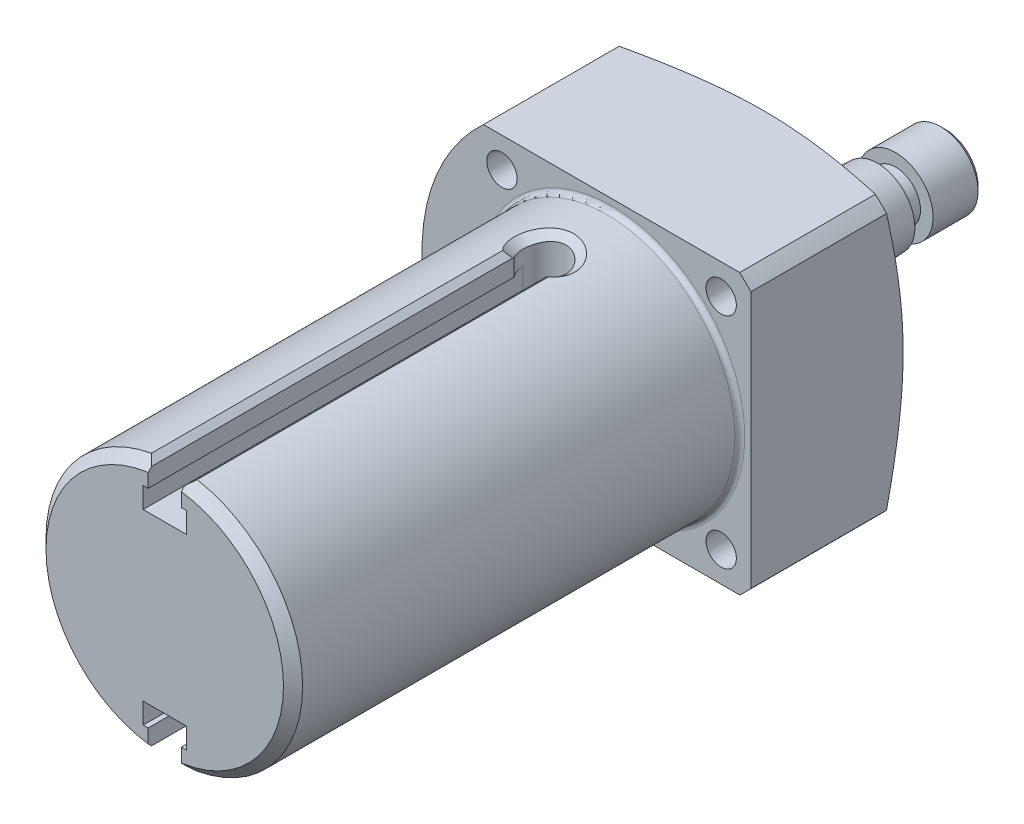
ISO-10303-21;
HEADER;
FILE_DESCRIPTION(('STEP AP214'),'2;1');
FILE_NAME('part.step','',(''),(''),'','','');
FILE_SCHEMA(('AUTOMOTIVE_DESIGN { 1 0 10303 214 1 1 1 1 }'));
ENDSEC;
DATA;
#1=APPLICATION_CONTEXT('core data for automotive mechanical design processes');
#2=APPLICATION_PROTOCOL_DEFINITION('international standard','automotive_design',2000,#1);
#3=PRODUCT_CONTEXT('',#1,'mechanical');
#4=PRODUCT('Part','Part','',(#3));
#5=PRODUCT_RELATED_PRODUCT_CATEGORY('part','',(#4));
#6=PRODUCT_DEFINITION_FORMATION('','',#4);
#7=PRODUCT_DEFINITION_CONTEXT('part definition',#1,'design');
#8=PRODUCT_DEFINITION('design','',#6,#7);
#9=PRODUCT_DEFINITION_SHAPE('','',#8);
#10=(LENGTH_UNIT() NAMED_UNIT(*) SI_UNIT(.MILLI.,.METRE.));
#11=(NAMED_UNIT(*) PLANE_ANGLE_UNIT() SI_UNIT($,.RADIAN.));
#12=(NAMED_UNIT(*) SI_UNIT($,.STERADIAN.) SOLID_ANGLE_UNIT());
#13=UNCERTAINTY_MEASURE_WITH_UNIT(LENGTH_MEASURE(1.E-05),#10,'distance_accuracy_value','');
#14=(GEOMETRIC_REPRESENTATION_CONTEXT(3) GLOBAL_UNCERTAINTY_ASSIGNED_CONTEXT((#13)) GLOBAL_UNIT_ASSIGNED_CONTEXT((#10,
#11,#12)) REPRESENTATION_CONTEXT('',''));
#15=CARTESIAN_POINT('',(0.,0.,0.));
#16=DIRECTION('',(0.,0.,1.));
#17=DIRECTION('',(1.,0.,0.));
#18=AXIS2_PLACEMENT_3D('',#15,#16,#17);
#19=CARTESIAN_POINT('',(5.93725,0.,-14.1375812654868));
#20=DIRECTION('',(0.,0.,1.));
#21=DIRECTION('',(1.,0.,0.));
#22=AXIS2_PLACEMENT_3D('',#19,#20,#21);
#23=PLANE('',#22);
#24=CARTESIAN_POINT('',(0.,0.,-14.1375812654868));
#25=DIRECTION('',(0.,0.,-1.));
#26=DIRECTION('',(-1.,0.,0.));
#27=AXIS2_PLACEMENT_3D('',#24,#25,#26);
#28=CIRCLE('',#27,5.93725);
#29=CARTESIAN_POINT('',(-5.93725,0.,-14.1375812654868));
#30=VERTEX_POINT('',#29);
#31=EDGE_CURVE('E732',#30,#30,#28,.T.);
#32=ORIENTED_EDGE('',*,*,#31,.T.);
#33=EDGE_LOOP('',(#32));
#34=FACE_BOUND('',#33,.T.);
#35=CARTESIAN_POINT('',(0.,0.,-14.1375812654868));
#36=DIRECTION('',(0.,0.,1.));
#37=DIRECTION('',(1.,0.,0.));
#38=AXIS2_PLACEMENT_3D('',#35,#36,#37);
#39=CIRCLE('',#38,3.9624);
#40=CARTESIAN_POINT('',(3.9624,0.,-14.1375812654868));
#41=VERTEX_POINT('',#40);
#42=EDGE_CURVE('E1393',#41,#41,#39,.F.);
#43=ORIENTED_EDGE('',*,*,#42,.F.);
#44=EDGE_LOOP('',(#43));
#45=FACE_BOUND('',#44,.T.);
#46=ADVANCED_FACE('F37',(#34,#45),#23,.F.);
#47=CARTESIAN_POINT('',(0.,0.,0.));
#48=DIRECTION('',(0.,0.,1.));
#49=DIRECTION('',(1.,0.,0.));
#50=AXIS2_PLACEMENT_3D('',#47,#48,#49);
#51=PLANE('',#50);
#52=CARTESIAN_POINT('',(0.,0.,0.));
#53=DIRECTION('',(0.,0.,-1.));
#54=DIRECTION('',(-1.,0.,0.));
#55=AXIS2_PLACEMENT_3D('',#52,#53,#54);
#56=CIRCLE('',#55,10.16);
#57=CARTESIAN_POINT('',(-10.16,0.,0.));
#58=VERTEX_POINT('',#57);
#59=EDGE_CURVE('E738',#58,#58,#56,.T.);
#60=ORIENTED_EDGE('',*,*,#59,.T.);
#61=EDGE_LOOP('',(#60));
#62=FACE_BOUND('',#61,.T.);
#63=CARTESIAN_POINT('',(0.,0.,0.));
#64=DIRECTION('',(0.,0.,1.));
#65=DIRECTION('',(1.,0.,0.));
#66=AXIS2_PLACEMENT_3D('',#63,#64,#65);
#67=CIRCLE('',#66,6.34365);
#68=CARTESIAN_POINT('',(6.34365,0.,0.));
#69=VERTEX_POINT('',#68);
#70=EDGE_CURVE('E675',#69,#69,#67,.F.);
#71=ORIENTED_EDGE('',*,*,#70,.F.);
#72=EDGE_LOOP('',(#71));
#73=FACE_BOUND('',#72,.T.);
#74=ADVANCED_FACE('F598',(#62,#73),#51,.F.);
#75=CARTESIAN_POINT('',(0.,0.,99.314));
#76=DIRECTION('',(0.,0.,-1.));
#77=DIRECTION('',(-1.,0.,0.));
#78=AXIS2_PLACEMENT_3D('',#75,#76,#77);
#79=CYLINDRICAL_SURFACE('',#78,30.1625);
#80=CARTESIAN_POINT('',(-28.8350167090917,-8.84975805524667,20.2692));
#81=CARTESIAN_POINT('',(-28.835015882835,-8.84976844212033,20.5019833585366));
#82=CARTESIAN_POINT('',(-28.8292350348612,-8.86866463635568,20.7349070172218));
#83=CARTESIAN_POINT('',(-28.8060611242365,-8.94364182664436,21.1942570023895));
#84=CARTESIAN_POINT('',(-28.7886563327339,-8.99976038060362,21.4206765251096));
#85=CARTESIAN_POINT('',(-28.7421486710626,-9.14719806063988,21.8603019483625));
#86=CARTESIAN_POINT('',(-28.7130542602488,-9.23849172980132,22.0735172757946));
#87=CARTESIAN_POINT('',(-28.6430822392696,-9.45319708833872,22.48093928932));
#88=CARTESIAN_POINT('',(-28.602206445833,-9.57660382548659,22.6751488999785));
#89=CARTESIAN_POINT('',(-28.5083850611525,-9.85239416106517,23.0404029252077));
#90=CARTESIAN_POINT('',(-28.4553675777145,-10.0049494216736,23.2112992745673));
#91=CARTESIAN_POINT('',(-28.3376227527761,-10.3337298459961,23.523794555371));
#92=CARTESIAN_POINT('',(-28.2728947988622,-10.5099562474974,23.6653919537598));
#93=CARTESIAN_POINT('',(-28.132030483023,-10.8813978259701,23.9158091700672));
#94=CARTESIAN_POINT('',(-28.0558489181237,-11.0766871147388,24.0244937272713));
#95=CARTESIAN_POINT('',(-27.8933854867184,-11.4796599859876,24.2051329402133));
#96=CARTESIAN_POINT('',(-27.8071040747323,-11.6873430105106,24.2770892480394));
#97=CARTESIAN_POINT('',(-27.6267541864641,-12.1074670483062,24.3817835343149));
#98=CARTESIAN_POINT('',(-27.5327388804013,-12.3198692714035,24.4147686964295));
#99=CARTESIAN_POINT('',(-27.3388037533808,-12.7444367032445,24.4413511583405));
#100=CARTESIAN_POINT('',(-27.2388842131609,-12.9566019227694,24.4349503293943));
#101=CARTESIAN_POINT('',(-27.0367800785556,-13.3731890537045,24.3831390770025));
#102=CARTESIAN_POINT('',(-26.9346155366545,-13.577653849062,24.3379945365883));
#103=CARTESIAN_POINT('',(-26.7307118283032,-13.9748099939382,24.2103938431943));
#104=CARTESIAN_POINT('',(-26.6289726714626,-14.1675010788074,24.1279368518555));
#105=CARTESIAN_POINT('',(-26.4292269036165,-14.536733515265,23.927774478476));
#106=CARTESIAN_POINT('',(-26.3312334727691,-14.7132204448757,23.8099556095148));
#107=CARTESIAN_POINT('',(-26.1430875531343,-15.0449928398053,23.5424966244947));
#108=CARTESIAN_POINT('',(-26.0529355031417,-15.2002771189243,23.3928547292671));
#109=CARTESIAN_POINT('',(-25.8834410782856,-15.4871537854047,23.0645122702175));
#110=CARTESIAN_POINT('',(-25.8041951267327,-15.6185377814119,22.8855797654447));
#111=CARTESIAN_POINT('',(-25.6608829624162,-15.8528994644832,22.5045276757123));
#112=CARTESIAN_POINT('',(-25.5968168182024,-15.9558770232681,22.3024079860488));
#113=CARTESIAN_POINT('',(-25.4867921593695,-16.1310442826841,21.8804969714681));
#114=CARTESIAN_POINT('',(-25.4408443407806,-16.2032157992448,21.6606953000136));
#115=CARTESIAN_POINT('',(-25.3693429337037,-16.3149405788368,21.2097777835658));
#116=CARTESIAN_POINT('',(-25.3437881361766,-16.3544957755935,20.9786626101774));
#117=CARTESIAN_POINT('',(-25.3144715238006,-16.3998375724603,20.5137140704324));
#118=CARTESIAN_POINT('',(-25.3105321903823,-16.4058992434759,20.2799186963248));
#119=CARTESIAN_POINT('',(-25.3241660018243,-16.3848458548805,19.8144643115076));
#120=CARTESIAN_POINT('',(-25.3417385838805,-16.357731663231,19.5828052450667));
#121=CARTESIAN_POINT('',(-25.3974032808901,-16.2711682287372,19.1291877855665));
#122=CARTESIAN_POINT('',(-25.4354093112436,-16.21185462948,18.9071928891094));
#123=CARTESIAN_POINT('',(-25.5300606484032,-16.0623842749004,18.4780588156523));
#124=CARTESIAN_POINT('',(-25.5867067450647,-15.9722262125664,18.2709202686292));
#125=CARTESIAN_POINT('',(-25.7164483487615,-15.7624851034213,17.8759182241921));
#126=CARTESIAN_POINT('',(-25.7896470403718,-15.6427170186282,17.6881868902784));
#127=CARTESIAN_POINT('',(-25.9490469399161,-15.376844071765,17.3386818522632));
#128=CARTESIAN_POINT('',(-26.0352487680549,-15.2307379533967,17.1769093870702));
#129=CARTESIAN_POINT('',(-26.2176834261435,-14.914522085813,16.8827621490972));
#130=CARTESIAN_POINT('',(-26.3139823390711,-14.7442512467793,16.7506014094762));
#131=CARTESIAN_POINT('',(-26.5122403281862,-14.3847003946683,16.5209152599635));
#132=CARTESIAN_POINT('',(-26.6141992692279,-14.1954208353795,16.4233890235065));
#133=CARTESIAN_POINT('',(-26.8196107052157,-13.8033930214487,16.2660880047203));
#134=CARTESIAN_POINT('',(-26.923057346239,-13.6006900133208,16.2061928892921));
#135=CARTESIAN_POINT('',(-27.1281815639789,-13.1867920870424,16.125463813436));
#136=CARTESIAN_POINT('',(-27.2298592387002,-12.9755976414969,16.1046276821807));
#137=CARTESIAN_POINT('',(-27.4274558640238,-12.5524954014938,16.1026548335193));
#138=CARTESIAN_POINT('',(-27.5234156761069,-12.3406081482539,16.1211893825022));
#139=CARTESIAN_POINT('',(-27.7079489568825,-11.9205127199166,16.1967313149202));
#140=CARTESIAN_POINT('',(-27.7965224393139,-11.7123045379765,16.2537386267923));
#141=CARTESIAN_POINT('',(-27.9643241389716,-11.3058103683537,16.404497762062));
#142=CARTESIAN_POINT('',(-28.0435572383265,-11.1075192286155,16.4982302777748));
#143=CARTESIAN_POINT('',(-28.1914423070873,-10.7266386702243,16.7197447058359));
#144=CARTESIAN_POINT('',(-28.260094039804,-10.5440496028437,16.8475273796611));
#145=CARTESIAN_POINT('',(-28.386564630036,-10.1987006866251,17.1347177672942));
#146=CARTESIAN_POINT('',(-28.444292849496,-10.0361103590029,17.294369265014));
#147=CARTESIAN_POINT('',(-28.5478938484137,-9.73751552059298,17.6402541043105));
#148=CARTESIAN_POINT('',(-28.5937638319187,-9.60151728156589,17.8264936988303));
#149=CARTESIAN_POINT('',(-28.6737467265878,-9.3599663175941,18.221292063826));
#150=CARTESIAN_POINT('',(-28.7078030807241,-9.25456043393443,18.4299521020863));
#151=CARTESIAN_POINT('',(-28.7639011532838,-9.07871088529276,18.8628531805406));
#152=CARTESIAN_POINT('',(-28.7859556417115,-9.00823006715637,19.0870773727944));
#153=CARTESIAN_POINT('',(-28.8130676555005,-8.92103372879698,19.4718563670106));
#154=CARTESIAN_POINT('',(-28.8212990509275,-8.89435093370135,19.6300081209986));
#155=CARTESIAN_POINT('',(-28.8322738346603,-8.85870960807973,19.9484843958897));
#156=CARTESIAN_POINT('',(-28.8350172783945,-8.84975089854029,20.1088088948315));
#157=CARTESIAN_POINT('',(-28.8350167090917,-8.84975805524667,20.2692));
#158=B_SPLINE_CURVE_WITH_KNOTS('',3,(#80,#81,#82,#83,#84,#85,#86,#87,#88,#89,#90,#91,#92,#93,
#94,#95,#96,#97,#98,#99,#100,#101,#102,#103,#104,#105,#106,#107,#108,#109,#110,#111,#112,#113,
#114,#115,#116,#117,#118,#119,#120,#121,#122,#123,#124,#125,#126,#127,#128,#129,#130,#131,#132,
#133,#134,#135,#136,#137,#138,#139,#140,#141,#142,#143,#144,#145,#146,#147,#148,#149,#150,#151,
#152,#153,#154,#155,#156,#157),.UNSPECIFIED.,.T.,.F.,(4,2,2,2,2,2,2,2,2,2,2,2,2,2,2,2,2,2,2,2,2,
2,2,2,2,2,2,2,2,2,2,2,2,2,2,2,2,2,4),(0.,0.697763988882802,1.39623310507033,2.0941976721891,
2.79205466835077,3.49415577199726,4.19629360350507,4.90127900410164,5.60623269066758,
6.30669061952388,7.00711526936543,7.70277126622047,8.3984428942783,9.09637145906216,
9.79433905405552,10.4981277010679,11.2019195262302,11.9061262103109,12.6102911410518,
13.3086643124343,14.0070192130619,14.7024547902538,15.3979198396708,16.0978459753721,
16.797805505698,17.5026718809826,18.2075214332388,18.910105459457,19.612650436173,
20.3093524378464,21.0060531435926,21.7023880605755,22.3987385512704,23.1006354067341,
23.8026976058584,24.5080759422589,25.2127022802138,25.6934766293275,26.1742461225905),.UNSPECIFIED.);
#159=CARTESIAN_POINT('',(-28.8350167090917,-8.84975805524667,20.2692));
#160=VERTEX_POINT('',#159);
#161=EDGE_CURVE('E1377',#160,#160,#158,.T.);
#162=ORIENTED_EDGE('',*,*,#161,.T.);
#163=EDGE_LOOP('',(#162));
#164=FACE_BOUND('',#163,.T.);
#165=CARTESIAN_POINT('',(-28.8350167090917,8.84975805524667,20.2692));
#166=CARTESIAN_POINT('',(-28.835015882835,8.84976844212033,20.0364166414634));
#167=CARTESIAN_POINT('',(-28.8292350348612,8.86866463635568,19.8034929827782));
#168=CARTESIAN_POINT('',(-28.8060611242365,8.94364182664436,19.3441429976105));
#169=CARTESIAN_POINT('',(-28.7886563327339,8.99976038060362,19.1177234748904));
#170=CARTESIAN_POINT('',(-28.7421486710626,9.14719806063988,18.6780980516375));
#171=CARTESIAN_POINT('',(-28.7130542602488,9.23849172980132,18.4648827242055));
#172=CARTESIAN_POINT('',(-28.6430822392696,9.45319708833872,18.05746071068));
#173=CARTESIAN_POINT('',(-28.602206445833,9.57660382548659,17.8632511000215));
#174=CARTESIAN_POINT('',(-28.5083850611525,9.85239416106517,17.4979970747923));
#175=CARTESIAN_POINT('',(-28.4553675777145,10.0049494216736,17.3271007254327));
#176=CARTESIAN_POINT('',(-28.3376227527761,10.3337298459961,17.014605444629));
#177=CARTESIAN_POINT('',(-28.2728947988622,10.5099562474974,16.8730080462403));
#178=CARTESIAN_POINT('',(-28.132030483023,10.8813978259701,16.6225908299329));
#179=CARTESIAN_POINT('',(-28.0558489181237,11.0766871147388,16.5139062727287));
#180=CARTESIAN_POINT('',(-27.8933854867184,11.4796599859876,16.3332670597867));
#181=CARTESIAN_POINT('',(-27.8071040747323,11.6873430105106,16.2613107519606));
#182=CARTESIAN_POINT('',(-27.6267541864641,12.1074670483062,16.1566164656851));
#183=CARTESIAN_POINT('',(-27.5327388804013,12.3198692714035,16.1236313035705));
#184=CARTESIAN_POINT('',(-27.3388037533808,12.7444367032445,16.0970488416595));
#185=CARTESIAN_POINT('',(-27.2388842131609,12.9566019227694,16.1034496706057));
#186=CARTESIAN_POINT('',(-27.0367800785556,13.3731890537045,16.1552609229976));
#187=CARTESIAN_POINT('',(-26.9346155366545,13.577653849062,16.2004054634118));
#188=CARTESIAN_POINT('',(-26.7307118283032,13.9748099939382,16.3280061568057));
#189=CARTESIAN_POINT('',(-26.6289726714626,14.1675010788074,16.4104631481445));
#190=CARTESIAN_POINT('',(-26.4292269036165,14.536733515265,16.610625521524));
#191=CARTESIAN_POINT('',(-26.3312334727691,14.7132204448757,16.7284443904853));
#192=CARTESIAN_POINT('',(-26.1430875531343,15.0449928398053,16.9959033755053));
#193=CARTESIAN_POINT('',(-26.0529355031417,15.2002771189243,17.1455452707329));
#194=CARTESIAN_POINT('',(-25.8834410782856,15.4871537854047,17.4738877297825));
#195=CARTESIAN_POINT('',(-25.8041951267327,15.6185377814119,17.6528202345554));
#196=CARTESIAN_POINT('',(-25.6608829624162,15.8528994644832,18.0338723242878));
#197=CARTESIAN_POINT('',(-25.5968168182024,15.9558770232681,18.2359920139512));
#198=CARTESIAN_POINT('',(-25.4867921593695,16.1310442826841,18.6579030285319));
#199=CARTESIAN_POINT('',(-25.4408443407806,16.2032157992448,18.8777046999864));
#200=CARTESIAN_POINT('',(-25.3693429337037,16.3149405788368,19.3286222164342));
#201=CARTESIAN_POINT('',(-25.3437881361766,16.3544957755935,19.5597373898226));
#202=CARTESIAN_POINT('',(-25.3144715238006,16.3998375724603,20.0246859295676));
#203=CARTESIAN_POINT('',(-25.3105321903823,16.4058992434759,20.2584813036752));
#204=CARTESIAN_POINT('',(-25.3241660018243,16.3848458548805,20.7239356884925));
#205=CARTESIAN_POINT('',(-25.3417385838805,16.357731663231,20.9555947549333));
#206=CARTESIAN_POINT('',(-25.3974032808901,16.2711682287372,21.4092122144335));
#207=CARTESIAN_POINT('',(-25.4354093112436,16.21185462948,21.6312071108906));
#208=CARTESIAN_POINT('',(-25.5300606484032,16.0623842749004,22.0603411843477));
#209=CARTESIAN_POINT('',(-25.5867067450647,15.9722262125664,22.2674797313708));
#210=CARTESIAN_POINT('',(-25.7164483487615,15.7624851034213,22.662481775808));
#211=CARTESIAN_POINT('',(-25.7896470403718,15.6427170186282,22.8502131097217));
#212=CARTESIAN_POINT('',(-25.9490469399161,15.376844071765,23.1997181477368));
#213=CARTESIAN_POINT('',(-26.0352487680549,15.2307379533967,23.3614906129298));
#214=CARTESIAN_POINT('',(-26.2176834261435,14.914522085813,23.6556378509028));
#215=CARTESIAN_POINT('',(-26.3139823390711,14.7442512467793,23.7877985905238));
#216=CARTESIAN_POINT('',(-26.5122403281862,14.3847003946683,24.0174847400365));
#217=CARTESIAN_POINT('',(-26.6141992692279,14.1954208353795,24.1150109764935));
#218=CARTESIAN_POINT('',(-26.8196107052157,13.8033930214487,24.2723119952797));
#219=CARTESIAN_POINT('',(-26.923057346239,13.6006900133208,24.332207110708));
#220=CARTESIAN_POINT('',(-27.1281815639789,13.1867920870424,24.4129361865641));
#221=CARTESIAN_POINT('',(-27.2298592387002,12.9755976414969,24.4337723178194));
#222=CARTESIAN_POINT('',(-27.4274558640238,12.5524954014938,24.4357451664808));
#223=CARTESIAN_POINT('',(-27.5234156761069,12.3406081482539,24.4172106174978));
#224=CARTESIAN_POINT('',(-27.7079489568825,11.9205127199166,24.3416686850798));
#225=CARTESIAN_POINT('',(-27.7965224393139,11.7123045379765,24.2846613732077));
#226=CARTESIAN_POINT('',(-27.9643241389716,11.3058103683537,24.133902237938));
#227=CARTESIAN_POINT('',(-28.0435572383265,11.1075192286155,24.0401697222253));
#228=CARTESIAN_POINT('',(-28.1914423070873,10.7266386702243,23.8186552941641));
#229=CARTESIAN_POINT('',(-28.260094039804,10.5440496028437,23.6908726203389));
#230=CARTESIAN_POINT('',(-28.386564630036,10.1987006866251,23.4036822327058));
#231=CARTESIAN_POINT('',(-28.444292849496,10.0361103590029,23.2440307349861));
#232=CARTESIAN_POINT('',(-28.5478938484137,9.73751552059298,22.8981458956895));
#233=CARTESIAN_POINT('',(-28.5937638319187,9.60151728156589,22.7119063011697));
#234=CARTESIAN_POINT('',(-28.6737467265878,9.3599663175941,22.317107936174));
#235=CARTESIAN_POINT('',(-28.7078030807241,9.25456043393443,22.1084478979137));
#236=CARTESIAN_POINT('',(-28.7639011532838,9.07871088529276,21.6755468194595));
#237=CARTESIAN_POINT('',(-28.7859556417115,9.00823006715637,21.4513226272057));
#238=CARTESIAN_POINT('',(-28.8130676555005,8.92103372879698,21.0665436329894));
#239=CARTESIAN_POINT('',(-28.8212990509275,8.89435093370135,20.9083918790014));
#240=CARTESIAN_POINT('',(-28.8322738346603,8.85870960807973,20.5899156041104));
#241=CARTESIAN_POINT('',(-28.8350172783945,8.84975089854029,20.4295911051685));
#242=CARTESIAN_POINT('',(-28.8350167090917,8.84975805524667,20.2692));
#243=B_SPLINE_CURVE_WITH_KNOTS('',3,(#165,#166,#167,#168,#169,#170,#171,#172,#173,#174,#175,
#176,#177,#178,#179,#180,#181,#182,#183,#184,#185,#186,#187,#188,#189,#190,#191,#192,#193,#194,
#195,#196,#197,#198,#199,#200,#201,#202,#203,#204,#205,#206,#207,#208,#209,#210,#211,#212,#213,
#214,#215,#216,#217,#218,#219,#220,#221,#222,#223,#224,#225,#226,#227,#228,#229,#230,#231,#232,
#233,#234,#235,#236,#237,#238,#239,#240,#241,#242),.UNSPECIFIED.,.T.,.F.,(4,2,2,2,2,2,2,2,2,2,2,
2,2,2,2,2,2,2,2,2,2,2,2,2,2,2,2,2,2,2,2,2,2,2,2,2,2,2,4),(0.,0.697763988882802,1.39623310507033,
2.0941976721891,2.79205466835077,3.49415577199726,4.19629360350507,4.90127900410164,
5.60623269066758,6.30669061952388,7.00711526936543,7.70277126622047,8.3984428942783,
9.09637145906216,9.79433905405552,10.4981277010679,11.2019195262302,11.9061262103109,
12.6102911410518,13.3086643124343,14.0070192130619,14.7024547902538,15.3979198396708,
16.0978459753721,16.797805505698,17.5026718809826,18.2075214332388,18.910105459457,
19.612650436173,20.3093524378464,21.0060531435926,21.7023880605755,22.3987385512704,
23.1006354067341,23.8026976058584,24.5080759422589,25.2127022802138,25.6934766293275,
26.1742461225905),.UNSPECIFIED.);
#244=CARTESIAN_POINT('',(-28.8350167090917,8.84975805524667,20.2692));
#245=VERTEX_POINT('',#244);
#246=EDGE_CURVE('E1384',#245,#245,#243,.T.);
#247=ORIENTED_EDGE('',*,*,#246,.T.);
#248=EDGE_LOOP('',(#247));
#249=FACE_BOUND('',#248,.T.);
#250=DIRECTION('',(0.,0.,-1.));
#251=VECTOR('',#250,1.);
#252=CARTESIAN_POINT('',(-20.3918067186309,22.225,99.314));
#253=LINE('',#252,#251);
#254=CARTESIAN_POINT('',(-20.3918067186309,22.225,28.194));
#255=VERTEX_POINT('',#254);
#256=CARTESIAN_POINT('',(-20.3918067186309,22.225,6.604));
#257=VERTEX_POINT('',#256);
#258=EDGE_CURVE('E762',#255,#257,#253,.T.);
#259=ORIENTED_EDGE('',*,*,#258,.T.);
#260=CARTESIAN_POINT('',(0.,0.,6.604));
#261=DIRECTION('',(0.,0.,-1.));
#262=DIRECTION('',(-1.,0.,0.));
#263=AXIS2_PLACEMENT_3D('',#260,#261,#262);
#264=CIRCLE('',#263,30.1625);
#265=CARTESIAN_POINT('',(-20.3918067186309,-22.225,6.604));
#266=VERTEX_POINT('',#265);
#267=EDGE_CURVE('E618',#266,#257,#264,.T.);
#268=ORIENTED_EDGE('',*,*,#267,.F.);
#269=DIRECTION('',(0.,0.,-1.));
#270=VECTOR('',#269,1.);
#271=CARTESIAN_POINT('',(-20.3918067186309,-22.225,99.314));
#272=LINE('',#271,#270);
#273=CARTESIAN_POINT('',(-20.3918067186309,-22.225,28.194));
#274=VERTEX_POINT('',#273);
#275=EDGE_CURVE('E683',#274,#266,#272,.T.);
#276=ORIENTED_EDGE('',*,*,#275,.F.);
#277=CARTESIAN_POINT('',(0.,0.,28.194));
#278=DIRECTION('',(0.,0.,-1.));
#279=DIRECTION('',(-1.,0.,0.));
#280=AXIS2_PLACEMENT_3D('',#277,#278,#279);
#281=CIRCLE('',#280,30.1625);
#282=EDGE_CURVE('E775',#274,#255,#281,.T.);
#283=ORIENTED_EDGE('',*,*,#282,.T.);
#284=EDGE_LOOP('',(#259,#268,#276,#283));
#285=FACE_BOUND('',#284,.T.);
#286=ADVANCED_FACE('F423',(#164,#249,#285),#79,.T.);
#287=CARTESIAN_POINT('',(-20.3918067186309,-22.225,99.314));
#288=DIRECTION('',(0.,1.,0.));
#289=DIRECTION('',(0.,0.,1.));
#290=AXIS2_PLACEMENT_3D('',#287,#288,#289);
#291=PLANE('',#290);
#292=ORIENTED_EDGE('',*,*,#275,.T.);
#293=CARTESIAN_POINT('',(-41.5520210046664,-22.225,12.2034607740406));
#294=CARTESIAN_POINT('',(-40.9991126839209,-22.225,12.0424945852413));
#295=CARTESIAN_POINT('',(-40.4460139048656,-22.225,11.8821828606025));
#296=CARTESIAN_POINT('',(-39.3393958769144,-22.225,11.5630125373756));
#297=CARTESIAN_POINT('',(-38.7858766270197,-22.225,11.4041539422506));
#298=CARTESIAN_POINT('',(-37.124601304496,-22.225,10.9299663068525));
#299=CARTESIAN_POINT('',(-36.0161590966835,-22.225,10.6170345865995));
#300=CARTESIAN_POINT('',(-33.7971197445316,-22.225,9.9990315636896));
#301=CARTESIAN_POINT('',(-32.6865226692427,-22.225,9.69396001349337));
#302=CARTESIAN_POINT('',(-30.4626963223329,-22.225,9.09356377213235));
#303=CARTESIAN_POINT('',(-29.3494670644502,-22.225,8.79823903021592));
#304=CARTESIAN_POINT('',(-27.1307266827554,-22.225,8.22263292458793));
#305=CARTESIAN_POINT('',(-26.0252464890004,-22.225,7.94223272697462));
#306=CARTESIAN_POINT('',(-23.8105421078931,-22.225,7.39654616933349));
#307=CARTESIAN_POINT('',(-22.701317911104,-22.225,7.13125984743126));
#308=CARTESIAN_POINT('',(-20.4776072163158,-22.225,6.61969456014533));
#309=CARTESIAN_POINT('',(-19.3631174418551,-22.225,6.37342975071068));
#310=CARTESIAN_POINT('',(-17.1289462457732,-22.225,5.9053832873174));
#311=CARTESIAN_POINT('',(-16.0092647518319,-22.225,5.68360197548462));
#312=CARTESIAN_POINT('',(-13.7418214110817,-22.225,5.26698903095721));
#313=CARTESIAN_POINT('',(-12.5939438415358,-22.225,5.07278080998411));
#314=CARTESIAN_POINT('',(-10.2919325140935,-22.225,4.72489681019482));
#315=CARTESIAN_POINT('',(-9.13779885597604,-22.225,4.57122038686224));
#316=CARTESIAN_POINT('',(-7.40353857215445,-22.225,4.37770033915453));
#317=CARTESIAN_POINT('',(-6.82544782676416,-22.225,4.3193942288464));
#318=CARTESIAN_POINT('',(-5.66809259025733,-22.225,4.21600322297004));
#319=CARTESIAN_POINT('',(-5.08882814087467,-22.225,4.17091786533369));
#320=CARTESIAN_POINT('',(-3.92938843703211,-22.225,4.09480505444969));
#321=CARTESIAN_POINT('',(-3.34921320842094,-22.225,4.06377720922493));
#322=CARTESIAN_POINT('',(-2.18826012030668,-22.225,4.01639368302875));
#323=CARTESIAN_POINT('',(-1.60748226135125,-22.225,4.00003798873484));
#324=CARTESIAN_POINT('',(-0.441990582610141,-22.225,3.98228314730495));
#325=CARTESIAN_POINT('',(0.142724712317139,-22.225,3.98098007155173));
#326=CARTESIAN_POINT('',(1.31198993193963,-22.225,3.99360715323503));
#327=CARTESIAN_POINT('',(1.89653985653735,-22.225,4.00753731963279));
#328=CARTESIAN_POINT('',(3.06510616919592,-22.225,4.05033641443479));
#329=CARTESIAN_POINT('',(3.64912254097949,-22.225,4.07920578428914));
#330=CARTESIAN_POINT('',(4.8162643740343,-22.225,4.15129666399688));
#331=CARTESIAN_POINT('',(5.39938983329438,-22.225,4.19451820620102));
#332=CARTESIAN_POINT('',(6.56555491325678,-22.225,4.29458538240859));
#333=CARTESIAN_POINT('',(7.14859236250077,-22.225,4.35145617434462));
#334=CARTESIAN_POINT('',(8.31330320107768,-22.225,4.47779194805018));
#335=CARTESIAN_POINT('',(8.89497656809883,-22.225,4.54725713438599));
#336=CARTESIAN_POINT('',(10.0568156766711,-22.225,4.69770156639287));
#337=CARTESIAN_POINT('',(10.6369814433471,-22.225,4.77868061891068));
#338=CARTESIAN_POINT('',(11.7957555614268,-22.225,4.95105103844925));
#339=CARTESIAN_POINT('',(12.3743639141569,-22.225,5.04244239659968));
#340=CARTESIAN_POINT('',(13.7445797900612,-22.225,5.2702231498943));
#341=CARTESIAN_POINT('',(14.5355043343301,-22.225,5.41072071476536));
#342=CARTESIAN_POINT('',(16.1145633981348,-22.225,5.70666865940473));
#343=CARTESIAN_POINT('',(16.9026978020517,-22.225,5.86211965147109));
#344=CARTESIAN_POINT('',(18.476489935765,-22.225,6.18570171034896));
#345=CARTESIAN_POINT('',(19.2621472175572,-22.225,6.35383494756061));
#346=CARTESIAN_POINT('',(20.8310817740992,-22.225,6.70077888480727));
#347=CARTESIAN_POINT('',(21.6143590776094,-22.225,6.87958945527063));
#348=CARTESIAN_POINT('',(23.1793187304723,-22.225,7.24634349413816));
#349=CARTESIAN_POINT('',(23.9609996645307,-22.225,7.43429298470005));
#350=CARTESIAN_POINT('',(25.5224860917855,-22.225,7.81781800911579));
#351=CARTESIAN_POINT('',(26.3022915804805,-22.225,8.01339356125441));
#352=CARTESIAN_POINT('',(27.8601803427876,-22.225,8.41099246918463));
#353=CARTESIAN_POINT('',(28.6382637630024,-22.225,8.61301525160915));
#354=CARTESIAN_POINT('',(30.1929826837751,-22.225,9.02256518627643));
#355=CARTESIAN_POINT('',(30.9696181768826,-22.225,9.23009236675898));
#356=CARTESIAN_POINT('',(32.5232130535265,-22.225,9.65028401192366));
#357=CARTESIAN_POINT('',(33.3001698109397,-22.225,9.86295817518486));
#358=CARTESIAN_POINT('',(34.8529605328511,-22.225,10.2923696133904));
#359=CARTESIAN_POINT('',(35.6287944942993,-22.225,10.5091068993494));
#360=CARTESIAN_POINT('',(37.9548373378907,-22.225,11.1645601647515));
#361=CARTESIAN_POINT('',(39.5035709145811,-22.225,11.6085131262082));
#362=CARTESIAN_POINT('',(42.5973408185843,-22.225,12.5067625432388));
#363=CARTESIAN_POINT('',(44.1423783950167,-22.225,12.9610547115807));
#364=CARTESIAN_POINT('',(47.2300315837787,-22.225,13.8777559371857));
#365=CARTESIAN_POINT('',(48.7726472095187,-22.225,14.3401649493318));
#366=CARTESIAN_POINT('',(51.832137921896,-22.225,15.2641554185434));
#367=CARTESIAN_POINT('',(53.3490425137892,-22.225,15.7256393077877));
#368=CARTESIAN_POINT('',(56.3813427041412,-22.225,16.653540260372));
#369=CARTESIAN_POINT('',(57.8967383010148,-22.225,17.1199573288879));
#370=CARTESIAN_POINT('',(60.9264806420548,-22.225,18.0568457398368));
#371=CARTESIAN_POINT('',(62.4408272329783,-22.225,18.5273175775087));
#372=CARTESIAN_POINT('',(65.4684978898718,-22.225,19.4715404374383));
#373=CARTESIAN_POINT('',(66.9818219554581,-22.225,19.9452914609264));
#374=CARTESIAN_POINT('',(70.0000201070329,-22.225,20.8931279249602));
#375=CARTESIAN_POINT('',(71.5048984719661,-22.225,21.3671997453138));
#376=CARTESIAN_POINT('',(74.5139419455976,-22.225,22.3176023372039));
#377=CARTESIAN_POINT('',(76.0181070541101,-22.225,22.7939331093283));
#378=CARTESIAN_POINT('',(79.0256214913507,-22.225,23.7484368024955));
#379=CARTESIAN_POINT('',(80.5289709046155,-22.225,24.2266094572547));
#380=CARTESIAN_POINT('',(83.5351462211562,-22.225,25.1845932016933));
#381=CARTESIAN_POINT('',(85.0379721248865,-22.225,25.6644042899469));
#382=CARTESIAN_POINT('',(86.5405787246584,-22.225,26.1449001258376));
#383=B_SPLINE_CURVE_WITH_KNOTS('',3,(#293,#294,#295,#296,#297,#298,#299,#300,#301,#302,#303,
#304,#305,#306,#307,#308,#309,#310,#311,#312,#313,#314,#315,#316,#317,#318,#319,#320,#321,#322,
#323,#324,#325,#326,#327,#328,#329,#330,#331,#332,#333,#334,#335,#336,#337,#338,#339,#340,#341,
#342,#343,#344,#345,#346,#347,#348,#349,#350,#351,#352,#353,#354,#355,#356,#357,#358,#359,#360,
#361,#362,#363,#364,#365,#366,#367,#368,#369,#370,#371,#372,#373,#374,#375,#376,#377,#378,#379,
#380,#381,#382),.UNSPECIFIED.,.F.,.F.,(4,2,2,2,2,2,2,2,2,2,2,2,2,2,2,2,2,2,2,2,2,2,2,2,2,2,2,2,
2,2,2,2,2,2,2,2,2,2,2,2,2,2,2,2,4),(0.,1.72758701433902,3.45517814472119,6.91045864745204,
10.3656302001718,13.8207837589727,17.2421619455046,20.6635487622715,24.0874577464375,
27.511414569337,31.0034397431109,34.4954093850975,36.2383538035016,37.9812372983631,
39.7240721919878,41.4669055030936,43.2208561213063,44.9748077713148,46.728811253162,
48.4828186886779,50.2400842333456,51.9973783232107,53.7546429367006,55.5119060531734,
57.9216449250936,60.3314825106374,62.7417334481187,65.1519551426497,67.5637871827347,
69.9756250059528,72.3872489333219,74.7988852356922,77.215487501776,79.6320963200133,
84.4653645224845,89.2966638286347,94.1279362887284,98.884574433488,103.641217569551,
108.398450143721,113.155684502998,117.889035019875,122.622386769,127.355078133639,
132.087765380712),.UNSPECIFIED.);
#384=CARTESIAN_POINT('',(20.3918067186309,-22.225,6.604));
#385=VERTEX_POINT('',#384);
#386=EDGE_CURVE('E625',#266,#385,#383,.T.);
#387=ORIENTED_EDGE('',*,*,#386,.T.);
#388=DIRECTION('',(0.,0.,-1.));
#389=VECTOR('',#388,1.);
#390=CARTESIAN_POINT('',(20.3918067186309,-22.225,99.314));
#391=LINE('',#390,#389);
#392=CARTESIAN_POINT('',(20.3918067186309,-22.225,28.194));
#393=VERTEX_POINT('',#392);
#394=EDGE_CURVE('E760',#393,#385,#391,.T.);
#395=ORIENTED_EDGE('',*,*,#394,.F.);
#396=DIRECTION('',(-1.,0.,0.));
#397=VECTOR('',#396,1.);
#398=CARTESIAN_POINT('',(-20.3918067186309,-22.225,28.194));
#399=LINE('',#398,#397);
#400=EDGE_CURVE('E771',#393,#274,#399,.T.);
#401=ORIENTED_EDGE('',*,*,#400,.T.);
#402=EDGE_LOOP('',(#292,#387,#395,#401));
#403=FACE_BOUND('',#402,.T.);
#404=ADVANCED_FACE('F637',(#403),#291,.F.);
#405=CARTESIAN_POINT('',(0.,0.,99.314));
#406=DIRECTION('',(0.,0.,-1.));
#407=DIRECTION('',(-1.,0.,0.));
#408=AXIS2_PLACEMENT_3D('',#405,#406,#407);
#409=CYLINDRICAL_SURFACE('',#408,30.1625);
#410=ORIENTED_EDGE('',*,*,#394,.T.);
#411=CARTESIAN_POINT('',(22.1742,-20.4470354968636,6.604));
#412=VERTEX_POINT('',#411);
#413=EDGE_CURVE('E741',#412,#385,#264,.T.);
#414=ORIENTED_EDGE('',*,*,#413,.F.);
#415=DIRECTION('',(0.,0.,-1.));
#416=VECTOR('',#415,1.);
#417=CARTESIAN_POINT('',(22.1742,-20.4470354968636,99.314));
#418=LINE('',#417,#416);
#419=CARTESIAN_POINT('',(22.1742,-20.4470354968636,28.194));
#420=VERTEX_POINT('',#419);
#421=EDGE_CURVE('E755',#420,#412,#418,.T.);
#422=ORIENTED_EDGE('',*,*,#421,.F.);
#423=EDGE_CURVE('E780',#420,#393,#281,.T.);
#424=ORIENTED_EDGE('',*,*,#423,.T.);
#425=EDGE_LOOP('',(#410,#414,#422,#424));
#426=FACE_BOUND('',#425,.T.);
#427=ADVANCED_FACE('F634',(#426),#409,.T.);
#428=CARTESIAN_POINT('',(22.1742,20.4470354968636,99.314));
#429=DIRECTION('',(-1.,0.,0.));
#430=DIRECTION('',(0.,0.,1.));
#431=AXIS2_PLACEMENT_3D('',#428,#429,#430);
#432=PLANE('',#431);
#433=ORIENTED_EDGE('',*,*,#421,.T.);
#434=CARTESIAN_POINT('',(22.1742,-41.5713598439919,12.2011906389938));
#435=CARTESIAN_POINT('',(22.1742,-41.0188942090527,12.0402549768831));
#436=CARTESIAN_POINT('',(22.1742,-40.4662391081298,11.8799699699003));
#437=CARTESIAN_POINT('',(22.1742,-39.3605106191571,11.5608446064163));
#438=CARTESIAN_POINT('',(22.1742,-38.8074372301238,11.4020042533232));
#439=CARTESIAN_POINT('',(22.1742,-37.1475033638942,10.9278574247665));
#440=CARTESIAN_POINT('',(22.1742,-36.0399602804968,10.614934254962));
#441=CARTESIAN_POINT('',(22.1742,-33.822749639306,9.99690782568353));
#442=CARTESIAN_POINT('',(22.1742,-32.7130821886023,9.69180418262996));
#443=CARTESIAN_POINT('',(22.1742,-30.491127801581,9.09128654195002));
#444=CARTESIAN_POINT('',(22.1742,-29.3788408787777,8.79587249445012));
#445=CARTESIAN_POINT('',(22.1742,-27.1619364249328,8.2200040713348));
#446=CARTESIAN_POINT('',(22.1742,-26.0573495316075,7.93943213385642));
#447=CARTESIAN_POINT('',(22.1742,-23.8444467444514,7.39331795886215));
#448=CARTESIAN_POINT('',(22.1742,-22.7361308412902,7.12777575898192));
#449=CARTESIAN_POINT('',(22.1742,-20.5142403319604,6.61559348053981));
#450=CARTESIAN_POINT('',(22.1742,-19.4006624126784,6.36896768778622));
#451=CARTESIAN_POINT('',(22.1742,-17.1683271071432,5.90007873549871));
#452=CARTESIAN_POINT('',(22.1742,-16.0495696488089,5.67781591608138));
#453=CARTESIAN_POINT('',(22.1742,-13.7839947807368,5.26009359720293));
#454=CARTESIAN_POINT('',(22.1742,-12.6370617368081,5.06525489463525));
#455=CARTESIAN_POINT('',(22.1742,-10.3369308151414,4.71596815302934));
#456=CARTESIAN_POINT('',(22.1742,-9.18373303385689,4.56151949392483));
#457=CARTESIAN_POINT('',(22.1742,-7.45086262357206,4.36675658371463));
#458=CARTESIAN_POINT('',(22.1742,-6.8732362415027,4.30802277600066));
#459=CARTESIAN_POINT('',(22.1742,-5.71680075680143,4.20375437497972));
#460=CARTESIAN_POINT('',(22.1742,-5.13799169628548,4.15821931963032));
#461=CARTESIAN_POINT('',(22.1742,-3.97945204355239,4.08119346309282));
#462=CARTESIAN_POINT('',(22.1742,-3.39972147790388,4.0497022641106));
#463=CARTESIAN_POINT('',(22.1742,-2.23964558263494,4.00138829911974));
#464=CARTESIAN_POINT('',(22.1742,-1.65930025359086,3.98456551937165));
#465=CARTESIAN_POINT('',(22.1742,-0.49466137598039,3.96588022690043));
#466=CARTESIAN_POINT('',(22.1742,0.0896337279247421,3.96411389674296));
#467=CARTESIAN_POINT('',(22.1742,1.25807019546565,3.97583146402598));
#468=CARTESIAN_POINT('',(22.1742,1.84221155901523,3.98931536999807));
#469=CARTESIAN_POINT('',(22.1742,3.00997033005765,4.03124724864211));
#470=CARTESIAN_POINT('',(22.1742,3.59358772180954,4.05969565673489));
#471=CARTESIAN_POINT('',(22.1742,4.75993908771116,4.13097579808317));
#472=CARTESIAN_POINT('',(22.1742,5.34267305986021,4.17380756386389));
#473=CARTESIAN_POINT('',(22.1742,6.50806420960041,4.27312924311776));
#474=CARTESIAN_POINT('',(22.1742,7.0907192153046,4.32964449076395));
#475=CARTESIAN_POINT('',(22.1742,8.25466777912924,4.45530448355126));
#476=CARTESIAN_POINT('',(22.1742,8.83596131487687,4.52444943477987));
#477=CARTESIAN_POINT('',(22.1742,9.99704157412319,4.67428734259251));
#478=CARTESIAN_POINT('',(22.1742,10.5768283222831,4.75498010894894));
#479=CARTESIAN_POINT('',(22.1742,11.7348434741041,4.92680912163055));
#480=CARTESIAN_POINT('',(22.1742,12.3130718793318,5.01794535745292));
#481=CARTESIAN_POINT('',(22.1742,13.6849308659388,5.24557637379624));
#482=CARTESIAN_POINT('',(22.1742,14.4778683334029,5.38624817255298));
#483=CARTESIAN_POINT('',(22.1742,16.0609315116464,5.68267537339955));
#484=CARTESIAN_POINT('',(22.1742,16.8510571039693,5.83843140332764));
#485=CARTESIAN_POINT('',(22.1742,18.4288140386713,6.16272480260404));
#486=CARTESIAN_POINT('',(22.1742,19.2164449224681,6.33126439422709));
#487=CARTESIAN_POINT('',(22.1742,20.7893093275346,6.67909733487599));
#488=CARTESIAN_POINT('',(22.1742,21.5745428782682,6.85839055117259));
#489=CARTESIAN_POINT('',(22.1742,23.1434096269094,7.22616897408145));
#490=CARTESIAN_POINT('',(22.1742,23.9270413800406,7.41466032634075));
#491=CARTESIAN_POINT('',(22.1742,25.4924181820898,7.79931143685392));
#492=CARTESIAN_POINT('',(22.1742,26.2741632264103,7.99547121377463));
#493=CARTESIAN_POINT('',(22.1742,27.8359209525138,8.39426929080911));
#494=CARTESIAN_POINT('',(22.1742,28.6159337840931,8.59690700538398));
#495=CARTESIAN_POINT('',(22.1742,30.1745047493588,9.00770938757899));
#496=CARTESIAN_POINT('',(22.1742,30.9530628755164,9.21587408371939));
#497=CARTESIAN_POINT('',(22.1742,32.5105288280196,9.63736564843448));
#498=CARTESIAN_POINT('',(22.1742,33.2894339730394,9.85070241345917));
#499=CARTESIAN_POINT('',(22.1742,34.8461175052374,10.2814509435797));
#500=CARTESIAN_POINT('',(22.1742,35.6238958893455,10.4988627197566));
#501=CARTESIAN_POINT('',(22.1742,37.955768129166,11.1563518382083));
#502=CARTESIAN_POINT('',(22.1742,39.5083823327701,11.6016784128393));
#503=CARTESIAN_POINT('',(22.1742,42.6098972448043,12.5026860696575));
#504=CARTESIAN_POINT('',(22.1742,44.1587992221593,12.9583627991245));
#505=CARTESIAN_POINT('',(22.1742,47.2541785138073,13.8778374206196));
#506=CARTESIAN_POINT('',(22.1742,48.8006558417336,14.3416352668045));
#507=CARTESIAN_POINT('',(22.1742,51.8679555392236,15.2684250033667));
#508=CARTESIAN_POINT('',(22.1742,53.3888072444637,15.7313199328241));
#509=CARTESIAN_POINT('',(22.1742,56.4290019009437,16.6620401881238));
#510=CARTESIAN_POINT('',(22.1742,57.9483448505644,17.1298655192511));
#511=CARTESIAN_POINT('',(22.1742,60.9859860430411,18.0695671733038));
#512=CARTESIAN_POINT('',(22.1742,62.5042841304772,18.5414439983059));
#513=CARTESIAN_POINT('',(22.1742,65.5398589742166,19.488471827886));
#514=CARTESIAN_POINT('',(22.1742,67.0571357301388,19.9636228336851));
#515=CARTESIAN_POINT('',(22.1742,70.0831376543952,20.9142209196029));
#516=CARTESIAN_POINT('',(22.1742,71.5918671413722,21.3896542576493));
#517=CARTESIAN_POINT('',(22.1742,74.6086143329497,22.3427745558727));
#518=CARTESIAN_POINT('',(22.1742,76.1166320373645,22.8204615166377));
#519=CARTESIAN_POINT('',(22.1742,79.1318498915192,23.7776714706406));
#520=CARTESIAN_POINT('',(22.1742,80.6390501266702,24.2571941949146));
#521=CARTESIAN_POINT('',(22.1742,83.6529284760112,25.2178733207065));
#522=CARTESIAN_POINT('',(22.1742,85.1596065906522,25.69902972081));
#523=CARTESIAN_POINT('',(22.1742,86.6660660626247,26.180868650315));
#524=B_SPLINE_CURVE_WITH_KNOTS('',3,(#434,#435,#436,#437,#438,#439,#440,#441,#442,#443,#444,
#445,#446,#447,#448,#449,#450,#451,#452,#453,#454,#455,#456,#457,#458,#459,#460,#461,#462,#463,
#464,#465,#466,#467,#468,#469,#470,#471,#472,#473,#474,#475,#476,#477,#478,#479,#480,#481,#482,
#483,#484,#485,#486,#487,#488,#489,#490,#491,#492,#493,#494,#495,#496,#497,#498,#499,#500,#501,
#502,#503,#504,#505,#506,#507,#508,#509,#510,#511,#512,#513,#514,#515,#516,#517,#518,#519,#520,
#521,#522,#523),.UNSPECIFIED.,.F.,.F.,(4,2,2,2,2,2,2,2,2,2,2,2,2,2,2,2,2,2,2,2,2,2,2,2,2,2,2,2,
2,2,2,2,2,2,2,2,2,2,2,2,2,2,2,2,4),(0.,1.72628632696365,3.45257672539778,6.90525469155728,
10.3577629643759,13.8102534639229,17.2291617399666,20.6480785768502,24.0695524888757,
27.4910741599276,30.9806258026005,34.4701238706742,36.2118119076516,37.9534389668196,
39.6950166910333,41.4365927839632,43.1892860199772,44.9419802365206,46.6947254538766,
48.4474746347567,50.2034940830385,51.959542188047,53.7155613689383,55.4715787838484,
57.8873518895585,60.3032255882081,62.7195202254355,65.1357850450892,67.5536869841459,
69.9715948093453,72.3892846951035,74.8069870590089,77.2297518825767,79.6525232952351,
84.4981181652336,89.3417116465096,94.1852777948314,98.9544767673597,103.723680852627,
108.49348474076,113.263290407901,118.00888774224,122.754486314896,127.499414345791,
132.244338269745),.UNSPECIFIED.);
#525=CARTESIAN_POINT('',(22.1742,20.4470354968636,6.604));
#526=VERTEX_POINT('',#525);
#527=EDGE_CURVE('E616',#412,#526,#524,.T.);
#528=ORIENTED_EDGE('',*,*,#527,.T.);
#529=DIRECTION('',(0.,0.,-1.));
#530=VECTOR('',#529,1.);
#531=CARTESIAN_POINT('',(22.1742,20.4470354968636,99.314));
#532=LINE('',#531,#530);
#533=CARTESIAN_POINT('',(22.1742,20.4470354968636,28.194));
#534=VERTEX_POINT('',#533);
#535=EDGE_CURVE('E753',#534,#526,#532,.T.);
#536=ORIENTED_EDGE('',*,*,#535,.F.);
#537=DIRECTION('',(0.,-1.,0.));
#538=VECTOR('',#537,1.);
#539=CARTESIAN_POINT('',(22.1742,20.4470354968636,28.194));
#540=LINE('',#539,#538);
#541=EDGE_CURVE('E777',#534,#420,#540,.T.);
#542=ORIENTED_EDGE('',*,*,#541,.T.);
#543=EDGE_LOOP('',(#433,#528,#536,#542));
#544=FACE_BOUND('',#543,.T.);
#545=ADVANCED_FACE('F630',(#544),#432,.F.);
#546=CARTESIAN_POINT('',(0.,0.,99.314));
#547=DIRECTION('',(0.,0.,-1.));
#548=DIRECTION('',(-1.,0.,0.));
#549=AXIS2_PLACEMENT_3D('',#546,#547,#548);
#550=CYLINDRICAL_SURFACE('',#549,30.1625);
#551=ORIENTED_EDGE('',*,*,#535,.T.);
#552=CARTESIAN_POINT('',(20.3918067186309,22.225,6.604));
#553=VERTEX_POINT('',#552);
#554=EDGE_CURVE('E617',#553,#526,#264,.T.);
#555=ORIENTED_EDGE('',*,*,#554,.F.);
#556=DIRECTION('',(0.,0.,-1.));
#557=VECTOR('',#556,1.);
#558=CARTESIAN_POINT('',(20.3918067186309,22.225,99.314));
#559=LINE('',#558,#557);
#560=CARTESIAN_POINT('',(20.3918067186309,22.225,28.194));
#561=VERTEX_POINT('',#560);
#562=EDGE_CURVE('E758',#561,#553,#559,.T.);
#563=ORIENTED_EDGE('',*,*,#562,.F.);
#564=EDGE_CURVE('E757',#561,#534,#281,.T.);
#565=ORIENTED_EDGE('',*,*,#564,.T.);
#566=EDGE_LOOP('',(#551,#555,#563,#565));
#567=FACE_BOUND('',#566,.T.);
#568=ADVANCED_FACE('F605',(#567),#550,.T.);
#569=CARTESIAN_POINT('',(-20.3918067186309,22.225,99.314));
#570=DIRECTION('',(0.,-1.,0.));
#571=DIRECTION('',(0.,0.,-1.));
#572=AXIS2_PLACEMENT_3D('',#569,#570,#571);
#573=PLANE('',#572);
#574=ORIENTED_EDGE('',*,*,#562,.T.);
#575=CARTESIAN_POINT('',(-41.5520210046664,22.225,12.2034607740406));
#576=CARTESIAN_POINT('',(-40.9991126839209,22.225,12.0424945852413));
#577=CARTESIAN_POINT('',(-40.4460139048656,22.225,11.8821828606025));
#578=CARTESIAN_POINT('',(-39.3393958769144,22.225,11.5630125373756));
#579=CARTESIAN_POINT('',(-38.7858766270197,22.225,11.4041539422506));
#580=CARTESIAN_POINT('',(-37.124601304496,22.225,10.9299663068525));
#581=CARTESIAN_POINT('',(-36.0161590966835,22.225,10.6170345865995));
#582=CARTESIAN_POINT('',(-33.7971197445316,22.225,9.9990315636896));
#583=CARTESIAN_POINT('',(-32.6865226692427,22.225,9.69396001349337));
#584=CARTESIAN_POINT('',(-30.4626963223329,22.225,9.09356377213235));
#585=CARTESIAN_POINT('',(-29.3494670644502,22.225,8.79823903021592));
#586=CARTESIAN_POINT('',(-27.1307266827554,22.225,8.22263292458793));
#587=CARTESIAN_POINT('',(-26.0252464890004,22.225,7.94223272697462));
#588=CARTESIAN_POINT('',(-23.8105421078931,22.225,7.39654616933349));
#589=CARTESIAN_POINT('',(-22.701317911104,22.225,7.13125984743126));
#590=CARTESIAN_POINT('',(-20.4776072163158,22.225,6.61969456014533));
#591=CARTESIAN_POINT('',(-19.3631174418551,22.225,6.37342975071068));
#592=CARTESIAN_POINT('',(-17.1289462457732,22.225,5.9053832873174));
#593=CARTESIAN_POINT('',(-16.0092647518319,22.225,5.68360197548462));
#594=CARTESIAN_POINT('',(-13.7418214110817,22.225,5.26698903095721));
#595=CARTESIAN_POINT('',(-12.5939438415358,22.225,5.07278080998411));
#596=CARTESIAN_POINT('',(-10.2919325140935,22.225,4.72489681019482));
#597=CARTESIAN_POINT('',(-9.13779885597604,22.225,4.57122038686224));
#598=CARTESIAN_POINT('',(-7.40353857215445,22.225,4.37770033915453));
#599=CARTESIAN_POINT('',(-6.82544782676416,22.225,4.3193942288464));
#600=CARTESIAN_POINT('',(-5.66809259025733,22.225,4.21600322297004));
#601=CARTESIAN_POINT('',(-5.08882814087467,22.225,4.17091786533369));
#602=CARTESIAN_POINT('',(-3.92938843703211,22.225,4.09480505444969));
#603=CARTESIAN_POINT('',(-3.34921320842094,22.225,4.06377720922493));
#604=CARTESIAN_POINT('',(-2.18826012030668,22.225,4.01639368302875));
#605=CARTESIAN_POINT('',(-1.60748226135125,22.225,4.00003798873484));
#606=CARTESIAN_POINT('',(-0.441990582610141,22.225,3.98228314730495));
#607=CARTESIAN_POINT('',(0.142724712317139,22.225,3.98098007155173));
#608=CARTESIAN_POINT('',(1.31198993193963,22.225,3.99360715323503));
#609=CARTESIAN_POINT('',(1.89653985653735,22.225,4.00753731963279));
#610=CARTESIAN_POINT('',(3.06510616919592,22.225,4.05033641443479));
#611=CARTESIAN_POINT('',(3.64912254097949,22.225,4.07920578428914));
#612=CARTESIAN_POINT('',(4.8162643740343,22.225,4.15129666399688));
#613=CARTESIAN_POINT('',(5.39938983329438,22.225,4.19451820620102));
#614=CARTESIAN_POINT('',(6.56555491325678,22.225,4.29458538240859));
#615=CARTESIAN_POINT('',(7.14859236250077,22.225,4.35145617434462));
#616=CARTESIAN_POINT('',(8.31330320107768,22.225,4.47779194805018));
#617=CARTESIAN_POINT('',(8.89497656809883,22.225,4.54725713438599));
#618=CARTESIAN_POINT('',(10.0568156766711,22.225,4.69770156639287));
#619=CARTESIAN_POINT('',(10.6369814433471,22.225,4.77868061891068));
#620=CARTESIAN_POINT('',(11.7957555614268,22.225,4.95105103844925));
#621=CARTESIAN_POINT('',(12.3743639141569,22.225,5.04244239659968));
#622=CARTESIAN_POINT('',(13.7445797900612,22.225,5.2702231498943));
#623=CARTESIAN_POINT('',(14.5355043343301,22.225,5.41072071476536));
#624=CARTESIAN_POINT('',(16.1145633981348,22.225,5.70666865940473));
#625=CARTESIAN_POINT('',(16.9026978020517,22.225,5.86211965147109));
#626=CARTESIAN_POINT('',(18.476489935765,22.225,6.18570171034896));
#627=CARTESIAN_POINT('',(19.2621472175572,22.225,6.35383494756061));
#628=CARTESIAN_POINT('',(20.8310817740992,22.225,6.70077888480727));
#629=CARTESIAN_POINT('',(21.6143590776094,22.225,6.87958945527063));
#630=CARTESIAN_POINT('',(23.1793187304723,22.225,7.24634349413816));
#631=CARTESIAN_POINT('',(23.9609996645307,22.225,7.43429298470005));
#632=CARTESIAN_POINT('',(25.5224860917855,22.225,7.81781800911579));
#633=CARTESIAN_POINT('',(26.3022915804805,22.225,8.01339356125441));
#634=CARTESIAN_POINT('',(27.8601803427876,22.225,8.41099246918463));
#635=CARTESIAN_POINT('',(28.6382637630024,22.225,8.61301525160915));
#636=CARTESIAN_POINT('',(30.1929826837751,22.225,9.02256518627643));
#637=CARTESIAN_POINT('',(30.9696181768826,22.225,9.23009236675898));
#638=CARTESIAN_POINT('',(32.5232130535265,22.225,9.65028401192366));
#639=CARTESIAN_POINT('',(33.3001698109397,22.225,9.86295817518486));
#640=CARTESIAN_POINT('',(34.8529605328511,22.225,10.2923696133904));
#641=CARTESIAN_POINT('',(35.6287944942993,22.225,10.5091068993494));
#642=CARTESIAN_POINT('',(37.9548373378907,22.225,11.1645601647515));
#643=CARTESIAN_POINT('',(39.5035709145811,22.225,11.6085131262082));
#644=CARTESIAN_POINT('',(42.5973408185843,22.225,12.5067625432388));
#645=CARTESIAN_POINT('',(44.1423783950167,22.225,12.9610547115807));
#646=CARTESIAN_POINT('',(47.2300315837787,22.225,13.8777559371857));
#647=CARTESIAN_POINT('',(48.7726472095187,22.225,14.3401649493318));
#648=CARTESIAN_POINT('',(51.832137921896,22.225,15.2641554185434));
#649=CARTESIAN_POINT('',(53.3490425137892,22.225,15.7256393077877));
#650=CARTESIAN_POINT('',(56.3813427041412,22.225,16.653540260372));
#651=CARTESIAN_POINT('',(57.8967383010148,22.225,17.1199573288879));
#652=CARTESIAN_POINT('',(60.9264806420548,22.225,18.0568457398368));
#653=CARTESIAN_POINT('',(62.4408272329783,22.225,18.5273175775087));
#654=CARTESIAN_POINT('',(65.4684978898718,22.225,19.4715404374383));
#655=CARTESIAN_POINT('',(66.9818219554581,22.225,19.9452914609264));
#656=CARTESIAN_POINT('',(70.0000201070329,22.225,20.8931279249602));
#657=CARTESIAN_POINT('',(71.5048984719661,22.225,21.3671997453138));
#658=CARTESIAN_POINT('',(74.5139419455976,22.225,22.3176023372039));
#659=CARTESIAN_POINT('',(76.0181070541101,22.225,22.7939331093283));
#660=CARTESIAN_POINT('',(79.0256214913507,22.225,23.7484368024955));
#661=CARTESIAN_POINT('',(80.5289709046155,22.225,24.2266094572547));
#662=CARTESIAN_POINT('',(83.5351462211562,22.225,25.1845932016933));
#663=CARTESIAN_POINT('',(85.0379721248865,22.225,25.6644042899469));
#664=CARTESIAN_POINT('',(86.5405787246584,22.225,26.1449001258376));
#665=B_SPLINE_CURVE_WITH_KNOTS('',3,(#575,#576,#577,#578,#579,#580,#581,#582,#583,#584,#585,
#586,#587,#588,#589,#590,#591,#592,#593,#594,#595,#596,#597,#598,#599,#600,#601,#602,#603,#604,
#605,#606,#607,#608,#609,#610,#611,#612,#613,#614,#615,#616,#617,#618,#619,#620,#621,#622,#623,
#624,#625,#626,#627,#628,#629,#630,#631,#632,#633,#634,#635,#636,#637,#638,#639,#640,#641,#642,
#643,#644,#645,#646,#647,#648,#649,#650,#651,#652,#653,#654,#655,#656,#657,#658,#659,#660,#661,
#662,#663,#664),.UNSPECIFIED.,.F.,.F.,(4,2,2,2,2,2,2,2,2,2,2,2,2,2,2,2,2,2,2,2,2,2,2,2,2,2,2,2,
2,2,2,2,2,2,2,2,2,2,2,2,2,2,2,2,4),(0.,1.72758701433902,3.45517814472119,6.91045864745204,
10.3656302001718,13.8207837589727,17.2421619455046,20.6635487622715,24.0874577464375,
27.511414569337,31.0034397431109,34.4954093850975,36.2383538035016,37.9812372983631,
39.7240721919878,41.4669055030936,43.2208561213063,44.9748077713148,46.728811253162,
48.4828186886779,50.2400842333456,51.9973783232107,53.7546429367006,55.5119060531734,
57.9216449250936,60.3314825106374,62.7417334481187,65.1519551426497,67.5637871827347,
69.9756250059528,72.3872489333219,74.7988852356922,77.215487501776,79.6320963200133,
84.4653645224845,89.2966638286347,94.1279362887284,98.884574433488,103.641217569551,
108.398450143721,113.155684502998,117.889035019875,122.622386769,127.355078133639,
132.087765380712),.UNSPECIFIED.);
#666=EDGE_CURVE('E609',#553,#257,#665,.F.);
#667=ORIENTED_EDGE('',*,*,#666,.T.);
#668=ORIENTED_EDGE('',*,*,#258,.F.);
#669=DIRECTION('',(1.,0.,0.));
#670=VECTOR('',#669,1.);
#671=CARTESIAN_POINT('',(-20.3918067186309,22.225,28.194));
#672=LINE('',#671,#670);
#673=EDGE_CURVE('E678',#255,#561,#672,.T.);
#674=ORIENTED_EDGE('',*,*,#673,.T.);
#675=EDGE_LOOP('',(#574,#667,#668,#674));
#676=FACE_BOUND('',#675,.T.);
#677=ADVANCED_FACE('F593',(#676),#573,.F.);
#678=CARTESIAN_POINT('',(-30.1625,0.,28.194));
#679=DIRECTION('',(0.,0.,-1.));
#680=DIRECTION('',(-1.,0.,0.));
#681=AXIS2_PLACEMENT_3D('',#678,#679,#680);
#682=PLANE('',#681);
#683=CARTESIAN_POINT('',(0.,0.,28.194));
#684=DIRECTION('',(0.,0.,-1.));
#685=DIRECTION('',(-1.,0.,0.));
#686=AXIS2_PLACEMENT_3D('',#683,#684,#685);
#687=CIRCLE('',#686,21.209);
#688=CARTESIAN_POINT('',(-21.209,0.,28.194));
#689=VERTEX_POINT('',#688);
#690=EDGE_CURVE('E1516',#689,#689,#687,.T.);
#691=ORIENTED_EDGE('',*,*,#690,.T.);
#692=EDGE_LOOP('',(#691));
#693=FACE_BOUND('',#692,.T.);
#694=CARTESIAN_POINT('',(-17.4486376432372,17.4486376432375,28.194));
#695=DIRECTION('',(0.,0.,-1.));
#696=DIRECTION('',(-1.,0.,0.));
#697=AXIS2_PLACEMENT_3D('',#694,#695,#696);
#698=CIRCLE('',#697,2.41300000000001);
#699=CARTESIAN_POINT('',(-19.8616376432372,17.4486376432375,28.194));
#700=VERTEX_POINT('',#699);
#701=EDGE_CURVE('E1567',#700,#700,#698,.T.);
#702=ORIENTED_EDGE('',*,*,#701,.T.);
#703=EDGE_LOOP('',(#702));
#704=FACE_BOUND('',#703,.T.);
#705=CARTESIAN_POINT('',(-17.4486376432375,-17.4486376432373,28.194));
#706=DIRECTION('',(0.,0.,-1.));
#707=DIRECTION('',(-1.,0.,0.));
#708=AXIS2_PLACEMENT_3D('',#705,#706,#707);
#709=CIRCLE('',#708,2.41300000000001);
#710=CARTESIAN_POINT('',(-19.8616376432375,-17.4486376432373,28.194));
#711=VERTEX_POINT('',#710);
#712=EDGE_CURVE('E1571',#711,#711,#709,.T.);
#713=ORIENTED_EDGE('',*,*,#712,.T.);
#714=EDGE_LOOP('',(#713));
#715=FACE_BOUND('',#714,.T.);
#716=CARTESIAN_POINT('',(17.4486376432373,-17.4486376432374,28.194));
#717=DIRECTION('',(0.,0.,-1.));
#718=DIRECTION('',(-1.,0.,0.));
#719=AXIS2_PLACEMENT_3D('',#716,#717,#718);
#720=CIRCLE('',#719,2.41300000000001);
#721=CARTESIAN_POINT('',(15.0356376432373,-17.4486376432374,28.194));
#722=VERTEX_POINT('',#721);
#723=EDGE_CURVE('E1575',#722,#722,#720,.T.);
#724=ORIENTED_EDGE('',*,*,#723,.T.);
#725=EDGE_LOOP('',(#724));
#726=FACE_BOUND('',#725,.T.);
#727=CARTESIAN_POINT('',(17.4486376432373,17.4486376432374,28.194));
#728=DIRECTION('',(0.,0.,-1.));
#729=DIRECTION('',(-1.,0.,0.));
#730=AXIS2_PLACEMENT_3D('',#727,#728,#729);
#731=CIRCLE('',#730,2.41300000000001);
#732=CARTESIAN_POINT('',(15.0356376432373,17.4486376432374,28.194));
#733=VERTEX_POINT('',#732);
#734=EDGE_CURVE('E694',#733,#733,#731,.T.);
#735=ORIENTED_EDGE('',*,*,#734,.T.);
#736=EDGE_LOOP('',(#735));
#737=FACE_BOUND('',#736,.T.);
#738=ORIENTED_EDGE('',*,*,#423,.F.);
#739=ORIENTED_EDGE('',*,*,#541,.F.);
#740=ORIENTED_EDGE('',*,*,#564,.F.);
#741=ORIENTED_EDGE('',*,*,#673,.F.);
#742=ORIENTED_EDGE('',*,*,#282,.F.);
#743=ORIENTED_EDGE('',*,*,#400,.F.);
#744=EDGE_LOOP('',(#738,#739,#740,#741,#742,#743));
#745=FACE_BOUND('',#744,.T.);
#746=ADVANCED_FACE('F585',(#693,#704,#715,#726,#737,#745),#682,.F.);
#747=CARTESIAN_POINT('',(0.,0.,0.));
#748=DIRECTION('',(0.,0.,-1.));
#749=DIRECTION('',(-1.,0.,0.));
#750=AXIS2_PLACEMENT_3D('',#747,#748,#749);
#751=CYLINDRICAL_SURFACE('',#750,20.4216);
#752=CARTESIAN_POINT('',(0.,0.,28.9814));
#753=DIRECTION('',(0.,0.,-1.));
#754=DIRECTION('',(-1.,0.,0.));
#755=AXIS2_PLACEMENT_3D('',#752,#753,#754);
#756=CIRCLE('',#755,20.4216);
#757=CARTESIAN_POINT('',(-20.4216,0.,28.9814));
#758=VERTEX_POINT('',#757);
#759=EDGE_CURVE('E1518',#758,#758,#756,.F.);
#760=ORIENTED_EDGE('',*,*,#759,.T.);
#761=EDGE_LOOP('',(#760));
#762=FACE_BOUND('',#761,.T.);
#763=CARTESIAN_POINT('',(0.,0.,97.79));
#764=DIRECTION('',(0.,0.,1.));
#765=DIRECTION('',(1.,0.,0.));
#766=AXIS2_PLACEMENT_3D('',#763,#764,#765);
#767=CIRCLE('',#766,20.4216);
#768=CARTESIAN_POINT('',(3.6388977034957,20.0947796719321,97.79));
#769=VERTEX_POINT('',#768);
#770=CARTESIAN_POINT('',(3.63889770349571,-20.0947796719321,97.79));
#771=VERTEX_POINT('',#770);
#772=EDGE_CURVE('E1396',#769,#771,#767,.F.);
#773=ORIENTED_EDGE('',*,*,#772,.T.);
#774=DIRECTION('',(0.,0.,-1.));
#775=VECTOR('',#774,1.);
#776=CARTESIAN_POINT('',(3.63889770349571,-20.094779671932,0.));
#777=LINE('',#776,#775);
#778=CARTESIAN_POINT('',(3.63890641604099,-20.0949332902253,57.6556070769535));
#779=VERTEX_POINT('',#778);
#780=EDGE_CURVE('E573',#771,#779,#777,.T.);
#781=ORIENTED_EDGE('',*,*,#780,.T.);
#782=CARTESIAN_POINT('',(-2.81781961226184,-20.2262611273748,58.3621714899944));
#783=CARTESIAN_POINT('',(-3.64753985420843,-20.1105759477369,57.8005659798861));
#784=CARTESIAN_POINT('',(-4.27562642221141,-19.9724279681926,56.9875372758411));
#785=CARTESIAN_POINT('',(-4.92166618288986,-19.8217524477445,55.145600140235));
#786=CARTESIAN_POINT('',(-4.92689781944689,-19.8202801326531,54.1239388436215));
#787=CARTESIAN_POINT('',(-4.30265594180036,-19.9664302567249,52.2768108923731));
#788=CARTESIAN_POINT('',(-3.68042053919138,-20.1034258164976,51.4575100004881));
#789=CARTESIAN_POINT('',(-2.04015697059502,-20.3371723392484,50.3165585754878));
#790=CARTESIAN_POINT('',(-1.02289473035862,-20.4214555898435,49.998864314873));
#791=CARTESIAN_POINT('',(1.02043569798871,-20.4217443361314,49.9978454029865));
#792=CARTESIAN_POINT('',(2.04191120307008,-20.3371079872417,50.3165196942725));
#793=CARTESIAN_POINT('',(3.67857302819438,-20.1035033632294,51.4574840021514));
#794=CARTESIAN_POINT('',(4.30319610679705,-19.9663765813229,52.276125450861));
#795=CARTESIAN_POINT('',(4.92662308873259,-19.8202722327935,54.1254111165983));
#796=CARTESIAN_POINT('',(4.92118837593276,-19.8218361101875,55.1463528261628));
#797=CARTESIAN_POINT('',(4.27626994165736,-19.9723060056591,56.9863108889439));
#798=CARTESIAN_POINT('',(3.64743819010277,-20.1105425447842,57.8002446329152));
#799=CARTESIAN_POINT('',(2.82041665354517,-20.2258991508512,58.3604045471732));
#800=B_SPLINE_CURVE_WITH_KNOTS('',3,(#782,#783,#784,#785,#786,#787,#788,#789,#790,#791,#792,
#793,#794,#795,#796,#797,#798,#799),.UNSPECIFIED.,.F.,.F.,(4,2,2,2,2,2,2,2,4),
(0.00458552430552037,0.00748658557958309,0.0103876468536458,0.0132887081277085,
0.0161897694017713,0.019090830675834,0.0219918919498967,0.0248929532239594,0.0277940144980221),.UNSPECIFIED.);
#801=CARTESIAN_POINT('',(-3.6388969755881,-20.0949099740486,57.6556395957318));
#802=VERTEX_POINT('',#801);
#803=EDGE_CURVE('E555',#779,#802,#800,.F.);
#804=ORIENTED_EDGE('',*,*,#803,.T.);
#805=DIRECTION('',(0.,0.,-1.));
#806=VECTOR('',#805,1.);
#807=CARTESIAN_POINT('',(-3.6388977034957,-20.094779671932,0.));
#808=LINE('',#807,#806);
#809=CARTESIAN_POINT('',(-3.6388977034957,-20.094779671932,97.79));
#810=VERTEX_POINT('',#809);
#811=EDGE_CURVE('E553',#802,#810,#808,.F.);
#812=ORIENTED_EDGE('',*,*,#811,.T.);
#813=CARTESIAN_POINT('',(0.,0.,97.79));
#814=DIRECTION('',(0.,0.,1.));
#815=DIRECTION('',(1.,0.,0.));
#816=AXIS2_PLACEMENT_3D('',#813,#814,#815);
#817=CIRCLE('',#816,20.4216);
#818=CARTESIAN_POINT('',(-3.6388977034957,20.0947796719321,97.79));
#819=VERTEX_POINT('',#818);
#820=EDGE_CURVE('E551',#810,#819,#817,.F.);
#821=ORIENTED_EDGE('',*,*,#820,.T.);
#822=DIRECTION('',(0.,0.,-1.));
#823=VECTOR('',#822,1.);
#824=CARTESIAN_POINT('',(-3.6388977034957,20.094779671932,0.));
#825=LINE('',#824,#823);
#826=CARTESIAN_POINT('',(-3.63889043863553,20.0949495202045,41.9075428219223));
#827=VERTEX_POINT('',#826);
#828=EDGE_CURVE('E544',#819,#827,#825,.T.);
#829=ORIENTED_EDGE('',*,*,#828,.T.);
#830=CARTESIAN_POINT('',(2.82137790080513,20.2257650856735,42.6117502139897));
#831=CARTESIAN_POINT('',(3.64652833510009,20.1106374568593,42.0520672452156));
#832=CARTESIAN_POINT('',(4.2774224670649,19.9720796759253,41.2367876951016));
#833=CARTESIAN_POINT('',(4.92161652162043,19.8216970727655,39.3953548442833));
#834=CARTESIAN_POINT('',(4.92653553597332,19.8203039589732,38.3750203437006));
#835=CARTESIAN_POINT('',(4.30245481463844,19.966537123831,36.5280584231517));
#836=CARTESIAN_POINT('',(3.67971662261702,20.1034072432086,35.710001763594));
#837=CARTESIAN_POINT('',(2.04065178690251,20.3372204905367,34.5679207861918));
#838=CARTESIAN_POINT('',(1.0236051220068,20.4213620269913,34.2514523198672));
#839=CARTESIAN_POINT('',(-1.02087318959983,20.4218378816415,34.2492570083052));
#840=CARTESIAN_POINT('',(-2.0423257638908,20.3370119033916,34.5693881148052));
#841=CARTESIAN_POINT('',(-3.67787919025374,20.1036389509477,35.7084207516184));
#842=CARTESIAN_POINT('',(-4.30244652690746,19.9664788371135,36.5284736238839));
#843=CARTESIAN_POINT('',(-4.92748282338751,19.8201444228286,38.3773879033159));
#844=CARTESIAN_POINT('',(-4.92103105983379,19.8218996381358,39.3990799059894));
#845=CARTESIAN_POINT('',(-4.27580043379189,19.9723873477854,41.2393767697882));
#846=CARTESIAN_POINT('',(-3.64714936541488,20.1106152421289,42.0525398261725));
#847=CARTESIAN_POINT('',(-2.81771125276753,20.2262762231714,42.6142454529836));
#848=B_SPLINE_CURVE_WITH_KNOTS('',3,(#830,#831,#832,#833,#834,#835,#836,#837,#838,#839,#840,
#841,#842,#843,#844,#845,#846,#847),.UNSPECIFIED.,.F.,.F.,(4,2,2,2,2,2,2,2,4),
(0.00401740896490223,0.00691898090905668,0.00982055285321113,0.0127221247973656,
0.01562369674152,0.0185252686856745,0.0214268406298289,0.0243284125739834,0.0272299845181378),.UNSPECIFIED.);
#849=CARTESIAN_POINT('',(3.63872300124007,20.0949161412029,41.907196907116));
#850=VERTEX_POINT('',#849);
#851=EDGE_CURVE('E540',#827,#850,#848,.F.);
#852=ORIENTED_EDGE('',*,*,#851,.T.);
#853=DIRECTION('',(0.,0.,-1.));
#854=VECTOR('',#853,1.);
#855=CARTESIAN_POINT('',(3.6388977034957,20.094779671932,0.));
#856=LINE('',#855,#854);
#857=EDGE_CURVE('E545',#850,#769,#856,.F.);
#858=ORIENTED_EDGE('',*,*,#857,.T.);
#859=EDGE_LOOP('',(#773,#781,#804,#812,#821,#829,#852,#858));
#860=FACE_BOUND('',#859,.T.);
#861=ADVANCED_FACE('F549',(#762,#860),#751,.T.);
#862=CARTESIAN_POINT('',(0.,0.,99.314));
#863=DIRECTION('',(0.,0.,1.));
#864=DIRECTION('',(1.,0.,0.));
#865=AXIS2_PLACEMENT_3D('',#862,#863,#864);
#866=PLANE('',#865);
#867=DIRECTION('',(0.,-1.,0.));
#868=VECTOR('',#867,1.);
#869=CARTESIAN_POINT('',(-2.64159999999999,0.,99.314));
#870=LINE('',#869,#868);
#871=CARTESIAN_POINT('',(-2.6416,18.7120612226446,99.314));
#872=VERTEX_POINT('',#871);
#873=CARTESIAN_POINT('',(-2.6416,16.51,99.314));
#874=VERTEX_POINT('',#873);
#875=EDGE_CURVE('E677',#872,#874,#870,.T.);
#876=ORIENTED_EDGE('',*,*,#875,.F.);
#877=CARTESIAN_POINT('',(0.,0.,99.314));
#878=DIRECTION('',(0.,0.,1.));
#879=DIRECTION('',(1.,0.,0.));
#880=AXIS2_PLACEMENT_3D('',#877,#878,#879);
#881=CIRCLE('',#880,18.8976);
#882=CARTESIAN_POINT('',(-2.6416,-18.7120612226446,99.314));
#883=VERTEX_POINT('',#882);
#884=EDGE_CURVE('E411',#872,#883,#881,.T.);
#885=ORIENTED_EDGE('',*,*,#884,.T.);
#886=DIRECTION('',(0.,-1.,0.));
#887=VECTOR('',#886,1.);
#888=CARTESIAN_POINT('',(-2.6416,-16.51,99.314));
#889=LINE('',#888,#887);
#890=CARTESIAN_POINT('',(-2.6416,-16.51,99.314));
#891=VERTEX_POINT('',#890);
#892=EDGE_CURVE('E1408',#891,#883,#889,.T.);
#893=ORIENTED_EDGE('',*,*,#892,.F.);
#894=DIRECTION('',(1.,0.,0.));
#895=VECTOR('',#894,1.);
#896=CARTESIAN_POINT('',(-3.429,-16.51,99.314));
#897=LINE('',#896,#895);
#898=CARTESIAN_POINT('',(-3.429,-16.51,99.314));
#899=VERTEX_POINT('',#898);
#900=EDGE_CURVE('E1416',#899,#891,#897,.T.);
#901=ORIENTED_EDGE('',*,*,#900,.F.);
#902=DIRECTION('',(0.,-1.,0.));
#903=VECTOR('',#902,1.);
#904=CARTESIAN_POINT('',(-3.429,-13.208,99.314));
#905=LINE('',#904,#903);
#906=CARTESIAN_POINT('',(-3.429,-13.208,99.314));
#907=VERTEX_POINT('',#906);
#908=EDGE_CURVE('E1664',#907,#899,#905,.T.);
#909=ORIENTED_EDGE('',*,*,#908,.F.);
#910=DIRECTION('',(-1.,0.,0.));
#911=VECTOR('',#910,1.);
#912=CARTESIAN_POINT('',(-3.429,-13.208,99.314));
#913=LINE('',#912,#911);
#914=CARTESIAN_POINT('',(3.429,-13.208,99.314));
#915=VERTEX_POINT('',#914);
#916=EDGE_CURVE('E1667',#915,#907,#913,.T.);
#917=ORIENTED_EDGE('',*,*,#916,.F.);
#918=DIRECTION('',(0.,1.,0.));
#919=VECTOR('',#918,1.);
#920=CARTESIAN_POINT('',(3.429,-13.208,99.314));
#921=LINE('',#920,#919);
#922=CARTESIAN_POINT('',(3.429,-16.51,99.314));
#923=VERTEX_POINT('',#922);
#924=EDGE_CURVE('E1670',#923,#915,#921,.T.);
#925=ORIENTED_EDGE('',*,*,#924,.F.);
#926=DIRECTION('',(1.,0.,0.));
#927=VECTOR('',#926,1.);
#928=CARTESIAN_POINT('',(3.429,-16.51,99.314));
#929=LINE('',#928,#927);
#930=CARTESIAN_POINT('',(2.64160000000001,-16.51,99.314));
#931=VERTEX_POINT('',#930);
#932=EDGE_CURVE('E1415',#931,#923,#929,.T.);
#933=ORIENTED_EDGE('',*,*,#932,.F.);
#934=DIRECTION('',(0.,1.,0.));
#935=VECTOR('',#934,1.);
#936=CARTESIAN_POINT('',(2.64160000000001,0.,99.314));
#937=LINE('',#936,#935);
#938=CARTESIAN_POINT('',(2.64160000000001,-18.7120612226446,99.314));
#939=VERTEX_POINT('',#938);
#940=EDGE_CURVE('E680',#939,#931,#937,.T.);
#941=ORIENTED_EDGE('',*,*,#940,.F.);
#942=CARTESIAN_POINT('',(0.,0.,99.314));
#943=DIRECTION('',(0.,0.,1.));
#944=DIRECTION('',(1.,0.,0.));
#945=AXIS2_PLACEMENT_3D('',#942,#943,#944);
#946=CIRCLE('',#945,18.8976);
#947=CARTESIAN_POINT('',(2.6416,18.7120612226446,99.314));
#948=VERTEX_POINT('',#947);
#949=EDGE_CURVE('E1397',#939,#948,#946,.T.);
#950=ORIENTED_EDGE('',*,*,#949,.T.);
#951=DIRECTION('',(0.,1.,0.));
#952=VECTOR('',#951,1.);
#953=CARTESIAN_POINT('',(2.6416,50.8,99.314));
#954=LINE('',#953,#952);
#955=CARTESIAN_POINT('',(2.6416,16.51,99.314));
#956=VERTEX_POINT('',#955);
#957=EDGE_CURVE('E1627',#956,#948,#954,.T.);
#958=ORIENTED_EDGE('',*,*,#957,.F.);
#959=DIRECTION('',(-1.,0.,0.));
#960=VECTOR('',#959,1.);
#961=CARTESIAN_POINT('',(2.6416,16.51,99.314));
#962=LINE('',#961,#960);
#963=CARTESIAN_POINT('',(3.429,16.51,99.314));
#964=VERTEX_POINT('',#963);
#965=EDGE_CURVE('E1630',#964,#956,#962,.T.);
#966=ORIENTED_EDGE('',*,*,#965,.F.);
#967=DIRECTION('',(0.,1.,0.));
#968=VECTOR('',#967,1.);
#969=CARTESIAN_POINT('',(3.429,16.51,99.314));
#970=LINE('',#969,#968);
#971=CARTESIAN_POINT('',(3.429,13.208,99.314));
#972=VERTEX_POINT('',#971);
#973=EDGE_CURVE('E1633',#972,#964,#970,.T.);
#974=ORIENTED_EDGE('',*,*,#973,.F.);
#975=DIRECTION('',(1.,0.,0.));
#976=VECTOR('',#975,1.);
#977=CARTESIAN_POINT('',(-3.429,13.208,99.314));
#978=LINE('',#977,#976);
#979=CARTESIAN_POINT('',(-3.429,13.208,99.314));
#980=VERTEX_POINT('',#979);
#981=EDGE_CURVE('E1636',#980,#972,#978,.T.);
#982=ORIENTED_EDGE('',*,*,#981,.F.);
#983=DIRECTION('',(0.,-1.,0.));
#984=VECTOR('',#983,1.);
#985=CARTESIAN_POINT('',(-3.429,16.51,99.314));
#986=LINE('',#985,#984);
#987=CARTESIAN_POINT('',(-3.429,16.51,99.314));
#988=VERTEX_POINT('',#987);
#989=EDGE_CURVE('E1639',#988,#980,#986,.T.);
#990=ORIENTED_EDGE('',*,*,#989,.F.);
#991=DIRECTION('',(-1.,0.,0.));
#992=VECTOR('',#991,1.);
#993=CARTESIAN_POINT('',(-2.6416,16.51,99.314));
#994=LINE('',#993,#992);
#995=EDGE_CURVE('E1642',#874,#988,#994,.T.);
#996=ORIENTED_EDGE('',*,*,#995,.F.);
#997=EDGE_LOOP('',(#876,#885,#893,#901,#909,#917,#925,#933,#941,#950,#958,#966,#974,#982,#990,#996));
#998=FACE_BOUND('',#997,.T.);
#999=ADVANCED_FACE('F584',(#998),#866,.T.);
#1000=CARTESIAN_POINT('',(0.,0.,6.604));
#1001=DIRECTION('',(0.,0.,1.));
#1002=DIRECTION('',(1.,0.,0.));
#1003=AXIS2_PLACEMENT_3D('',#1000,#1001,#1002);
#1004=CONICAL_SURFACE('',#1003,30.1625,1.25190563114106);
#1005=CARTESIAN_POINT('',(-20.0104203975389,14.4257445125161,4.79000178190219));
#1006=CARTESIAN_POINT('',(-19.8329083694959,14.2753217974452,4.71341675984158));
#1007=CARTESIAN_POINT('',(-19.642110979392,14.1405493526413,4.63629567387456));
#1008=CARTESIAN_POINT('',(-19.2392969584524,13.9062411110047,4.48317995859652));
#1009=CARTESIAN_POINT('',(-19.0272522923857,13.806752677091,4.40718697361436));
#1010=CARTESIAN_POINT('',(-18.5877144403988,13.6462893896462,4.25873648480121));
#1011=CARTESIAN_POINT('',(-18.3602141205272,13.5853324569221,4.18628064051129));
#1012=CARTESIAN_POINT('',(-17.8962102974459,13.5045637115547,4.04759791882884));
#1013=CARTESIAN_POINT('',(-17.6597099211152,13.4847377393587,3.98136890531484));
#1014=CARTESIAN_POINT('',(-17.1903226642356,13.4878762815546,3.85945802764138));
#1015=CARTESIAN_POINT('',(-16.9574864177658,13.5098191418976,3.80356010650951));
#1016=CARTESIAN_POINT('',(-16.4969614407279,13.5951070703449,3.70315104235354));
#1017=CARTESIAN_POINT('',(-16.2692709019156,13.6584373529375,3.65863584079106));
#1018=CARTESIAN_POINT('',(-15.8401523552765,13.8205809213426,3.58584254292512));
#1019=CARTESIAN_POINT('',(-15.6379685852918,13.9170255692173,3.55674752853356));
#1020=CARTESIAN_POINT('',(-15.2516867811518,14.1434787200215,3.5126226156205));
#1021=CARTESIAN_POINT('',(-15.0675807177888,14.2734722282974,3.49758644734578));
#1022=CARTESIAN_POINT('',(-14.733949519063,14.5545353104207,3.48297823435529));
#1023=CARTESIAN_POINT('',(-14.5830215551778,14.7038991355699,3.48254248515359));
#1024=CARTESIAN_POINT('',(-14.3071866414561,15.0244691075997,3.49497593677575));
#1025=CARTESIAN_POINT('',(-14.1822763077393,15.195672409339,3.50784340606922));
#1026=CARTESIAN_POINT('',(-13.9636995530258,15.5516120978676,3.54580867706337));
#1027=CARTESIAN_POINT('',(-13.8695332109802,15.7360654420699,3.57069255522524));
#1028=CARTESIAN_POINT('',(-13.7114602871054,16.1158074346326,3.63130791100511));
#1029=CARTESIAN_POINT('',(-13.647557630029,16.3110974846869,3.66704079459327));
#1030=CARTESIAN_POINT('',(-13.5491745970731,16.7142424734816,3.7491225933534));
#1031=CARTESIAN_POINT('',(-13.5157931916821,16.9222982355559,3.79579711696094));
#1032=CARTESIAN_POINT('',(-13.4822305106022,17.3391473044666,3.89703577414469));
#1033=CARTESIAN_POINT('',(-13.4820580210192,17.5479407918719,3.95160199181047));
#1034=CARTESIAN_POINT('',(-13.5150729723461,17.9741037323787,4.07020542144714));
#1035=CARTESIAN_POINT('',(-13.550315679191,18.1912093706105,4.13461896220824));
#1036=CARTESIAN_POINT('',(-13.6556026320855,18.6153806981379,4.2678996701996));
#1037=CARTESIAN_POINT('',(-13.725656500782,18.8224435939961,4.33676806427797));
#1038=CARTESIAN_POINT('',(-13.9030598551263,19.2324641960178,4.48072229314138));
#1039=CARTESIAN_POINT('',(-14.0122256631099,19.4345905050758,4.55594277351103));
#1040=CARTESIAN_POINT('',(-14.2636357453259,19.8169164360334,4.70688054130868));
#1041=CARTESIAN_POINT('',(-14.4058856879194,19.9971122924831,4.78259791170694));
#1042=CARTESIAN_POINT('',(-14.7234649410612,20.3346389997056,4.93432766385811));
#1043=CARTESIAN_POINT('',(-14.8995046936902,20.4913191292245,5.0103037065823));
#1044=CARTESIAN_POINT('',(-15.2775308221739,20.7716290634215,5.15868194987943));
#1045=CARTESIAN_POINT('',(-15.4795169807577,20.8952591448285,5.23108418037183));
#1046=CARTESIAN_POINT('',(-15.9015187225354,21.1040243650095,5.36969650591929));
#1047=CARTESIAN_POINT('',(-16.1213168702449,21.189559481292,5.43596485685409));
#1048=CARTESIAN_POINT('',(-16.5744654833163,21.3205919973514,5.5614693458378));
#1049=CARTESIAN_POINT('',(-16.8078134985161,21.3660966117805,5.62070674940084));
#1050=CARTESIAN_POINT('',(-17.2725703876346,21.413767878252,5.72863936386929));
#1051=CARTESIAN_POINT('',(-17.5037592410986,21.4174012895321,5.77763188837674));
#1052=CARTESIAN_POINT('',(-17.9650000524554,21.3840413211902,5.86631899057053));
#1053=CARTESIAN_POINT('',(-18.1950522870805,21.3470583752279,5.90601595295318));
#1054=CARTESIAN_POINT('',(-18.6369301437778,21.2352321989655,5.97355350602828));
#1055=CARTESIAN_POINT('',(-18.8491147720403,21.1620676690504,6.00182687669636));
#1056=CARTESIAN_POINT('',(-19.2589883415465,20.9804156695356,6.04810685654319));
#1057=CARTESIAN_POINT('',(-19.4566804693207,20.8719359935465,6.06611572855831));
#1058=CARTESIAN_POINT('',(-19.8249133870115,20.6268741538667,6.09095043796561));
#1059=CARTESIAN_POINT('',(-19.9961467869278,20.491367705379,6.09813422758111));
#1060=CARTESIAN_POINT('',(-20.3141003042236,20.1940153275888,6.10227864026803));
#1061=CARTESIAN_POINT('',(-20.4608231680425,20.0321723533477,6.09924040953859));
#1062=CARTESIAN_POINT('',(-20.7235812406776,19.6894652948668,6.08314143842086));
#1063=CARTESIAN_POINT('',(-20.8400330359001,19.5089132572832,6.07022760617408));
#1064=CARTESIAN_POINT('',(-21.0419862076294,19.1321311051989,6.03487890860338));
#1065=CARTESIAN_POINT('',(-21.1274872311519,18.9359008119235,6.01244393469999));
#1066=CARTESIAN_POINT('',(-21.2661617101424,18.5317518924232,5.95838239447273));
#1067=CARTESIAN_POINT('',(-21.319068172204,18.3237515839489,5.92668297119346));
#1068=CARTESIAN_POINT('',(-21.3906297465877,17.9033761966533,5.85492242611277));
#1069=CARTESIAN_POINT('',(-21.4092825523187,17.6910008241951,5.81486074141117));
#1070=CARTESIAN_POINT('',(-21.412601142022,17.2616888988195,5.7260723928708));
#1071=CARTESIAN_POINT('',(-21.396312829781,17.0447886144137,5.67713675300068));
#1072=CARTESIAN_POINT('',(-21.3290326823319,16.6180752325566,5.57249854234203));
#1073=CARTESIAN_POINT('',(-21.2780263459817,16.4082651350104,5.51679315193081));
#1074=CARTESIAN_POINT('',(-21.1406838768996,15.9929040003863,5.39750702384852));
#1075=CARTESIAN_POINT('',(-21.0530158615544,15.7878592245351,5.33370036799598));
#1076=CARTESIAN_POINT('',(-20.8454928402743,15.3965753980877,5.20160495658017));
#1077=CARTESIAN_POINT('',(-20.7256679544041,15.2103189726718,5.13332044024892));
#1078=CARTESIAN_POINT('',(-20.5057712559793,14.9238656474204,5.0189157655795));
#1079=CARTESIAN_POINT('',(-20.4140659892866,14.8167889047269,4.97364515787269));
#1080=CARTESIAN_POINT('',(-20.219996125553,14.6131532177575,4.88231548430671));
#1081=CARTESIAN_POINT('',(-20.1176313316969,14.5165944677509,4.83625640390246));
#1082=CARTESIAN_POINT('',(-20.0104203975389,14.4257445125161,4.79000178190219));
#1083=B_SPLINE_CURVE_WITH_KNOTS('',3,(#1005,#1006,#1007,#1008,#1009,#1010,#1011,#1012,#1013,
#1014,#1015,#1016,#1017,#1018,#1019,#1020,#1021,#1022,#1023,#1024,#1025,#1026,#1027,#1028,#1029,
#1030,#1031,#1032,#1033,#1034,#1035,#1036,#1037,#1038,#1039,#1040,#1041,#1042,#1043,#1044,#1045,
#1046,#1047,#1048,#1049,#1050,#1051,#1052,#1053,#1054,#1055,#1056,#1057,#1058,#1059,#1060,#1061,
#1062,#1063,#1064,#1065,#1066,#1067,#1068,#1069,#1070,#1071,#1072,#1073,#1074,#1075,#1076,#1077,
#1078,#1079,#1080,#1081,#1082),.UNSPECIFIED.,.T.,.F.,(4,2,2,2,2,2,2,2,2,2,2,2,2,2,2,2,2,2,2,2,2,
2,2,2,2,2,2,2,2,2,2,2,2,2,2,2,2,2,4),(0.,0.734331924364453,1.46964586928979,2.20530155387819,
2.94070394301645,3.65834941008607,4.3757386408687,5.04989029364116,5.72374115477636,
6.35765450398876,6.99148535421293,7.61442656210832,8.23744853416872,8.88210910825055,
9.5269402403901,10.2114860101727,10.8962211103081,11.6180848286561,12.3400723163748,
13.0793455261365,13.8186125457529,14.5499232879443,15.2811021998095,15.9865865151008,
16.6918896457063,17.3671685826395,18.0422985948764,18.6945726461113,19.3467735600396,
19.9894567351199,20.6321472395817,21.2800345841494,21.9279655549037,22.5938135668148,
23.25993986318,23.9527176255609,24.6448487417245,25.0883508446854,25.5318611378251),.UNSPECIFIED.);
#1084=CARTESIAN_POINT('',(-20.0104203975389,14.4257445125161,4.79000178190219));
#1085=VERTEX_POINT('',#1084);
#1086=EDGE_CURVE('E1601',#1085,#1085,#1083,.T.);
#1087=ORIENTED_EDGE('',*,*,#1086,.T.);
#1088=EDGE_LOOP('',(#1087));
#1089=FACE_BOUND('',#1088,.T.);
#1090=CARTESIAN_POINT('',(-20.2504776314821,-20.2504776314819,6.10083801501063));
#1091=CARTESIAN_POINT('',(-20.1740521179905,-20.3269042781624,6.10083821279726));
#1092=CARTESIAN_POINT('',(-20.0945051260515,-20.4001924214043,6.09957956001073));
#1093=CARTESIAN_POINT('',(-19.9297056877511,-20.5400115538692,6.09455267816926));
#1094=CARTESIAN_POINT('',(-19.8444515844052,-20.6065405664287,6.09078371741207));
#1095=CARTESIAN_POINT('',(-19.6688129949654,-20.732403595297,6.08075503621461));
#1096=CARTESIAN_POINT('',(-19.5784239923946,-20.7917311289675,6.074493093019));
#1097=CARTESIAN_POINT('',(-19.393220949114,-20.9027470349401,6.05951627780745));
#1098=CARTESIAN_POINT('',(-19.2984052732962,-20.9544325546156,6.05080049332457));
#1099=CARTESIAN_POINT('',(-19.1052263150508,-21.049735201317,6.03098640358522));
#1100=CARTESIAN_POINT('',(-19.0068689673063,-21.0933651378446,6.01989194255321));
#1101=CARTESIAN_POINT('',(-18.807177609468,-21.1724174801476,5.99538298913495));
#1102=CARTESIAN_POINT('',(-18.7058425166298,-21.2078368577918,5.98196764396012));
#1103=CARTESIAN_POINT('',(-18.3985798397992,-21.3014216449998,5.93837008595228));
#1104=CARTESIAN_POINT('',(-18.1891496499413,-21.3470340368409,5.90481120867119));
#1105=CARTESIAN_POINT('',(-17.7640440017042,-21.4043805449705,5.82895905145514));
#1106=CARTESIAN_POINT('',(-17.5483220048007,-21.415588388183,5.78654059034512));
#1107=CARTESIAN_POINT('',(-17.1194712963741,-21.403163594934,5.69425699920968));
#1108=CARTESIAN_POINT('',(-16.9063430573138,-21.3795247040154,5.64439053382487));
#1109=CARTESIAN_POINT('',(-16.4806066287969,-21.2973027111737,5.53639145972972));
#1110=CARTESIAN_POINT('',(-16.2682967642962,-21.237485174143,5.47802490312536));
#1111=CARTESIAN_POINT('',(-15.8578449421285,-21.0842950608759,5.35580400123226));
#1112=CARTESIAN_POINT('',(-15.6597058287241,-20.9909157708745,5.29194855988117));
#1113=CARTESIAN_POINT('',(-15.2746655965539,-20.7691524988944,5.15744095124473));
#1114=CARTESIAN_POINT('',(-15.0885630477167,-20.6394855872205,5.08661719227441));
#1115=CARTESIAN_POINT('',(-14.7416946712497,-20.3510472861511,4.94223113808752));
#1116=CARTESIAN_POINT('',(-14.5809337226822,-20.1922703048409,4.86866831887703));
#1117=CARTESIAN_POINT('',(-14.2840480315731,-19.8444546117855,4.7181944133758));
#1118=CARTESIAN_POINT('',(-14.1488931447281,-19.6546004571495,4.64125218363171));
#1119=CARTESIAN_POINT('',(-13.9136799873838,-19.2538219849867,4.48850543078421));
#1120=CARTESIAN_POINT('',(-13.8136261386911,-19.0428950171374,4.4127010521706));
#1121=CARTESIAN_POINT('',(-13.6510979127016,-18.6038603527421,4.26397401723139));
#1122=CARTESIAN_POINT('',(-13.5889384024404,-18.3756259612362,4.19108008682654));
#1123=CARTESIAN_POINT('',(-13.5060740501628,-17.9098675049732,4.05149851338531));
#1124=CARTESIAN_POINT('',(-13.4853659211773,-17.6723441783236,3.98481037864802));
#1125=CARTESIAN_POINT('',(-13.4871403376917,-17.2017760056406,3.86228469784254));
#1126=CARTESIAN_POINT('',(-13.5084204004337,-16.9687939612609,3.80619403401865));
#1127=CARTESIAN_POINT('',(-13.5924243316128,-16.5078738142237,3.70536999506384));
#1128=CARTESIAN_POINT('',(-13.6551311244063,-16.2799336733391,3.66063195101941));
#1129=CARTESIAN_POINT('',(-13.816135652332,-15.850203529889,3.5873798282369));
#1130=CARTESIAN_POINT('',(-13.9120641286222,-15.6476653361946,3.55805134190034));
#1131=CARTESIAN_POINT('',(-14.1375720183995,-15.2605883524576,3.51345283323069));
#1132=CARTESIAN_POINT('',(-14.2671364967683,-15.0760416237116,3.49817658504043));
#1133=CARTESIAN_POINT('',(-14.5474412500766,-14.7415269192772,3.4831129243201));
#1134=CARTESIAN_POINT('',(-14.6964641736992,-14.590155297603,3.48245849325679));
#1135=CARTESIAN_POINT('',(-15.0164467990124,-14.3133881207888,3.49447011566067));
#1136=CARTESIAN_POINT('',(-15.1874036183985,-14.1879891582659,3.50713442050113));
#1137=CARTESIAN_POINT('',(-15.542873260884,-13.9684707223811,3.5447144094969));
#1138=CARTESIAN_POINT('',(-15.7270942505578,-13.873839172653,3.56941035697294));
#1139=CARTESIAN_POINT('',(-16.1064538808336,-13.7148089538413,3.62967201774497));
#1140=CARTESIAN_POINT('',(-16.3015939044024,-13.65041412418,3.66523911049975));
#1141=CARTESIAN_POINT('',(-16.7044462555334,-13.5510354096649,3.74699655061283));
#1142=CARTESIAN_POINT('',(-16.9123601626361,-13.5171389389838,3.79351012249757));
#1143=CARTESIAN_POINT('',(-17.3290077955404,-13.482526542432,3.89445241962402));
#1144=CARTESIAN_POINT('',(-17.5377417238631,-13.4818194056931,3.94888323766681));
#1145=CARTESIAN_POINT('',(-17.9638482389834,-13.5137206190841,4.06723013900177));
#1146=CARTESIAN_POINT('',(-18.1809623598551,-13.5483810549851,4.13152373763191));
#1147=CARTESIAN_POINT('',(-18.6052474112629,-13.6525066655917,4.26459687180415));
#1148=CARTESIAN_POINT('',(-18.8124155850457,-13.7219814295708,4.33337763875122));
#1149=CARTESIAN_POINT('',(-19.2227608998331,-13.8981947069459,4.47718462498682));
#1150=CARTESIAN_POINT('',(-19.4251079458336,-14.0067546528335,4.55234705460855));
#1151=CARTESIAN_POINT('',(-19.8080549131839,-14.2570800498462,4.70324120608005));
#1152=CARTESIAN_POINT('',(-19.988651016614,-14.3988513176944,4.77897302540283));
#1153=CARTESIAN_POINT('',(-20.241357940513,-14.6352546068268,4.89230943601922));
#1154=CARTESIAN_POINT('',(-20.3234468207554,-14.7191893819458,4.93050886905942));
#1155=CARTESIAN_POINT('',(-20.4799770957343,-14.8941609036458,5.00626543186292));
#1156=CARTESIAN_POINT('',(-20.5544212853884,-14.9851950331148,5.04382279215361));
#1157=CARTESIAN_POINT('',(-20.6951004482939,-15.1737872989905,5.11806639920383));
#1158=CARTESIAN_POINT('',(-20.7613320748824,-15.2713480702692,5.15475228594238));
#1159=CARTESIAN_POINT('',(-20.8849746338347,-15.4722505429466,5.22698850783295));
#1160=CARTESIAN_POINT('',(-20.9423891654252,-15.5755898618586,5.2625393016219));
#1161=CARTESIAN_POINT('',(-21.0473766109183,-15.7862879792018,5.33193846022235));
#1162=CARTESIAN_POINT('',(-21.0950427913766,-15.8935958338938,5.365800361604));
#1163=CARTESIAN_POINT('',(-21.1807758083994,-16.1123901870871,5.43197040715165));
#1164=CARTESIAN_POINT('',(-21.2188466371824,-16.2238749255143,5.4642791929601));
#1165=CARTESIAN_POINT('',(-21.2850168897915,-16.4502785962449,5.52715641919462));
#1166=CARTESIAN_POINT('',(-21.3131137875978,-16.5651983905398,5.55772441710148));
#1167=CARTESIAN_POINT('',(-21.3589678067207,-16.7975274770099,5.61689644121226));
#1168=CARTESIAN_POINT('',(-21.3767294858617,-16.9149356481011,5.64550132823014));
#1169=CARTESIAN_POINT('',(-21.4012258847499,-17.1472627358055,5.69961127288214));
#1170=CARTESIAN_POINT('',(-21.4083220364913,-17.262126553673,5.72518947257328));
#1171=CARTESIAN_POINT('',(-21.4124683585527,-17.4924484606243,5.77417346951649));
#1172=CARTESIAN_POINT('',(-21.4095229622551,-17.6079062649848,5.79758022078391));
#1173=CARTESIAN_POINT('',(-21.3934954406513,-17.8386238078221,5.84208933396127));
#1174=CARTESIAN_POINT('',(-21.3804083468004,-17.9538834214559,5.86319056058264));
#1175=CARTESIAN_POINT('',(-21.3440882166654,-18.1831749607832,5.90292316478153));
#1176=CARTESIAN_POINT('',(-21.3208596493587,-18.2972074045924,5.92155562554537));
#1177=CARTESIAN_POINT('',(-21.2655205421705,-18.5184381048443,5.95550731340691));
#1178=CARTESIAN_POINT('',(-21.2338208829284,-18.6257230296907,5.97093232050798));
#1179=CARTESIAN_POINT('',(-21.1613541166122,-18.8374741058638,5.99929742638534));
#1180=CARTESIAN_POINT('',(-21.1205909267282,-18.9419414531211,6.01223859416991));
#1181=CARTESIAN_POINT('',(-21.0302808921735,-19.1471659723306,6.0355440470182));
#1182=CARTESIAN_POINT('',(-20.9807440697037,-19.2479272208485,6.04591124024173));
#1183=CARTESIAN_POINT('',(-20.8732028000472,-19.4450265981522,6.06401425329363));
#1184=CARTESIAN_POINT('',(-20.8152010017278,-19.541366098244,6.07175089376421));
#1185=CARTESIAN_POINT('',(-20.6800412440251,-19.7456344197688,6.08568605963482));
#1186=CARTESIAN_POINT('',(-20.6013118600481,-19.8525640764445,6.09136385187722));
#1187=CARTESIAN_POINT('',(-20.4334493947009,-20.0580654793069,6.09893967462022));
#1188=CARTESIAN_POINT('',(-20.3443164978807,-20.1566373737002,6.10083777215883));
#1189=CARTESIAN_POINT('',(-20.2504776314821,-20.2504776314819,6.10083801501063));
#1190=B_SPLINE_CURVE_WITH_KNOTS('',3,(#1090,#1091,#1092,#1093,#1094,#1095,#1096,#1097,#1098,
#1099,#1100,#1101,#1102,#1103,#1104,#1105,#1106,#1107,#1108,#1109,#1110,#1111,#1112,#1113,#1114,
#1115,#1116,#1117,#1118,#1119,#1120,#1121,#1122,#1123,#1124,#1125,#1126,#1127,#1128,#1129,#1130,
#1131,#1132,#1133,#1134,#1135,#1136,#1137,#1138,#1139,#1140,#1141,#1142,#1143,#1144,#1145,#1146,
#1147,#1148,#1149,#1150,#1151,#1152,#1153,#1154,#1155,#1156,#1157,#1158,#1159,#1160,#1161,#1162,
#1163,#1164,#1165,#1166,#1167,#1168,#1169,#1170,#1171,#1172,#1173,#1174,#1175,#1176,#1177,#1178,
#1179,#1180,#1181,#1182,#1183,#1184,#1185,#1186,#1187,#1188,#1189),.UNSPECIFIED.,.T.,.F.,(4,2,2,
2,2,2,2,2,2,2,2,2,2,2,2,2,2,2,2,2,2,2,2,2,2,2,2,2,2,2,2,2,2,2,2,2,2,2,2,2,2,2,2,2,2,2,2,2,2,4),
(0.,0.324129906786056,0.648354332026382,0.972868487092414,1.29750347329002,1.62161771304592,
1.94585129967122,2.59350574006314,3.25101894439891,3.9086501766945,4.59009620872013,
5.27167863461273,5.98132334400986,6.69110451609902,7.42394093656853,8.15686964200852,
8.89580813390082,9.63468802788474,10.3527143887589,11.0704449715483,11.7449776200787,
12.4192112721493,13.0533519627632,13.6874094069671,14.3102979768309,14.9332656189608,
15.5776536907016,16.2222124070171,16.9064213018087,17.5908187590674,18.3124447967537,
19.0341973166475,19.4042159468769,19.7740988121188,20.144131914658,20.5140135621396,
20.8801712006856,21.2461762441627,21.6122739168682,21.9782100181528,22.3314412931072,
22.6845166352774,23.037765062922,23.3908579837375,23.7292233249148,24.0674427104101,
24.4052782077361,24.7430082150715,25.1409973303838,25.5389793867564),.UNSPECIFIED.);
#1191=CARTESIAN_POINT('',(-20.2504776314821,-20.2504776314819,6.10083801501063));
#1192=VERTEX_POINT('',#1191);
#1193=EDGE_CURVE('E1593',#1192,#1192,#1190,.T.);
#1194=ORIENTED_EDGE('',*,*,#1193,.T.);
#1195=EDGE_LOOP('',(#1194));
#1196=FACE_BOUND('',#1195,.T.);
#1197=CARTESIAN_POINT('',(14.4257445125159,-20.0104203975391,4.7900017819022));
#1198=CARTESIAN_POINT('',(14.574933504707,-20.1864489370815,4.86594929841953));
#1199=CARTESIAN_POINT('',(14.7397304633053,-20.349668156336,4.94148039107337));
#1200=CARTESIAN_POINT('',(15.0961680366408,-20.6455510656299,5.08971482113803));
#1201=CARTESIAN_POINT('',(15.287839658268,-20.7781789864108,5.16241476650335));
#1202=CARTESIAN_POINT('',(15.692965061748,-21.0084876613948,5.30315800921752));
#1203=CARTESIAN_POINT('',(15.9064353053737,-21.1061417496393,5.3711977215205));
#1204=CARTESIAN_POINT('',(16.3489694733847,-21.2626109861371,5.50080478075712));
#1205=CARTESIAN_POINT('',(16.578027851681,-21.3214398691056,5.56237441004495));
#1206=CARTESIAN_POINT('',(17.0388517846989,-21.3965182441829,5.67595217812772));
#1207=CARTESIAN_POINT('',(17.2703912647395,-21.4138373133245,5.72816766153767));
#1208=CARTESIAN_POINT('',(17.7347887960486,-21.4075033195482,5.82359009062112));
#1209=CARTESIAN_POINT('',(17.9676465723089,-21.3838585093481,5.86679884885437));
#1210=CARTESIAN_POINT('',(18.4173854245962,-21.2973188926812,5.94140512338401));
#1211=CARTESIAN_POINT('',(18.6345251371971,-21.2361324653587,5.9732260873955));
#1212=CARTESIAN_POINT('',(19.0563348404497,-21.077229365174,6.02668221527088));
#1213=CARTESIAN_POINT('',(19.2610077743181,-20.9795213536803,6.04831979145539));
#1214=CARTESIAN_POINT('',(19.6442228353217,-20.7543331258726,6.08023039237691));
#1215=CARTESIAN_POINT('',(19.8234429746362,-20.6280596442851,6.0908867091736));
#1216=CARTESIAN_POINT('',(20.1587856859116,-20.3475134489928,6.10191469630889));
#1217=CARTESIAN_POINT('',(20.3149113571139,-20.1932444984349,6.10228774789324));
#1218=CARTESIAN_POINT('',(20.5968500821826,-19.8643046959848,6.09282969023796));
#1219=CARTESIAN_POINT('',(20.7231640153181,-19.6900572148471,6.0831845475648));
#1220=CARTESIAN_POINT('',(20.9456851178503,-19.3240424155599,6.05422126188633));
#1221=CARTESIAN_POINT('',(21.0418926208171,-19.132275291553,6.03490322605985));
#1222=CARTESIAN_POINT('',(21.2022311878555,-18.7359043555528,5.98696798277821));
#1223=CARTESIAN_POINT('',(21.2662214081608,-18.5312485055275,5.95831083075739));
#1224=CARTESIAN_POINT('',(21.3603031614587,-18.1156440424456,5.89241113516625));
#1225=CARTESIAN_POINT('',(21.390391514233,-17.9046948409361,5.85516778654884));
#1226=CARTESIAN_POINT('',(21.4168691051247,-17.4769508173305,5.77192527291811));
#1227=CARTESIAN_POINT('',(21.4124006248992,-17.26014122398,5.72573118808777));
#1228=CARTESIAN_POINT('',(21.3686420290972,-16.8317353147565,5.62628375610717));
#1229=CARTESIAN_POINT('',(21.3293460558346,-16.620139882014,5.57302922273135));
#1230=CARTESIAN_POINT('',(21.2155673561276,-16.1996002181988,5.45847128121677));
#1231=CARTESIAN_POINT('',(21.1397946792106,-15.9910678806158,5.39693772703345));
#1232=CARTESIAN_POINT('',(20.9554003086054,-15.5907274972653,5.26891726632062));
#1233=CARTESIAN_POINT('',(20.8467719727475,-15.3989228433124,5.20242936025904));
#1234=CARTESIAN_POINT('',(20.5950188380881,-15.0293649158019,5.06321575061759));
#1235=CARTESIAN_POINT('',(20.4506745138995,-14.8524960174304,4.99034645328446));
#1236=CARTESIAN_POINT('',(20.1343521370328,-14.5264516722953,4.84262717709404));
#1237=CARTESIAN_POINT('',(19.9623689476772,-14.3772813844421,4.76777683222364));
#1238=CARTESIAN_POINT('',(19.5902440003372,-14.1067008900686,4.61587223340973));
#1239=CARTESIAN_POINT('',(19.3894410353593,-13.9861998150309,4.53881578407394));
#1240=CARTESIAN_POINT('',(18.9690829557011,-13.7821055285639,4.38688297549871));
#1241=CARTESIAN_POINT('',(18.7495260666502,-13.6985158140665,4.31200682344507));
#1242=CARTESIAN_POINT('',(18.2974611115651,-13.5710996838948,4.16686838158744));
#1243=CARTESIAN_POINT('',(18.0649429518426,-13.527304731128,4.09660978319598));
#1244=CARTESIAN_POINT('',(17.5936929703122,-13.4818285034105,3.96351951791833));
#1245=CARTESIAN_POINT('',(17.3549620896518,-13.4801408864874,3.90068673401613));
#1246=CARTESIAN_POINT('',(16.8873323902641,-13.5194428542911,3.78749914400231));
#1247=CARTESIAN_POINT('',(16.6583942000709,-13.5588688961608,3.73677110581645));
#1248=CARTESIAN_POINT('',(16.2087604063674,-13.6780496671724,3.64757834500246));
#1249=CARTESIAN_POINT('',(15.9880610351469,-13.757785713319,3.60910795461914));
#1250=CARTESIAN_POINT('',(15.576147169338,-13.9496815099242,3.548744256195));
#1251=CARTESIAN_POINT('',(15.3839499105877,-14.0594489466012,3.52595016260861));
#1252=CARTESIAN_POINT('',(15.0198015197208,-14.3101392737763,3.49451562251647));
#1253=CARTESIAN_POINT('',(14.8478426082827,-14.4510501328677,3.48586972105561));
#1254=CARTESIAN_POINT('',(14.5383246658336,-14.7514662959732,3.48333783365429));
#1255=CARTESIAN_POINT('',(14.3994238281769,-14.9095868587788,3.48869244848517));
#1256=CARTESIAN_POINT('',(14.1487611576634,-15.2451672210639,3.51225359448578));
#1257=CARTESIAN_POINT('',(14.0369977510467,-15.422625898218,3.53045938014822));
#1258=CARTESIAN_POINT('',(13.8438395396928,-15.790622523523,3.57858963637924));
#1259=CARTESIAN_POINT('',(13.7622862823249,-15.9810858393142,3.60845122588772));
#1260=CARTESIAN_POINT('',(13.630148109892,-16.3706407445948,3.67841510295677));
#1261=CARTESIAN_POINT('',(13.579567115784,-16.5697334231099,3.71851868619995));
#1262=CARTESIAN_POINT('',(13.5082844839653,-16.9801612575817,3.80914893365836));
#1263=CARTESIAN_POINT('',(13.4889706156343,-17.191653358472,3.86005155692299));
#1264=CARTESIAN_POINT('',(13.4840435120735,-17.6132089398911,3.96906555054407));
#1265=CARTESIAN_POINT('',(13.4984476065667,-17.8232716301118,4.02718061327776));
#1266=CARTESIAN_POINT('',(13.5617732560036,-18.2501022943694,4.15244624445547));
#1267=CARTESIAN_POINT('',(13.6128187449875,-18.4664550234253,4.21993572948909));
#1268=CARTESIAN_POINT('',(13.7497103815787,-18.8864373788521,4.35850283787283));
#1269=CARTESIAN_POINT('',(13.8355267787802,-19.0900777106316,4.42957734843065));
#1270=CARTESIAN_POINT('',(14.0051479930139,-19.4144451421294,4.54917974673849));
#1271=CARTESIAN_POINT('',(14.0800002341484,-19.5400987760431,4.59728635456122));
#1272=CARTESIAN_POINT('',(14.2430633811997,-19.7823540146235,4.69365155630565));
#1273=CARTESIAN_POINT('',(14.3312747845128,-19.8989552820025,4.74191015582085));
#1274=CARTESIAN_POINT('',(14.4257445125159,-20.0104203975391,4.7900017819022));
#1275=B_SPLINE_CURVE_WITH_KNOTS('',3,(#1197,#1198,#1199,#1200,#1201,#1202,#1203,#1204,#1205,
#1206,#1207,#1208,#1209,#1210,#1211,#1212,#1213,#1214,#1215,#1216,#1217,#1218,#1219,#1220,#1221,
#1222,#1223,#1224,#1225,#1226,#1227,#1228,#1229,#1230,#1231,#1232,#1233,#1234,#1235,#1236,#1237,
#1238,#1239,#1240,#1241,#1242,#1243,#1244,#1245,#1246,#1247,#1248,#1249,#1250,#1251,#1252,#1253,
#1254,#1255,#1256,#1257,#1258,#1259,#1260,#1261,#1262,#1263,#1264,#1265,#1266,#1267,#1268,#1269,
#1270,#1271,#1272,#1273,#1274),.UNSPECIFIED.,.T.,.F.,(4,2,2,2,2,2,2,2,2,2,2,2,2,2,2,2,2,2,2,2,2,
2,2,2,2,2,2,2,2,2,2,2,2,2,2,2,2,2,4),(0.,0.728221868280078,1.45729095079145,2.18691473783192,
2.91628027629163,3.626640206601,4.33685704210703,5.01693190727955,5.69684558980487,
6.3521290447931,7.00732448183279,7.65057128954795,8.29381097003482,8.93983879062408,
9.58592720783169,10.2481024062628,10.9103889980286,11.5980399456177,12.2858300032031,
13.0014915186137,13.7172861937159,14.4534179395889,15.1896194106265,15.9264024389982,
16.6630744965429,17.3727182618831,18.0820334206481,18.746108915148,19.4099283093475,
20.0384976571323,20.6670305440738,21.2922184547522,21.9174854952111,22.5698112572,
23.2224723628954,23.9163809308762,24.6096970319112,25.0708058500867,25.5319318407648),.UNSPECIFIED.);
#1276=CARTESIAN_POINT('',(14.4257445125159,-20.0104203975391,4.7900017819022));
#1277=VERTEX_POINT('',#1276);
#1278=EDGE_CURVE('E695',#1277,#1277,#1275,.T.);
#1279=ORIENTED_EDGE('',*,*,#1278,.T.);
#1280=EDGE_LOOP('',(#1279));
#1281=FACE_BOUND('',#1280,.T.);
#1282=CARTESIAN_POINT('',(14.6467974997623,14.6467974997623,3.48439642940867));
#1283=CARTESIAN_POINT('',(14.7217112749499,14.5718825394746,3.4843959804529));
#1284=CARTESIAN_POINT('',(14.7996247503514,14.4999838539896,3.48606922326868));
#1285=CARTESIAN_POINT('',(14.9609046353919,14.3626997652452,3.49273782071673));
#1286=CARTESIAN_POINT('',(15.0442725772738,14.2973162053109,3.49773411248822));
#1287=CARTESIAN_POINT('',(15.2158799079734,14.1734867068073,3.51098325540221));
#1288=CARTESIAN_POINT('',(15.3041237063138,14.1150472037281,3.5192390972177));
#1289=CARTESIAN_POINT('',(15.4847737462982,14.0055263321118,3.53889288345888));
#1290=CARTESIAN_POINT('',(15.5771815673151,13.9544477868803,3.55029202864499));
#1291=CARTESIAN_POINT('',(15.7652038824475,13.8600869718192,3.57604409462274));
#1292=CARTESIAN_POINT('',(15.8608096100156,13.8167851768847,3.59038941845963));
#1293=CARTESIAN_POINT('',(16.0547641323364,13.7380170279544,3.62186440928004));
#1294=CARTESIAN_POINT('',(16.1531139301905,13.7025535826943,3.63899510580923));
#1295=CARTESIAN_POINT('',(16.4511444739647,13.6082023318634,3.69424364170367));
#1296=CARTESIAN_POINT('',(16.6540226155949,13.5612458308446,3.73624800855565));
#1297=CARTESIAN_POINT('',(17.0692076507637,13.4986751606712,3.83021869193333));
#1298=CARTESIAN_POINT('',(17.2816071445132,13.4841250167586,3.88246352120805));
#1299=CARTESIAN_POINT('',(17.70421075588,13.4888449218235,3.99391370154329));
#1300=CARTESIAN_POINT('',(17.9144142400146,13.5081244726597,4.05312100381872));
#1301=CARTESIAN_POINT('',(18.3407786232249,13.5815462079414,4.18038710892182));
#1302=CARTESIAN_POINT('',(18.5564774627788,13.637813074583,4.24876876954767));
#1303=CARTESIAN_POINT('',(18.9745087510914,13.7851045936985,4.38889725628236));
#1304=CARTESIAN_POINT('',(19.1768376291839,13.8761384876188,4.46064497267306));
#1305=CARTESIAN_POINT('',(19.5722997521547,14.0954079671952,4.60888082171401));
#1306=CARTESIAN_POINT('',(19.764551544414,14.2251932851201,4.68543309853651));
#1307=CARTESIAN_POINT('',(20.1237225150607,14.5164028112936,4.8378495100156));
#1308=CARTESIAN_POINT('',(20.29063863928,14.6778308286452,4.91371356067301));
#1309=CARTESIAN_POINT('',(20.5963548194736,15.0304425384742,5.06380131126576));
#1310=CARTESIAN_POINT('',(20.7347395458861,15.2220026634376,5.13798843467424));
#1311=CARTESIAN_POINT('',(20.9758883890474,15.6279672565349,5.28170248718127));
#1312=CARTESIAN_POINT('',(21.0786546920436,15.8423703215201,5.35122970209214));
#1313=CARTESIAN_POINT('',(21.2430540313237,16.2835760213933,5.48254137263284));
#1314=CARTESIAN_POINT('',(21.3054410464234,16.5100603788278,5.54444914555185));
#1315=CARTESIAN_POINT('',(21.3893239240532,16.9724323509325,5.66044653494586));
#1316=CARTESIAN_POINT('',(21.4108285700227,17.2083179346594,5.71453782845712));
#1317=CARTESIAN_POINT('',(21.4112356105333,17.6728118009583,5.81151098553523));
#1318=CARTESIAN_POINT('',(21.3917704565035,17.9013441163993,5.85474837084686));
#1319=CARTESIAN_POINT('',(21.313214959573,18.3531774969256,5.9315225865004));
#1320=CARTESIAN_POINT('',(21.2541347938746,18.5764798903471,5.96506190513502));
#1321=CARTESIAN_POINT('',(21.1007583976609,19.0015565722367,6.02034526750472));
#1322=CARTESIAN_POINT('',(21.0080269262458,19.2038398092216,6.04252139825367));
#1323=CARTESIAN_POINT('',(20.7895442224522,19.5906616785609,6.07653281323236));
#1324=CARTESIAN_POINT('',(20.6637993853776,19.7752037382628,6.08837009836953));
#1325=CARTESIAN_POINT('',(20.3869974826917,20.1157343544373,6.1011975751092));
#1326=CARTESIAN_POINT('',(20.2367834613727,20.2723975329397,6.1024933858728));
#1327=CARTESIAN_POINT('',(19.91296452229,20.5590150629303,6.09500842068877));
#1328=CARTESIAN_POINT('',(19.739361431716,20.688971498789,6.08622843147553));
#1329=CARTESIAN_POINT('',(19.3753781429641,20.9176594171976,6.05893092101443));
#1330=CARTESIAN_POINT('',(19.1851459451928,21.0166363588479,6.04049321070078));
#1331=CARTESIAN_POINT('',(18.7922021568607,21.1823925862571,5.99438602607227));
#1332=CARTESIAN_POINT('',(18.5894900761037,21.2491706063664,5.96671618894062));
#1333=CARTESIAN_POINT('',(18.1743469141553,21.3499493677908,5.90234882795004));
#1334=CARTESIAN_POINT('',(17.961818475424,21.3834692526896,5.86552822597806));
#1335=CARTESIAN_POINT('',(17.535669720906,21.415843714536,5.78393503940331));
#1336=CARTESIAN_POINT('',(17.3220492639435,21.4146936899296,5.73916140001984));
#1337=CARTESIAN_POINT('',(16.8925171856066,21.3779226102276,5.64111005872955));
#1338=CARTESIAN_POINT('',(16.6767524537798,21.3411952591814,5.58760535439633));
#1339=CARTESIAN_POINT('',(16.2556807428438,21.2334396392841,5.47440604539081));
#1340=CARTESIAN_POINT('',(16.0503757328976,21.1624049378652,5.4147102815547));
#1341=CARTESIAN_POINT('',(15.6472030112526,20.9850064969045,5.28788750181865));
#1342=CARTESIAN_POINT('',(15.4499829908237,20.8773165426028,5.22055640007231));
#1343=CARTESIAN_POINT('',(15.0773635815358,20.6310235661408,5.08216071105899));
#1344=CARTESIAN_POINT('',(14.9019686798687,20.4924142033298,5.01109536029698));
#1345=CARTESIAN_POINT('',(14.5713111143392,20.182645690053,4.86422113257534));
#1346=CARTESIAN_POINT('',(14.4170318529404,20.0104730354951,4.78833400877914));
#1347=CARTESIAN_POINT('',(14.1406725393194,19.6420410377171,4.63630412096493));
#1348=CARTESIAN_POINT('',(14.0185974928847,19.445777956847,4.56016131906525));
#1349=CARTESIAN_POINT('',(13.8082571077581,19.0308302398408,4.4084545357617));
#1350=CARTESIAN_POINT('',(13.7206295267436,18.8118097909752,4.33292474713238));
#1351=CARTESIAN_POINT('',(13.5853199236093,18.3601582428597,4.18630038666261));
#1352=CARTESIAN_POINT('',(13.537636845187,18.1275275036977,4.11520569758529));
#1353=CARTESIAN_POINT('',(13.4980116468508,17.7755664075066,4.01459119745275));
#1354=CARTESIAN_POINT('',(13.4900629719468,17.6586364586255,3.98227924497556));
#1355=CARTESIAN_POINT('',(13.4845801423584,17.4239885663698,3.91976007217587));
#1356=CARTESIAN_POINT('',(13.4870413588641,17.3062709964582,3.88955192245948));
#1357=CARTESIAN_POINT('',(13.5025214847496,17.0708706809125,3.83157767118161));
#1358=CARTESIAN_POINT('',(13.5155455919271,16.9531879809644,3.80381277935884));
#1359=CARTESIAN_POINT('',(13.5522106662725,16.7188988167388,3.75110875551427));
#1360=CARTESIAN_POINT('',(13.575846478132,16.6022918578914,3.72616825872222));
#1361=CARTESIAN_POINT('',(13.6322267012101,16.3769993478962,3.68064495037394));
#1362=CARTESIAN_POINT('',(13.6644437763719,16.268213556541,3.65990455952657));
#1363=CARTESIAN_POINT('',(13.7382836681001,16.0533661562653,3.6215645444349));
#1364=CARTESIAN_POINT('',(13.7799019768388,15.9473032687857,3.60396342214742));
#1365=CARTESIAN_POINT('',(13.8722814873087,15.7388819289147,3.57217222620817));
#1366=CARTESIAN_POINT('',(13.9230298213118,15.6365185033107,3.557977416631));
#1367=CARTESIAN_POINT('',(14.0333706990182,15.4362682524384,3.53319391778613));
#1368=CARTESIAN_POINT('',(14.0929599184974,15.3383797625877,3.5226038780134));
#1369=CARTESIAN_POINT('',(14.2283487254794,15.1363045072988,3.5041370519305));
#1370=CARTESIAN_POINT('',(14.3052385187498,15.0328007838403,3.49674723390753));
#1371=CARTESIAN_POINT('',(14.4688701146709,14.8336410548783,3.48687726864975));
#1372=CARTESIAN_POINT('',(14.5556116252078,14.7379848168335,3.4843969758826));
#1373=CARTESIAN_POINT('',(14.6467974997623,14.6467974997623,3.48439642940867));
#1374=B_SPLINE_CURVE_WITH_KNOTS('',3,(#1282,#1283,#1284,#1285,#1286,#1287,#1288,#1289,#1290,
#1291,#1292,#1293,#1294,#1295,#1296,#1297,#1298,#1299,#1300,#1301,#1302,#1303,#1304,#1305,#1306,
#1307,#1308,#1309,#1310,#1311,#1312,#1313,#1314,#1315,#1316,#1317,#1318,#1319,#1320,#1321,#1322,
#1323,#1324,#1325,#1326,#1327,#1328,#1329,#1330,#1331,#1332,#1333,#1334,#1335,#1336,#1337,#1338,
#1339,#1340,#1341,#1342,#1343,#1344,#1345,#1346,#1347,#1348,#1349,#1350,#1351,#1352,#1353,#1354,
#1355,#1356,#1357,#1358,#1359,#1360,#1361,#1362,#1363,#1364,#1365,#1366,#1367,#1368,#1369,#1370,
#1371,#1372,#1373),.UNSPECIFIED.,.T.,.F.,(4,2,2,2,2,2,2,2,2,2,2,2,2,2,2,2,2,2,2,2,2,2,2,2,2,2,2,
2,2,2,2,2,2,2,2,2,2,2,2,2,2,2,2,2,2,4),(0.,0.317716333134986,0.635522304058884,0.95362054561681,
1.27184047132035,1.58924991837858,1.90677695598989,2.54110935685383,3.1959801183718,
3.85103484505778,4.54745612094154,5.24406264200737,5.97346675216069,6.70295872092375,
7.44241818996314,8.18183226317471,8.90700774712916,9.63202741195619,10.3287062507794,
11.0252061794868,11.6927745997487,12.3602137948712,13.0082309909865,13.6561975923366,
14.2988919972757,14.941611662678,15.5934941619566,16.2454631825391,16.9183786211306,
17.5914202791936,18.2919912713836,18.9927060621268,19.7193133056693,20.4460334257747,
21.1856370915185,21.925221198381,22.2895576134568,22.6537320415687,23.0180857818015,
23.3822627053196,23.7278248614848,24.0732216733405,24.418135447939,24.7629198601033,
25.1496591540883,25.5363869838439),.UNSPECIFIED.);
#1375=CARTESIAN_POINT('',(14.6467974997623,14.6467974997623,3.48439642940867));
#1376=VERTEX_POINT('',#1375);
#1377=EDGE_CURVE('E687',#1376,#1376,#1374,.T.);
#1378=ORIENTED_EDGE('',*,*,#1377,.T.);
#1379=EDGE_LOOP('',(#1378));
#1380=FACE_BOUND('',#1379,.T.);
#1381=ORIENTED_EDGE('',*,*,#59,.F.);
#1382=EDGE_LOOP('',(#1381));
#1383=FACE_BOUND('',#1382,.T.);
#1384=ORIENTED_EDGE('',*,*,#267,.T.);
#1385=ORIENTED_EDGE('',*,*,#666,.F.);
#1386=ORIENTED_EDGE('',*,*,#554,.T.);
#1387=ORIENTED_EDGE('',*,*,#527,.F.);
#1388=ORIENTED_EDGE('',*,*,#413,.T.);
#1389=ORIENTED_EDGE('',*,*,#386,.F.);
#1390=EDGE_LOOP('',(#1384,#1385,#1386,#1387,#1388,#1389));
#1391=FACE_BOUND('',#1390,.T.);
#1392=ADVANCED_FACE('F587',(#1089,#1196,#1281,#1380,#1383,#1391),#1004,.T.);
#1393=CARTESIAN_POINT('',(0.,0.,0.));
#1394=DIRECTION('',(0.,0.,-1.));
#1395=DIRECTION('',(-1.,0.,0.));
#1396=AXIS2_PLACEMENT_3D('',#1393,#1394,#1395);
#1397=CYLINDRICAL_SURFACE('',#1396,6.34365);
#1398=CARTESIAN_POINT('',(0.,0.,-7.49299999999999));
#1399=DIRECTION('',(0.,0.,-1.));
#1400=DIRECTION('',(-1.,0.,0.));
#1401=AXIS2_PLACEMENT_3D('',#1398,#1399,#1400);
#1402=CIRCLE('',#1401,6.34365);
#1403=CARTESIAN_POINT('',(-6.34365,0.,-7.49299999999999));
#1404=VERTEX_POINT('',#1403);
#1405=EDGE_CURVE('E672',#1404,#1404,#1402,.T.);
#1406=ORIENTED_EDGE('',*,*,#1405,.F.);
#1407=EDGE_LOOP('',(#1406));
#1408=FACE_BOUND('',#1407,.T.);
#1409=ORIENTED_EDGE('',*,*,#70,.T.);
#1410=EDGE_LOOP('',(#1409));
#1411=FACE_BOUND('',#1410,.T.);
#1412=ADVANCED_FACE('F661',(#1408,#1411),#1397,.T.);
#1413=CARTESIAN_POINT('',(0.,0.,-7.49299999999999));
#1414=DIRECTION('',(0.,0.,1.));
#1415=DIRECTION('',(1.,0.,0.));
#1416=AXIS2_PLACEMENT_3D('',#1413,#1414,#1415);
#1417=CONICAL_SURFACE('',#1416,6.34365,0.0610865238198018);
#1418=ORIENTED_EDGE('',*,*,#31,.F.);
#1419=EDGE_LOOP('',(#1418));
#1420=FACE_BOUND('',#1419,.T.);
#1421=ORIENTED_EDGE('',*,*,#1405,.T.);
#1422=EDGE_LOOP('',(#1421));
#1423=FACE_BOUND('',#1422,.T.);
#1424=ADVANCED_FACE('F658',(#1420,#1423),#1417,.T.);
#1425=CARTESIAN_POINT('',(17.4486376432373,17.4486376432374,0.));
#1426=DIRECTION('',(0.,0.,-1.));
#1427=DIRECTION('',(-1.,0.,0.));
#1428=AXIS2_PLACEMENT_3D('',#1425,#1426,#1427);
#1429=CYLINDRICAL_SURFACE('',#1428,3.96240000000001);
#1430=CARTESIAN_POINT('',(17.4486376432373,17.4486376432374,10.1092));
#1431=DIRECTION('',(0.,0.,-1.));
#1432=DIRECTION('',(-1.,0.,0.));
#1433=AXIS2_PLACEMENT_3D('',#1430,#1431,#1432);
#1434=CIRCLE('',#1433,3.96240000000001);
#1435=CARTESIAN_POINT('',(13.4862376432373,17.4486376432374,10.1092));
#1436=VERTEX_POINT('',#1435);
#1437=EDGE_CURVE('E1580',#1436,#1436,#1434,.T.);
#1438=ORIENTED_EDGE('',*,*,#1437,.F.);
#1439=EDGE_LOOP('',(#1438));
#1440=FACE_BOUND('',#1439,.T.);
#1441=ORIENTED_EDGE('',*,*,#1377,.F.);
#1442=EDGE_LOOP('',(#1441));
#1443=FACE_BOUND('',#1442,.T.);
#1444=ADVANCED_FACE('F660',(#1440,#1443),#1429,.F.);
#1445=CARTESIAN_POINT('',(17.4486376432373,17.4486376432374,0.));
#1446=DIRECTION('',(0.,0.,-1.));
#1447=DIRECTION('',(-1.,0.,0.));
#1448=AXIS2_PLACEMENT_3D('',#1445,#1446,#1447);
#1449=CYLINDRICAL_SURFACE('',#1448,2.41300000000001);
#1450=ORIENTED_EDGE('',*,*,#734,.F.);
#1451=EDGE_LOOP('',(#1450));
#1452=FACE_BOUND('',#1451,.T.);
#1453=CARTESIAN_POINT('',(17.4486376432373,17.4486376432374,10.1092));
#1454=DIRECTION('',(0.,0.,-1.));
#1455=DIRECTION('',(-1.,0.,0.));
#1456=AXIS2_PLACEMENT_3D('',#1453,#1454,#1455);
#1457=CIRCLE('',#1456,2.41300000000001);
#1458=CARTESIAN_POINT('',(15.0356376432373,17.4486376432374,10.1092));
#1459=VERTEX_POINT('',#1458);
#1460=EDGE_CURVE('E1578',#1459,#1459,#1457,.T.);
#1461=ORIENTED_EDGE('',*,*,#1460,.T.);
#1462=EDGE_LOOP('',(#1461));
#1463=FACE_BOUND('',#1462,.T.);
#1464=ADVANCED_FACE('F704',(#1452,#1463),#1449,.F.);
#1465=CARTESIAN_POINT('',(19.8616376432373,17.4486376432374,10.1092));
#1466=DIRECTION('',(0.,0.,1.));
#1467=DIRECTION('',(1.,0.,0.));
#1468=AXIS2_PLACEMENT_3D('',#1465,#1466,#1467);
#1469=PLANE('',#1468);
#1470=ORIENTED_EDGE('',*,*,#1460,.F.);
#1471=EDGE_LOOP('',(#1470));
#1472=FACE_BOUND('',#1471,.T.);
#1473=ORIENTED_EDGE('',*,*,#1437,.T.);
#1474=EDGE_LOOP('',(#1473));
#1475=FACE_BOUND('',#1474,.T.);
#1476=ADVANCED_FACE('F708',(#1472,#1475),#1469,.F.);
#1477=CARTESIAN_POINT('',(17.4486376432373,-17.4486376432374,0.));
#1478=DIRECTION('',(0.,0.,-1.));
#1479=DIRECTION('',(-1.,0.,0.));
#1480=AXIS2_PLACEMENT_3D('',#1477,#1478,#1479);
#1481=CYLINDRICAL_SURFACE('',#1480,3.96240000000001);
#1482=CARTESIAN_POINT('',(17.4486376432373,-17.4486376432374,10.1092));
#1483=DIRECTION('',(0.,0.,-1.));
#1484=DIRECTION('',(-1.,0.,0.));
#1485=AXIS2_PLACEMENT_3D('',#1482,#1483,#1484);
#1486=CIRCLE('',#1485,3.96240000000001);
#1487=CARTESIAN_POINT('',(13.4862376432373,-17.4486376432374,10.1092));
#1488=VERTEX_POINT('',#1487);
#1489=EDGE_CURVE('E1590',#1488,#1488,#1486,.T.);
#1490=ORIENTED_EDGE('',*,*,#1489,.F.);
#1491=EDGE_LOOP('',(#1490));
#1492=FACE_BOUND('',#1491,.T.);
#1493=ORIENTED_EDGE('',*,*,#1278,.F.);
#1494=EDGE_LOOP('',(#1493));
#1495=FACE_BOUND('',#1494,.T.);
#1496=ADVANCED_FACE('F711',(#1492,#1495),#1481,.F.);
#1497=CARTESIAN_POINT('',(17.4486376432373,-17.4486376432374,0.));
#1498=DIRECTION('',(0.,0.,-1.));
#1499=DIRECTION('',(-1.,0.,0.));
#1500=AXIS2_PLACEMENT_3D('',#1497,#1498,#1499);
#1501=CYLINDRICAL_SURFACE('',#1500,2.41300000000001);
#1502=ORIENTED_EDGE('',*,*,#723,.F.);
#1503=EDGE_LOOP('',(#1502));
#1504=FACE_BOUND('',#1503,.T.);
#1505=CARTESIAN_POINT('',(17.4486376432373,-17.4486376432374,10.1092));
#1506=DIRECTION('',(0.,0.,-1.));
#1507=DIRECTION('',(-1.,0.,0.));
#1508=AXIS2_PLACEMENT_3D('',#1505,#1506,#1507);
#1509=CIRCLE('',#1508,2.41300000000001);
#1510=CARTESIAN_POINT('',(15.0356376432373,-17.4486376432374,10.1092));
#1511=VERTEX_POINT('',#1510);
#1512=EDGE_CURVE('E1587',#1511,#1511,#1509,.T.);
#1513=ORIENTED_EDGE('',*,*,#1512,.T.);
#1514=EDGE_LOOP('',(#1513));
#1515=FACE_BOUND('',#1514,.T.);
#1516=ADVANCED_FACE('F706',(#1504,#1515),#1501,.F.);
#1517=CARTESIAN_POINT('',(19.8616376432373,-17.4486376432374,10.1092));
#1518=DIRECTION('',(0.,0.,1.));
#1519=DIRECTION('',(1.,0.,0.));
#1520=AXIS2_PLACEMENT_3D('',#1517,#1518,#1519);
#1521=PLANE('',#1520);
#1522=ORIENTED_EDGE('',*,*,#1512,.F.);
#1523=EDGE_LOOP('',(#1522));
#1524=FACE_BOUND('',#1523,.T.);
#1525=ORIENTED_EDGE('',*,*,#1489,.T.);
#1526=EDGE_LOOP('',(#1525));
#1527=FACE_BOUND('',#1526,.T.);
#1528=ADVANCED_FACE('F838',(#1524,#1527),#1521,.F.);
#1529=CARTESIAN_POINT('',(-17.4486376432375,-17.4486376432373,0.));
#1530=DIRECTION('',(0.,0.,-1.));
#1531=DIRECTION('',(-1.,0.,0.));
#1532=AXIS2_PLACEMENT_3D('',#1529,#1530,#1531);
#1533=CYLINDRICAL_SURFACE('',#1532,3.96240000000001);
#1534=CARTESIAN_POINT('',(-17.4486376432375,-17.4486376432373,10.1092));
#1535=DIRECTION('',(0.,0.,-1.));
#1536=DIRECTION('',(-1.,0.,0.));
#1537=AXIS2_PLACEMENT_3D('',#1534,#1535,#1536);
#1538=CIRCLE('',#1537,3.96240000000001);
#1539=CARTESIAN_POINT('',(-21.4110376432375,-17.4486376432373,10.1092));
#1540=VERTEX_POINT('',#1539);
#1541=EDGE_CURVE('E1598',#1540,#1540,#1538,.T.);
#1542=ORIENTED_EDGE('',*,*,#1541,.F.);
#1543=EDGE_LOOP('',(#1542));
#1544=FACE_BOUND('',#1543,.T.);
#1545=ORIENTED_EDGE('',*,*,#1193,.F.);
#1546=EDGE_LOOP('',(#1545));
#1547=FACE_BOUND('',#1546,.T.);
#1548=ADVANCED_FACE('F850',(#1544,#1547),#1533,.F.);
#1549=CARTESIAN_POINT('',(-17.4486376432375,-17.4486376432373,0.));
#1550=DIRECTION('',(0.,0.,-1.));
#1551=DIRECTION('',(-1.,0.,0.));
#1552=AXIS2_PLACEMENT_3D('',#1549,#1550,#1551);
#1553=CYLINDRICAL_SURFACE('',#1552,2.41300000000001);
#1554=ORIENTED_EDGE('',*,*,#712,.F.);
#1555=EDGE_LOOP('',(#1554));
#1556=FACE_BOUND('',#1555,.T.);
#1557=CARTESIAN_POINT('',(-17.4486376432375,-17.4486376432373,10.1092));
#1558=DIRECTION('',(0.,0.,-1.));
#1559=DIRECTION('',(-1.,0.,0.));
#1560=AXIS2_PLACEMENT_3D('',#1557,#1558,#1559);
#1561=CIRCLE('',#1560,2.41300000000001);
#1562=CARTESIAN_POINT('',(-19.8616376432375,-17.4486376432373,10.1092));
#1563=VERTEX_POINT('',#1562);
#1564=EDGE_CURVE('E1595',#1563,#1563,#1561,.T.);
#1565=ORIENTED_EDGE('',*,*,#1564,.T.);
#1566=EDGE_LOOP('',(#1565));
#1567=FACE_BOUND('',#1566,.T.);
#1568=ADVANCED_FACE('F860',(#1556,#1567),#1553,.F.);
#1569=CARTESIAN_POINT('',(-15.0356376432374,-17.4486376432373,10.1092));
#1570=DIRECTION('',(0.,0.,1.));
#1571=DIRECTION('',(1.,0.,0.));
#1572=AXIS2_PLACEMENT_3D('',#1569,#1570,#1571);
#1573=PLANE('',#1572);
#1574=ORIENTED_EDGE('',*,*,#1564,.F.);
#1575=EDGE_LOOP('',(#1574));
#1576=FACE_BOUND('',#1575,.T.);
#1577=ORIENTED_EDGE('',*,*,#1541,.T.);
#1578=EDGE_LOOP('',(#1577));
#1579=FACE_BOUND('',#1578,.T.);
#1580=ADVANCED_FACE('F871',(#1576,#1579),#1573,.F.);
#1581=CARTESIAN_POINT('',(-17.4486376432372,17.4486376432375,0.));
#1582=DIRECTION('',(0.,0.,-1.));
#1583=DIRECTION('',(-1.,0.,0.));
#1584=AXIS2_PLACEMENT_3D('',#1581,#1582,#1583);
#1585=CYLINDRICAL_SURFACE('',#1584,3.96240000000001);
#1586=CARTESIAN_POINT('',(-17.4486376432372,17.4486376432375,10.1092));
#1587=DIRECTION('',(0.,0.,-1.));
#1588=DIRECTION('',(-1.,0.,0.));
#1589=AXIS2_PLACEMENT_3D('',#1586,#1587,#1588);
#1590=CIRCLE('',#1589,3.96240000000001);
#1591=CARTESIAN_POINT('',(-21.4110376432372,17.4486376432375,10.1092));
#1592=VERTEX_POINT('',#1591);
#1593=EDGE_CURVE('E1606',#1592,#1592,#1590,.T.);
#1594=ORIENTED_EDGE('',*,*,#1593,.F.);
#1595=EDGE_LOOP('',(#1594));
#1596=FACE_BOUND('',#1595,.T.);
#1597=ORIENTED_EDGE('',*,*,#1086,.F.);
#1598=EDGE_LOOP('',(#1597));
#1599=FACE_BOUND('',#1598,.T.);
#1600=ADVANCED_FACE('F881',(#1596,#1599),#1585,.F.);
#1601=CARTESIAN_POINT('',(-17.4486376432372,17.4486376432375,0.));
#1602=DIRECTION('',(0.,0.,-1.));
#1603=DIRECTION('',(-1.,0.,0.));
#1604=AXIS2_PLACEMENT_3D('',#1601,#1602,#1603);
#1605=CYLINDRICAL_SURFACE('',#1604,2.41300000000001);
#1606=ORIENTED_EDGE('',*,*,#701,.F.);
#1607=EDGE_LOOP('',(#1606));
#1608=FACE_BOUND('',#1607,.T.);
#1609=CARTESIAN_POINT('',(-17.4486376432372,17.4486376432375,10.1092));
#1610=DIRECTION('',(0.,0.,-1.));
#1611=DIRECTION('',(-1.,0.,0.));
#1612=AXIS2_PLACEMENT_3D('',#1609,#1610,#1611);
#1613=CIRCLE('',#1612,2.41300000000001);
#1614=CARTESIAN_POINT('',(-19.8616376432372,17.4486376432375,10.1092));
#1615=VERTEX_POINT('',#1614);
#1616=EDGE_CURVE('E1603',#1615,#1615,#1613,.T.);
#1617=ORIENTED_EDGE('',*,*,#1616,.T.);
#1618=EDGE_LOOP('',(#1617));
#1619=FACE_BOUND('',#1618,.T.);
#1620=ADVANCED_FACE('F891',(#1608,#1619),#1605,.F.);
#1621=CARTESIAN_POINT('',(-15.0356376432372,17.4486376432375,10.1092));
#1622=DIRECTION('',(0.,0.,1.));
#1623=DIRECTION('',(1.,0.,0.));
#1624=AXIS2_PLACEMENT_3D('',#1621,#1622,#1623);
#1625=PLANE('',#1624);
#1626=ORIENTED_EDGE('',*,*,#1616,.F.);
#1627=EDGE_LOOP('',(#1626));
#1628=FACE_BOUND('',#1627,.T.);
#1629=ORIENTED_EDGE('',*,*,#1593,.T.);
#1630=EDGE_LOOP('',(#1629));
#1631=FACE_BOUND('',#1630,.T.);
#1632=ADVANCED_FACE('F902',(#1628,#1631),#1625,.F.);
#1633=CARTESIAN_POINT('',(0.,0.,20.2692));
#1634=DIRECTION('',(-0.90630778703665,0.4226182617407,0.));
#1635=DIRECTION('',(-0.4226182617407,-0.90630778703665,0.));
#1636=AXIS2_PLACEMENT_3D('',#1633,#1634,#1635);
#1637=CYLINDRICAL_SURFACE('',#1636,4.16560000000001);
#1638=CARTESIAN_POINT('',(-18.772987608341,8.75398788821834,20.2692));
#1639=DIRECTION('',(-0.90630778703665,0.4226182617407,0.));
#1640=DIRECTION('',(-0.4226182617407,-0.90630778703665,0.));
#1641=AXIS2_PLACEMENT_3D('',#1638,#1639,#1640);
#1642=CIRCLE('',#1641,4.1656);
#1643=CARTESIAN_POINT('',(-20.5334462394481,4.97867217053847,20.2692));
#1644=VERTEX_POINT('',#1643);
#1645=EDGE_CURVE('E1382',#1644,#1644,#1642,.T.);
#1646=ORIENTED_EDGE('',*,*,#1645,.F.);
#1647=EDGE_LOOP('',(#1646));
#1648=FACE_BOUND('',#1647,.T.);
#1649=ORIENTED_EDGE('',*,*,#246,.F.);
#1650=EDGE_LOOP('',(#1649));
#1651=FACE_BOUND('',#1650,.T.);
#1652=ADVANCED_FACE('F912',(#1648,#1651),#1637,.F.);
#1653=CARTESIAN_POINT('',(-20.5334462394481,4.97867217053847,20.2692));
#1654=DIRECTION('',(0.90630778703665,-0.4226182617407,0.));
#1655=DIRECTION('',(0.4226182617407,0.90630778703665,0.));
#1656=AXIS2_PLACEMENT_3D('',#1653,#1654,#1655);
#1657=PLANE('',#1656);
#1658=ORIENTED_EDGE('',*,*,#1645,.T.);
#1659=EDGE_LOOP('',(#1658));
#1660=FACE_BOUND('',#1659,.T.);
#1661=ADVANCED_FACE('F922',(#1660),#1657,.F.);
#1662=CARTESIAN_POINT('',(0.,0.,20.2692));
#1663=DIRECTION('',(-0.90630778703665,-0.4226182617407,0.));
#1664=DIRECTION('',(-0.4226182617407,0.90630778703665,0.));
#1665=AXIS2_PLACEMENT_3D('',#1662,#1663,#1664);
#1666=CYLINDRICAL_SURFACE('',#1665,4.16560000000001);
#1667=CARTESIAN_POINT('',(-18.772987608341,-8.75398788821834,20.2692));
#1668=DIRECTION('',(0.90630778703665,0.4226182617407,0.));
#1669=DIRECTION('',(-0.4226182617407,0.90630778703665,0.));
#1670=AXIS2_PLACEMENT_3D('',#1667,#1668,#1669);
#1671=CIRCLE('',#1670,4.1656);
#1672=CARTESIAN_POINT('',(-20.5334462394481,-4.97867217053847,20.2692));
#1673=VERTEX_POINT('',#1672);
#1674=EDGE_CURVE('E1383',#1673,#1673,#1671,.T.);
#1675=ORIENTED_EDGE('',*,*,#1674,.T.);
#1676=EDGE_LOOP('',(#1675));
#1677=FACE_BOUND('',#1676,.T.);
#1678=ORIENTED_EDGE('',*,*,#161,.F.);
#1679=EDGE_LOOP('',(#1678));
#1680=FACE_BOUND('',#1679,.T.);
#1681=ADVANCED_FACE('F932',(#1677,#1680),#1666,.F.);
#1682=CARTESIAN_POINT('',(-20.5334462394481,-4.97867217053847,20.2692));
#1683=DIRECTION('',(0.90630778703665,0.4226182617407,0.));
#1684=DIRECTION('',(0.4226182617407,-0.90630778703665,0.));
#1685=AXIS2_PLACEMENT_3D('',#1682,#1683,#1684);
#1686=PLANE('',#1685);
#1687=ORIENTED_EDGE('',*,*,#1674,.F.);
#1688=EDGE_LOOP('',(#1687));
#1689=FACE_BOUND('',#1688,.T.);
#1690=ADVANCED_FACE('F950',(#1689),#1686,.F.);
#1691=CARTESIAN_POINT('',(2.6416,50.8,38.862));
#1692=DIRECTION('',(1.,0.,0.));
#1693=DIRECTION('',(0.,1.,0.));
#1694=AXIS2_PLACEMENT_3D('',#1691,#1692,#1693);
#1695=PLANE('',#1694);
#1696=DIRECTION('',(0.,0.,-1.));
#1697=VECTOR('',#1696,1.);
#1698=CARTESIAN_POINT('',(2.6416,19.2594295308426,38.862));
#1699=LINE('',#1698,#1697);
#1700=CARTESIAN_POINT('',(2.6416,19.2594295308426,98.771855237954));
#1701=VERTEX_POINT('',#1700);
#1702=CARTESIAN_POINT('',(2.6416,19.2594295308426,41.2997793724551));
#1703=VERTEX_POINT('',#1702);
#1704=EDGE_CURVE('E57',#1701,#1703,#1699,.T.);
#1705=ORIENTED_EDGE('',*,*,#1704,.T.);
#1706=CARTESIAN_POINT('',(2.64159999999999,19.1040721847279,41.0477365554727));
#1707=CARTESIAN_POINT('',(2.64206736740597,19.1105336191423,41.0581343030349));
#1708=CARTESIAN_POINT('',(2.64247662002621,19.116991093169,41.0685371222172));
#1709=CARTESIAN_POINT('',(2.64317968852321,19.129911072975,41.0893730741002));
#1710=CARTESIAN_POINT('',(2.64347326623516,19.1363735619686,41.099806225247));
#1711=CARTESIAN_POINT('',(2.64394434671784,19.1493033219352,41.1207018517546));
#1712=CARTESIAN_POINT('',(2.64412160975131,19.1557705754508,41.1311643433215));
#1713=CARTESIAN_POINT('',(2.64435943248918,19.1687096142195,41.1521176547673));
#1714=CARTESIAN_POINT('',(2.64441975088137,19.1751813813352,41.1626084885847));
#1715=CARTESIAN_POINT('',(2.64442306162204,19.1881291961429,41.183617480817));
#1716=CARTESIAN_POINT('',(2.64436581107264,19.194605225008,41.1941356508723));
#1717=CARTESIAN_POINT('',(2.6441333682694,19.2075613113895,41.2151983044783));
#1718=CARTESIAN_POINT('',(2.64395793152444,19.2140413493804,41.2257427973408));
#1719=CARTESIAN_POINT('',(2.64348850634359,19.2270052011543,41.2468570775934));
#1720=CARTESIAN_POINT('',(2.64319427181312,19.2334889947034,41.2574268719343));
#1721=CARTESIAN_POINT('',(2.64248665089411,19.2464601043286,41.2785907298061));
#1722=CARTESIAN_POINT('',(2.64207301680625,19.2529473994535,41.2891847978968));
#1723=CARTESIAN_POINT('',(2.6416,19.2594295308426,41.2997793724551));
#1724=B_SPLINE_CURVE_WITH_KNOTS('',3,(#1706,#1707,#1708,#1709,#1710,#1711,#1712,#1713,#1714,
#1715,#1716,#1717,#1718,#1719,#1720,#1721,#1722,#1723),.UNSPECIFIED.,.F.,.F.,(4,2,2,2,2,2,2,2,
4),(0.,0.0367522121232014,0.0735797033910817,0.110482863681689,0.147462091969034,
0.184517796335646,0.221650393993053,0.258860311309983,0.296147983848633),.UNSPECIFIED.);
#1725=CARTESIAN_POINT('',(2.64159999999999,19.1039057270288,41.0483189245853));
#1726=VERTEX_POINT('',#1725);
#1727=EDGE_CURVE('E50',#1703,#1726,#1724,.F.);
#1728=ORIENTED_EDGE('',*,*,#1727,.T.);
#1729=DIRECTION('',(0.,1.,0.));
#1730=VECTOR('',#1729,1.);
#1731=CARTESIAN_POINT('',(2.64159999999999,3.50932338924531,41.0483189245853));
#1732=LINE('',#1731,#1730);
#1733=CARTESIAN_POINT('',(2.64159999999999,16.51,41.0483189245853));
#1734=VERTEX_POINT('',#1733);
#1735=EDGE_CURVE('E1359',#1726,#1734,#1732,.F.);
#1736=ORIENTED_EDGE('',*,*,#1735,.T.);
#1737=DIRECTION('',(0.,0.,1.));
#1738=VECTOR('',#1737,1.);
#1739=CARTESIAN_POINT('',(2.6416,16.51,38.862));
#1740=LINE('',#1739,#1738);
#1741=EDGE_CURVE('E1613',#1734,#956,#1740,.T.);
#1742=ORIENTED_EDGE('',*,*,#1741,.T.);
#1743=ORIENTED_EDGE('',*,*,#957,.T.);
#1744=CARTESIAN_POINT('',(2.6416,18.7120612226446,99.314));
#1745=CARTESIAN_POINT('',(2.6416,18.9684799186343,99.0600914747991));
#1746=CARTESIAN_POINT('',(2.6416,19.2248532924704,98.8061372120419));
#1747=CARTESIAN_POINT('',(2.6416,19.7375093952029,98.2981372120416));
#1748=CARTESIAN_POINT('',(2.6416,19.9937921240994,98.0440914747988));
#1749=CARTESIAN_POINT('',(2.6416,20.2500295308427,97.79));
#1750=B_SPLINE_CURVE_WITH_KNOTS('',3,(#1744,#1745,#1746,#1747,#1748,#1749),.UNSPECIFIED.,.F.,
.F.,(4,2,4),(0.,1.08258056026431,2.16516111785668),.UNSPECIFIED.);
#1751=EDGE_CURVE('E1515',#948,#1701,#1750,.T.);
#1752=ORIENTED_EDGE('',*,*,#1751,.T.);
#1753=EDGE_LOOP('',(#1705,#1728,#1736,#1742,#1743,#1752));
#1754=FACE_BOUND('',#1753,.T.);
#1755=ADVANCED_FACE('F960',(#1754),#1695,.F.);
#1756=CARTESIAN_POINT('',(-2.6416,50.8,38.862));
#1757=DIRECTION('',(-1.,0.,0.));
#1758=DIRECTION('',(0.,-1.,0.));
#1759=AXIS2_PLACEMENT_3D('',#1756,#1757,#1758);
#1760=PLANE('',#1759);
#1761=CARTESIAN_POINT('',(-2.6416,19.2594295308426,41.300047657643));
#1762=CARTESIAN_POINT('',(-2.64207606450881,19.2529429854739,41.2894481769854));
#1763=CARTESIAN_POINT('',(-2.64249233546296,19.2464511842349,41.2788492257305));
#1764=CARTESIAN_POINT('',(-2.64320440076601,19.2334711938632,41.2576761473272));
#1765=CARTESIAN_POINT('',(-2.64350044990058,19.2269830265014,41.2471020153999));
#1766=CARTESIAN_POINT('',(-2.64397270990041,19.2140105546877,41.2259795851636));
#1767=CARTESIAN_POINT('',(-2.64414917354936,19.2075262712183,41.2154312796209));
#1768=CARTESIAN_POINT('',(-2.64438291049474,19.1945618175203,41.1943615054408));
#1769=CARTESIAN_POINT('',(-2.64444043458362,19.1880816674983,41.1838400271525));
#1770=CARTESIAN_POINT('',(-2.64443694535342,19.1751257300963,41.1628249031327));
#1771=CARTESIAN_POINT('',(-2.64437618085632,19.1686499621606,41.1523312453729));
#1772=CARTESIAN_POINT('',(-2.64413677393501,19.1557030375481,41.1313727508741));
#1773=CARTESIAN_POINT('',(-2.64395837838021,19.1492318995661,41.1209078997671));
#1774=CARTESIAN_POINT('',(-2.64348437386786,19.1362944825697,41.1000079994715));
#1775=CARTESIAN_POINT('',(-2.6431890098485,19.1298282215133,41.0895729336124));
#1776=CARTESIAN_POINT('',(-2.64248174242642,19.1169008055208,41.0687335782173));
#1777=CARTESIAN_POINT('',(-2.64207008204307,19.1104396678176,41.0583292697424));
#1778=CARTESIAN_POINT('',(-2.64159999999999,19.1039745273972,41.0479300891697));
#1779=B_SPLINE_CURVE_WITH_KNOTS('',3,(#1761,#1762,#1763,#1764,#1765,#1766,#1767,#1768,#1769,
#1770,#1771,#1772,#1773,#1774,#1775,#1776,#1777,#1778),.UNSPECIFIED.,.F.,.F.,(4,2,2,2,2,2,2,2,
4),(0.,0.037307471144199,0.0745354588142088,0.111684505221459,0.148755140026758,
0.185747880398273,0.222663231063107,0.25950168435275,0.296263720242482),.UNSPECIFIED.);
#1780=CARTESIAN_POINT('',(-2.64159999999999,19.1038713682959,41.0483189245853));
#1781=VERTEX_POINT('',#1780);
#1782=CARTESIAN_POINT('',(-2.6416,19.2594295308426,41.300047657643));
#1783=VERTEX_POINT('',#1782);
#1784=EDGE_CURVE('E492',#1781,#1783,#1779,.F.);
#1785=ORIENTED_EDGE('',*,*,#1784,.T.);
#1786=DIRECTION('',(0.,0.,1.));
#1787=VECTOR('',#1786,1.);
#1788=CARTESIAN_POINT('',(-2.6416,19.2594295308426,38.862));
#1789=LINE('',#1788,#1787);
#1790=CARTESIAN_POINT('',(-2.6416,19.2594295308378,98.7718552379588));
#1791=VERTEX_POINT('',#1790);
#1792=EDGE_CURVE('E1366',#1783,#1791,#1789,.T.);
#1793=ORIENTED_EDGE('',*,*,#1792,.T.);
#1794=CARTESIAN_POINT('',(-2.6416,20.2500295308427,97.79));
#1795=CARTESIAN_POINT('',(-2.6416,19.9937921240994,98.0440914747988));
#1796=CARTESIAN_POINT('',(-2.6416,19.7375093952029,98.2981372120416));
#1797=CARTESIAN_POINT('',(-2.6416,19.2248532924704,98.8061372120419));
#1798=CARTESIAN_POINT('',(-2.6416,18.9684799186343,99.0600914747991));
#1799=CARTESIAN_POINT('',(-2.6416,18.7120612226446,99.314));
#1800=B_SPLINE_CURVE_WITH_KNOTS('',3,(#1794,#1795,#1796,#1797,#1798,#1799),.UNSPECIFIED.,.F.,
.F.,(4,2,4),(0.,1.08258055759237,2.16516111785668),.UNSPECIFIED.);
#1801=EDGE_CURVE('E431',#1791,#872,#1800,.T.);
#1802=ORIENTED_EDGE('',*,*,#1801,.T.);
#1803=ORIENTED_EDGE('',*,*,#875,.T.);
#1804=DIRECTION('',(0.,0.,1.));
#1805=VECTOR('',#1804,1.);
#1806=CARTESIAN_POINT('',(-2.6416,16.51,38.862));
#1807=LINE('',#1806,#1805);
#1808=CARTESIAN_POINT('',(-2.6416,16.51,41.0483189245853));
#1809=VERTEX_POINT('',#1808);
#1810=EDGE_CURVE('E1614',#1809,#874,#1807,.T.);
#1811=ORIENTED_EDGE('',*,*,#1810,.F.);
#1812=DIRECTION('',(0.,1.,0.));
#1813=VECTOR('',#1812,1.);
#1814=CARTESIAN_POINT('',(-2.64159999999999,3.50932338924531,41.0483189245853));
#1815=LINE('',#1814,#1813);
#1816=EDGE_CURVE('E1350',#1809,#1781,#1815,.T.);
#1817=ORIENTED_EDGE('',*,*,#1816,.T.);
#1818=EDGE_LOOP('',(#1785,#1793,#1802,#1803,#1811,#1817));
#1819=FACE_BOUND('',#1818,.T.);
#1820=ADVANCED_FACE('F973',(#1819),#1760,.F.);
#1821=CARTESIAN_POINT('',(2.6416,16.51,38.862));
#1822=DIRECTION('',(0.,1.,0.));
#1823=DIRECTION('',(0.,0.,1.));
#1824=AXIS2_PLACEMENT_3D('',#1821,#1822,#1823);
#1825=PLANE('',#1824);
#1826=ORIENTED_EDGE('',*,*,#1741,.F.);
#1827=CARTESIAN_POINT('',(0.,16.51,38.862));
#1828=DIRECTION('',(0.,1.,0.));
#1829=DIRECTION('',(0.,0.,1.));
#1830=AXIS2_PLACEMENT_3D('',#1827,#1828,#1829);
#1831=CIRCLE('',#1830,3.429);
#1832=CARTESIAN_POINT('',(3.429,16.51,38.862));
#1833=VERTEX_POINT('',#1832);
#1834=EDGE_CURVE('E1672',#1734,#1833,#1831,.T.);
#1835=ORIENTED_EDGE('',*,*,#1834,.T.);
#1836=DIRECTION('',(0.,0.,1.));
#1837=VECTOR('',#1836,1.);
#1838=CARTESIAN_POINT('',(3.429,16.51,38.862));
#1839=LINE('',#1838,#1837);
#1840=EDGE_CURVE('E1624',#1833,#964,#1839,.T.);
#1841=ORIENTED_EDGE('',*,*,#1840,.T.);
#1842=ORIENTED_EDGE('',*,*,#965,.T.);
#1843=EDGE_LOOP('',(#1826,#1835,#1841,#1842));
#1844=FACE_BOUND('',#1843,.T.);
#1845=ADVANCED_FACE('F967',(#1844),#1825,.F.);
#1846=CARTESIAN_POINT('',(3.429,16.51,38.862));
#1847=DIRECTION('',(1.,0.,0.));
#1848=DIRECTION('',(0.,0.,-1.));
#1849=AXIS2_PLACEMENT_3D('',#1846,#1847,#1848);
#1850=PLANE('',#1849);
#1851=ORIENTED_EDGE('',*,*,#973,.T.);
#1852=ORIENTED_EDGE('',*,*,#1840,.F.);
#1853=DIRECTION('',(0.,1.,0.));
#1854=VECTOR('',#1853,1.);
#1855=CARTESIAN_POINT('',(3.429,16.51,38.862));
#1856=LINE('',#1855,#1854);
#1857=CARTESIAN_POINT('',(3.429,13.208,38.862));
#1858=VERTEX_POINT('',#1857);
#1859=EDGE_CURVE('E1618',#1858,#1833,#1856,.T.);
#1860=ORIENTED_EDGE('',*,*,#1859,.F.);
#1861=DIRECTION('',(0.,0.,1.));
#1862=VECTOR('',#1861,1.);
#1863=CARTESIAN_POINT('',(3.429,13.208,38.862));
#1864=LINE('',#1863,#1862);
#1865=EDGE_CURVE('E1622',#1858,#972,#1864,.T.);
#1866=ORIENTED_EDGE('',*,*,#1865,.T.);
#1867=EDGE_LOOP('',(#1851,#1852,#1860,#1866));
#1868=FACE_BOUND('',#1867,.T.);
#1869=ADVANCED_FACE('F972',(#1868),#1850,.F.);
#1870=CARTESIAN_POINT('',(-3.429,13.208,38.862));
#1871=DIRECTION('',(0.,-1.,0.));
#1872=DIRECTION('',(0.,0.,-1.));
#1873=AXIS2_PLACEMENT_3D('',#1870,#1871,#1872);
#1874=PLANE('',#1873);
#1875=ORIENTED_EDGE('',*,*,#1865,.F.);
#1876=CARTESIAN_POINT('',(0.,13.208,38.862));
#1877=DIRECTION('',(0.,-1.,0.));
#1878=DIRECTION('',(0.,0.,-1.));
#1879=AXIS2_PLACEMENT_3D('',#1876,#1877,#1878);
#1880=CIRCLE('',#1879,3.429);
#1881=CARTESIAN_POINT('',(-3.429,13.208,38.862));
#1882=VERTEX_POINT('',#1881);
#1883=EDGE_CURVE('E1346',#1858,#1882,#1880,.F.);
#1884=ORIENTED_EDGE('',*,*,#1883,.T.);
#1885=DIRECTION('',(0.,0.,1.));
#1886=VECTOR('',#1885,1.);
#1887=CARTESIAN_POINT('',(-3.429,13.208,38.862));
#1888=LINE('',#1887,#1886);
#1889=EDGE_CURVE('E1620',#1882,#980,#1888,.T.);
#1890=ORIENTED_EDGE('',*,*,#1889,.T.);
#1891=ORIENTED_EDGE('',*,*,#981,.T.);
#1892=EDGE_LOOP('',(#1875,#1884,#1890,#1891));
#1893=FACE_BOUND('',#1892,.T.);
#1894=ADVANCED_FACE('F985',(#1893),#1874,.F.);
#1895=CARTESIAN_POINT('',(-3.429,16.51,38.862));
#1896=DIRECTION('',(-1.,0.,0.));
#1897=DIRECTION('',(0.,0.,1.));
#1898=AXIS2_PLACEMENT_3D('',#1895,#1896,#1897);
#1899=PLANE('',#1898);
#1900=ORIENTED_EDGE('',*,*,#989,.T.);
#1901=ORIENTED_EDGE('',*,*,#1889,.F.);
#1902=DIRECTION('',(0.,-1.,0.));
#1903=VECTOR('',#1902,1.);
#1904=CARTESIAN_POINT('',(-3.429,16.51,38.862));
#1905=LINE('',#1904,#1903);
#1906=CARTESIAN_POINT('',(-3.429,16.51,38.862));
#1907=VERTEX_POINT('',#1906);
#1908=EDGE_CURVE('E1629',#1907,#1882,#1905,.T.);
#1909=ORIENTED_EDGE('',*,*,#1908,.F.);
#1910=DIRECTION('',(0.,0.,1.));
#1911=VECTOR('',#1910,1.);
#1912=CARTESIAN_POINT('',(-3.429,16.51,38.862));
#1913=LINE('',#1912,#1911);
#1914=EDGE_CURVE('E1617',#1907,#988,#1913,.T.);
#1915=ORIENTED_EDGE('',*,*,#1914,.T.);
#1916=EDGE_LOOP('',(#1900,#1901,#1909,#1915));
#1917=FACE_BOUND('',#1916,.T.);
#1918=ADVANCED_FACE('F996',(#1917),#1899,.F.);
#1919=CARTESIAN_POINT('',(-2.6416,16.51,38.862));
#1920=DIRECTION('',(0.,1.,0.));
#1921=DIRECTION('',(0.,0.,1.));
#1922=AXIS2_PLACEMENT_3D('',#1919,#1920,#1921);
#1923=PLANE('',#1922);
#1924=ORIENTED_EDGE('',*,*,#1914,.F.);
#1925=CARTESIAN_POINT('',(0.,16.51,38.862));
#1926=DIRECTION('',(0.,1.,0.));
#1927=DIRECTION('',(0.,0.,1.));
#1928=AXIS2_PLACEMENT_3D('',#1925,#1926,#1927);
#1929=CIRCLE('',#1928,3.429);
#1930=EDGE_CURVE('E1390',#1907,#1809,#1929,.T.);
#1931=ORIENTED_EDGE('',*,*,#1930,.T.);
#1932=ORIENTED_EDGE('',*,*,#1810,.T.);
#1933=ORIENTED_EDGE('',*,*,#995,.T.);
#1934=EDGE_LOOP('',(#1924,#1931,#1932,#1933));
#1935=FACE_BOUND('',#1934,.T.);
#1936=ADVANCED_FACE('F1008',(#1935),#1923,.F.);
#1937=CARTESIAN_POINT('',(2.64160000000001,-16.51,54.61));
#1938=DIRECTION('',(1.,0.,0.));
#1939=DIRECTION('',(0.,1.,0.));
#1940=AXIS2_PLACEMENT_3D('',#1937,#1938,#1939);
#1941=PLANE('',#1940);
#1942=CARTESIAN_POINT('',(2.64160000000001,-19.2594295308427,57.0481355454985));
#1943=CARTESIAN_POINT('',(2.64207515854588,-19.2529430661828,57.0375347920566));
#1944=CARTESIAN_POINT('',(2.64249064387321,-19.2464514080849,57.0269345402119));
#1945=CARTESIAN_POINT('',(2.6432013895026,-19.2334716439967,57.0057585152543));
#1946=CARTESIAN_POINT('',(2.64349690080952,-19.2269835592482,56.9951827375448));
#1947=CARTESIAN_POINT('',(2.64396832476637,-19.2140111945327,56.9740566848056));
#1948=CARTESIAN_POINT('',(2.64414448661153,-19.2075269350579,56.9635064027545));
#1949=CARTESIAN_POINT('',(2.64437784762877,-19.194562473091,56.9424323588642));
#1950=CARTESIAN_POINT('',(2.64443529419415,-19.1880822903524,56.9319085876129));
#1951=CARTESIAN_POINT('',(2.6444318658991,-19.1751262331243,56.9108885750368));
#1952=CARTESIAN_POINT('',(2.64437123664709,-19.1686503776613,56.9003923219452));
#1953=CARTESIAN_POINT('',(2.64413230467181,-19.1557032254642,56.8794283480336));
#1954=CARTESIAN_POINT('',(2.64395424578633,-19.1492319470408,56.8689606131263));
#1955=CARTESIAN_POINT('',(2.64348110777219,-19.1362941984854,56.8480546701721));
#1956=CARTESIAN_POINT('',(2.64318627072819,-19.1298277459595,56.8376164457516));
#1957=CARTESIAN_POINT('',(2.6424802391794,-19.1168998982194,56.8167705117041));
#1958=CARTESIAN_POINT('',(2.64206928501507,-19.1104385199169,56.8063627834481));
#1959=CARTESIAN_POINT('',(2.6416,-19.1039731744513,56.7959601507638));
#1960=B_SPLINE_CURVE_WITH_KNOTS('',3,(#1942,#1943,#1944,#1945,#1946,#1947,#1948,#1949,#1950,
#1951,#1952,#1953,#1954,#1955,#1956,#1957,#1958,#1959),.UNSPECIFIED.,.F.,.F.,(4,2,2,2,2,2,2,2,
4),(0.,0.0373104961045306,0.0745425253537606,0.111696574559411,0.148773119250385,
0.185772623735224,0.222695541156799,0.259542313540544,0.296313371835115),.UNSPECIFIED.);
#1961=CARTESIAN_POINT('',(2.64160000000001,-19.1038807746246,56.7963189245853));
#1962=VERTEX_POINT('',#1961);
#1963=CARTESIAN_POINT('',(2.64160000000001,-19.2594295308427,57.0481355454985));
#1964=VERTEX_POINT('',#1963);
#1965=EDGE_CURVE('E1321',#1962,#1964,#1960,.F.);
#1966=ORIENTED_EDGE('',*,*,#1965,.T.);
#1967=DIRECTION('',(0.,0.,1.));
#1968=VECTOR('',#1967,1.);
#1969=CARTESIAN_POINT('',(2.64160000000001,-19.2594295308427,54.61));
#1970=LINE('',#1969,#1968);
#1971=CARTESIAN_POINT('',(2.64160000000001,-19.2594295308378,98.7718552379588));
#1972=VERTEX_POINT('',#1971);
#1973=EDGE_CURVE('E1320',#1964,#1972,#1970,.T.);
#1974=ORIENTED_EDGE('',*,*,#1973,.T.);
#1975=CARTESIAN_POINT('',(2.64160000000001,-20.2500295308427,97.79));
#1976=CARTESIAN_POINT('',(2.64160000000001,-19.9937921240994,98.0440914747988));
#1977=CARTESIAN_POINT('',(2.64160000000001,-19.7375093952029,98.2981372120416));
#1978=CARTESIAN_POINT('',(2.64160000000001,-19.2248532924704,98.8061372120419));
#1979=CARTESIAN_POINT('',(2.64160000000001,-18.9684799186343,99.0600914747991));
#1980=CARTESIAN_POINT('',(2.64160000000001,-18.7120612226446,99.314));
#1981=B_SPLINE_CURVE_WITH_KNOTS('',3,(#1975,#1976,#1977,#1978,#1979,#1980),.UNSPECIFIED.,.F.,
.F.,(4,2,4),(0.,1.08258055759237,2.16516111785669),.UNSPECIFIED.);
#1982=EDGE_CURVE('E410',#1972,#939,#1981,.T.);
#1983=ORIENTED_EDGE('',*,*,#1982,.T.);
#1984=ORIENTED_EDGE('',*,*,#940,.T.);
#1985=DIRECTION('',(0.,0.,1.));
#1986=VECTOR('',#1985,1.);
#1987=CARTESIAN_POINT('',(2.64160000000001,-16.51,54.61));
#1988=LINE('',#1987,#1986);
#1989=CARTESIAN_POINT('',(2.64160000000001,-16.51,56.7963189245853));
#1990=VERTEX_POINT('',#1989);
#1991=EDGE_CURVE('E1657',#1990,#931,#1988,.T.);
#1992=ORIENTED_EDGE('',*,*,#1991,.F.);
#1993=DIRECTION('',(0.,-1.,0.));
#1994=VECTOR('',#1993,1.);
#1995=CARTESIAN_POINT('',(2.64160000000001,-3.50932338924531,56.7963189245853));
#1996=LINE('',#1995,#1994);
#1997=EDGE_CURVE('E365',#1990,#1962,#1996,.T.);
#1998=ORIENTED_EDGE('',*,*,#1997,.T.);
#1999=EDGE_LOOP('',(#1966,#1974,#1983,#1984,#1992,#1998));
#2000=FACE_BOUND('',#1999,.T.);
#2001=ADVANCED_FACE('F395',(#2000),#1941,.F.);
#2002=CARTESIAN_POINT('',(-2.6416,-16.51,54.61));
#2003=DIRECTION('',(-1.,0.,0.));
#2004=DIRECTION('',(0.,-1.,0.));
#2005=AXIS2_PLACEMENT_3D('',#2002,#2003,#2004);
#2006=PLANE('',#2005);
#2007=DIRECTION('',(0.,0.,-1.));
#2008=VECTOR('',#2007,1.);
#2009=CARTESIAN_POINT('',(-2.6416,-19.2594295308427,54.61));
#2010=LINE('',#2009,#2008);
#2011=CARTESIAN_POINT('',(-2.6416,-19.2594295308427,98.771855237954));
#2012=VERTEX_POINT('',#2011);
#2013=CARTESIAN_POINT('',(-2.6416,-19.2594295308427,57.0481659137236));
#2014=VERTEX_POINT('',#2013);
#2015=EDGE_CURVE('E382',#2012,#2014,#2010,.T.);
#2016=ORIENTED_EDGE('',*,*,#2015,.T.);
#2017=CARTESIAN_POINT('',(-2.6416,-19.103952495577,56.7959961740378));
#2018=CARTESIAN_POINT('',(-2.64207036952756,-19.1104185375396,56.8063977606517));
#2019=CARTESIAN_POINT('',(-2.64248228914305,-19.116880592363,56.8168044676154));
#2020=CARTESIAN_POINT('',(-2.64319001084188,-19.129809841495,56.8376485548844));
#2021=CARTESIAN_POINT('',(-2.64348557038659,-19.1362770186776,56.8480859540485));
#2022=CARTESIAN_POINT('',(-2.6439598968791,-19.1492162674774,56.8689904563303));
#2023=CARTESIAN_POINT('',(-2.64413841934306,-19.1556883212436,56.8794575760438));
#2024=CARTESIAN_POINT('',(-2.64437800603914,-19.1686370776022,56.9004205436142));
#2025=CARTESIAN_POINT('',(-2.64443882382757,-19.1751137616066,56.9109164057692));
#2026=CARTESIAN_POINT('',(-2.64444234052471,-19.1880715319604,56.9319358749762));
#2027=CARTESIAN_POINT('',(-2.64438479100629,-19.1945525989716,56.9424594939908));
#2028=CARTESIAN_POINT('',(-2.64415091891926,-19.2075188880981,56.9635334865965));
#2029=CARTESIAN_POINT('',(-2.64397434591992,-19.2140040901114,56.9740838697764));
#2030=CARTESIAN_POINT('',(-2.64350177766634,-19.2269784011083,56.995210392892));
#2031=CARTESIAN_POINT('',(-2.64320552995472,-19.2334674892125,57.0057865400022));
#2032=CARTESIAN_POINT('',(-2.64249297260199,-19.2464493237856,57.0269635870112));
#2033=CARTESIAN_POINT('',(-2.64207640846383,-19.2529420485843,57.0375644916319));
#2034=CARTESIAN_POINT('',(-2.64160000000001,-19.2594295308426,57.0481659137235));
#2035=B_SPLINE_CURVE_WITH_KNOTS('',3,(#2017,#2018,#2019,#2020,#2021,#2022,#2023,#2024,#2025,
#2026,#2027,#2028,#2029,#2030,#2031,#2032,#2033,#2034),.UNSPECIFIED.,.F.,.F.,(4,2,2,2,2,2,2,2,
4),(0.,0.0367696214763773,0.0736154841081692,0.110538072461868,0.147537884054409,
0.184615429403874,0.221771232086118,0.259005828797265,0.296319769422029),.UNSPECIFIED.);
#2036=CARTESIAN_POINT('',(-2.6416,-19.1038717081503,56.7963189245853));
#2037=VERTEX_POINT('',#2036);
#2038=EDGE_CURVE('E376',#2014,#2037,#2035,.F.);
#2039=ORIENTED_EDGE('',*,*,#2038,.T.);
#2040=DIRECTION('',(0.,-1.,0.));
#2041=VECTOR('',#2040,1.);
#2042=CARTESIAN_POINT('',(-2.6416,-3.50932338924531,56.7963189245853));
#2043=LINE('',#2042,#2041);
#2044=CARTESIAN_POINT('',(-2.6416,-16.51,56.7963189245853));
#2045=VERTEX_POINT('',#2044);
#2046=EDGE_CURVE('E357',#2037,#2045,#2043,.F.);
#2047=ORIENTED_EDGE('',*,*,#2046,.T.);
#2048=DIRECTION('',(0.,0.,1.));
#2049=VECTOR('',#2048,1.);
#2050=CARTESIAN_POINT('',(-2.6416,-16.51,54.61));
#2051=LINE('',#2050,#2049);
#2052=EDGE_CURVE('E1413',#2045,#891,#2051,.T.);
#2053=ORIENTED_EDGE('',*,*,#2052,.T.);
#2054=ORIENTED_EDGE('',*,*,#892,.T.);
#2055=CARTESIAN_POINT('',(-2.6416,-18.7120612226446,99.314));
#2056=CARTESIAN_POINT('',(-2.6416,-18.9684799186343,99.0600914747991));
#2057=CARTESIAN_POINT('',(-2.6416,-19.2248532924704,98.8061372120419));
#2058=CARTESIAN_POINT('',(-2.6416,-19.7375093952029,98.2981372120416));
#2059=CARTESIAN_POINT('',(-2.6416,-19.9937921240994,98.0440914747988));
#2060=CARTESIAN_POINT('',(-2.6416,-20.2500295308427,97.79));
#2061=B_SPLINE_CURVE_WITH_KNOTS('',3,(#2055,#2056,#2057,#2058,#2059,#2060),.UNSPECIFIED.,.F.,
.F.,(4,2,4),(0.,1.08258056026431,2.16516111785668),.UNSPECIFIED.);
#2062=EDGE_CURVE('E402',#883,#2012,#2061,.T.);
#2063=ORIENTED_EDGE('',*,*,#2062,.T.);
#2064=EDGE_LOOP('',(#2016,#2039,#2047,#2053,#2054,#2063));
#2065=FACE_BOUND('',#2064,.T.);
#2066=ADVANCED_FACE('F384',(#2065),#2006,.F.);
#2067=CARTESIAN_POINT('',(3.429,-13.208,54.61));
#2068=DIRECTION('',(1.,0.,0.));
#2069=DIRECTION('',(0.,0.,-1.));
#2070=AXIS2_PLACEMENT_3D('',#2067,#2068,#2069);
#2071=PLANE('',#2070);
#2072=ORIENTED_EDGE('',*,*,#924,.T.);
#2073=DIRECTION('',(0.,0.,1.));
#2074=VECTOR('',#2073,1.);
#2075=CARTESIAN_POINT('',(3.429,-13.208,54.61));
#2076=LINE('',#2075,#2074);
#2077=CARTESIAN_POINT('',(3.429,-13.208,54.61));
#2078=VERTEX_POINT('',#2077);
#2079=EDGE_CURVE('E1648',#2078,#915,#2076,.T.);
#2080=ORIENTED_EDGE('',*,*,#2079,.F.);
#2081=DIRECTION('',(0.,1.,0.));
#2082=VECTOR('',#2081,1.);
#2083=CARTESIAN_POINT('',(3.429,-13.208,54.61));
#2084=LINE('',#2083,#2082);
#2085=CARTESIAN_POINT('',(3.429,-16.51,54.61));
#2086=VERTEX_POINT('',#2085);
#2087=EDGE_CURVE('E1661',#2086,#2078,#2084,.T.);
#2088=ORIENTED_EDGE('',*,*,#2087,.F.);
#2089=DIRECTION('',(0.,0.,1.));
#2090=VECTOR('',#2089,1.);
#2091=CARTESIAN_POINT('',(3.429,-16.51,54.61));
#2092=LINE('',#2091,#2090);
#2093=EDGE_CURVE('E1645',#2086,#923,#2092,.T.);
#2094=ORIENTED_EDGE('',*,*,#2093,.T.);
#2095=EDGE_LOOP('',(#2072,#2080,#2088,#2094));
#2096=FACE_BOUND('',#2095,.T.);
#2097=ADVANCED_FACE('F394',(#2096),#2071,.F.);
#2098=CARTESIAN_POINT('',(3.429,-16.51,54.61));
#2099=DIRECTION('',(0.,-1.,0.));
#2100=DIRECTION('',(0.,0.,-1.));
#2101=AXIS2_PLACEMENT_3D('',#2098,#2099,#2100);
#2102=PLANE('',#2101);
#2103=ORIENTED_EDGE('',*,*,#2093,.F.);
#2104=CARTESIAN_POINT('',(0.,-16.51,54.61));
#2105=DIRECTION('',(0.,-1.,0.));
#2106=DIRECTION('',(0.,0.,-1.));
#2107=AXIS2_PLACEMENT_3D('',#2104,#2105,#2106);
#2108=CIRCLE('',#2107,3.429);
#2109=EDGE_CURVE('E1342',#2086,#1990,#2108,.T.);
#2110=ORIENTED_EDGE('',*,*,#2109,.T.);
#2111=ORIENTED_EDGE('',*,*,#1991,.T.);
#2112=ORIENTED_EDGE('',*,*,#932,.T.);
#2113=EDGE_LOOP('',(#2103,#2110,#2111,#2112));
#2114=FACE_BOUND('',#2113,.T.);
#2115=ADVANCED_FACE('F1029',(#2114),#2102,.F.);
#2116=CARTESIAN_POINT('',(-3.429,-16.51,54.61));
#2117=DIRECTION('',(0.,-1.,0.));
#2118=DIRECTION('',(0.,0.,-1.));
#2119=AXIS2_PLACEMENT_3D('',#2116,#2117,#2118);
#2120=PLANE('',#2119);
#2121=ORIENTED_EDGE('',*,*,#2052,.F.);
#2122=CARTESIAN_POINT('',(0.,-16.51,54.61));
#2123=DIRECTION('',(0.,-1.,0.));
#2124=DIRECTION('',(0.,0.,-1.));
#2125=AXIS2_PLACEMENT_3D('',#2122,#2123,#2124);
#2126=CIRCLE('',#2125,3.429);
#2127=CARTESIAN_POINT('',(-3.429,-16.51,54.61));
#2128=VERTEX_POINT('',#2127);
#2129=EDGE_CURVE('E354',#2045,#2128,#2126,.T.);
#2130=ORIENTED_EDGE('',*,*,#2129,.T.);
#2131=DIRECTION('',(0.,0.,1.));
#2132=VECTOR('',#2131,1.);
#2133=CARTESIAN_POINT('',(-3.429,-16.51,54.61));
#2134=LINE('',#2133,#2132);
#2135=EDGE_CURVE('E1654',#2128,#899,#2134,.T.);
#2136=ORIENTED_EDGE('',*,*,#2135,.T.);
#2137=ORIENTED_EDGE('',*,*,#900,.T.);
#2138=EDGE_LOOP('',(#2121,#2130,#2136,#2137));
#2139=FACE_BOUND('',#2138,.T.);
#2140=ADVANCED_FACE('F398',(#2139),#2120,.F.);
#2141=CARTESIAN_POINT('',(-3.429,-13.208,54.61));
#2142=DIRECTION('',(-1.,0.,0.));
#2143=DIRECTION('',(0.,-1.,0.));
#2144=AXIS2_PLACEMENT_3D('',#2141,#2142,#2143);
#2145=PLANE('',#2144);
#2146=ORIENTED_EDGE('',*,*,#908,.T.);
#2147=ORIENTED_EDGE('',*,*,#2135,.F.);
#2148=DIRECTION('',(0.,-1.,0.));
#2149=VECTOR('',#2148,1.);
#2150=CARTESIAN_POINT('',(-3.429,-13.208,54.61));
#2151=LINE('',#2150,#2149);
#2152=CARTESIAN_POINT('',(-3.429,-13.208,54.61));
#2153=VERTEX_POINT('',#2152);
#2154=EDGE_CURVE('E1652',#2153,#2128,#2151,.T.);
#2155=ORIENTED_EDGE('',*,*,#2154,.F.);
#2156=DIRECTION('',(0.,0.,1.));
#2157=VECTOR('',#2156,1.);
#2158=CARTESIAN_POINT('',(-3.429,-13.208,54.61));
#2159=LINE('',#2158,#2157);
#2160=EDGE_CURVE('E1651',#2153,#907,#2159,.T.);
#2161=ORIENTED_EDGE('',*,*,#2160,.T.);
#2162=EDGE_LOOP('',(#2146,#2147,#2155,#2161));
#2163=FACE_BOUND('',#2162,.T.);
#2164=ADVANCED_FACE('F1048',(#2163),#2145,.F.);
#2165=CARTESIAN_POINT('',(-3.429,-13.208,54.61));
#2166=DIRECTION('',(0.,1.,0.));
#2167=DIRECTION('',(0.,0.,1.));
#2168=AXIS2_PLACEMENT_3D('',#2165,#2166,#2167);
#2169=PLANE('',#2168);
#2170=ORIENTED_EDGE('',*,*,#2160,.F.);
#2171=CARTESIAN_POINT('',(0.,-13.208,54.61));
#2172=DIRECTION('',(0.,1.,0.));
#2173=DIRECTION('',(0.,0.,1.));
#2174=AXIS2_PLACEMENT_3D('',#2171,#2172,#2173);
#2175=CIRCLE('',#2174,3.429);
#2176=EDGE_CURVE('E351',#2153,#2078,#2175,.F.);
#2177=ORIENTED_EDGE('',*,*,#2176,.T.);
#2178=ORIENTED_EDGE('',*,*,#2079,.T.);
#2179=ORIENTED_EDGE('',*,*,#916,.T.);
#2180=EDGE_LOOP('',(#2170,#2177,#2178,#2179));
#2181=FACE_BOUND('',#2180,.T.);
#2182=ADVANCED_FACE('F1057',(#2181),#2169,.F.);
#2183=CARTESIAN_POINT('',(0.,3.50932338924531,38.862));
#2184=DIRECTION('',(0.,1.,0.));
#2185=DIRECTION('',(0.,0.,1.));
#2186=AXIS2_PLACEMENT_3D('',#2183,#2184,#2185);
#2187=CYLINDRICAL_SURFACE('',#2186,3.429);
#2188=ORIENTED_EDGE('',*,*,#1735,.F.);
#2189=CARTESIAN_POINT('',(-1.99348715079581,19.2451508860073,41.6519910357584));
#2190=CARTESIAN_POINT('',(-2.58030179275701,19.1351003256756,41.234333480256));
#2191=CARTESIAN_POINT('',(-3.0250625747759,19.0035775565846,40.6297045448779));
#2192=CARTESIAN_POINT('',(-3.48155352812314,18.8603895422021,39.2613466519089));
#2193=CARTESIAN_POINT('',(-3.48611805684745,18.8587194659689,38.5016659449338));
#2194=CARTESIAN_POINT('',(-3.04391426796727,18.9979556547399,37.1269004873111));
#2195=CARTESIAN_POINT('',(-2.6020427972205,19.1284624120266,36.5171487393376));
#2196=CARTESIAN_POINT('',(-1.44491377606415,19.3505150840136,35.6702181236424));
#2197=CARTESIAN_POINT('',(-0.722253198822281,19.4312263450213,35.4321839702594));
#2198=CARTESIAN_POINT('',(0.724185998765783,19.4307735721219,35.4338163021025));
#2199=CARTESIAN_POINT('',(1.44372947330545,19.350713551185,35.6691270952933));
#2200=CARTESIAN_POINT('',(2.60334274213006,19.1282419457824,36.5183242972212));
#2201=CARTESIAN_POINT('',(3.04392014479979,18.9980111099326,37.1265918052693));
#2202=CARTESIAN_POINT('',(3.48544785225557,18.858871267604,38.4999054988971));
#2203=CARTESIAN_POINT('',(3.48196773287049,18.8601968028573,39.2585768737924));
#2204=CARTESIAN_POINT('',(3.02621013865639,19.0032848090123,40.6277794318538));
#2205=CARTESIAN_POINT('',(2.57986242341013,19.1351214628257,41.2339820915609));
#2206=CARTESIAN_POINT('',(1.99608124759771,19.2446645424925,41.6501356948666));
#2207=B_SPLINE_CURVE_WITH_KNOTS('',3,(#2189,#2190,#2191,#2192,#2193,#2194,#2195,#2196,#2197,
#2198,#2199,#2200,#2201,#2202,#2203,#2204,#2205,#2206),.UNSPECIFIED.,.F.,.F.,(4,2,2,2,2,2,2,2,
4),(0.00401740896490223,0.00691898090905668,0.00982055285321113,0.0127221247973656,
0.01562369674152,0.0185252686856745,0.0214268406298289,0.0243284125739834,0.0272299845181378),.UNSPECIFIED.);
#2208=EDGE_CURVE('E12',#1726,#1781,#2207,.F.);
#2209=ORIENTED_EDGE('',*,*,#2208,.T.);
#2210=ORIENTED_EDGE('',*,*,#1816,.F.);
#2211=ORIENTED_EDGE('',*,*,#1930,.F.);
#2212=ORIENTED_EDGE('',*,*,#1908,.T.);
#2213=ORIENTED_EDGE('',*,*,#1883,.F.);
#2214=ORIENTED_EDGE('',*,*,#1859,.T.);
#2215=ORIENTED_EDGE('',*,*,#1834,.F.);
#2216=EDGE_LOOP('',(#2188,#2209,#2210,#2211,#2212,#2213,#2214,#2215));
#2217=FACE_BOUND('',#2216,.T.);
#2218=ADVANCED_FACE('F1065',(#2217),#2187,.F.);
#2219=CARTESIAN_POINT('',(0.,-3.50932338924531,54.61));
#2220=DIRECTION('',(0.,-1.,0.));
#2221=DIRECTION('',(0.,0.,-1.));
#2222=AXIS2_PLACEMENT_3D('',#2219,#2220,#2221);
#2223=CYLINDRICAL_SURFACE('',#2222,3.429);
#2224=ORIENTED_EDGE('',*,*,#2046,.F.);
#2225=CARTESIAN_POINT('',(1.99540128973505,-19.2447922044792,57.3986223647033));
#2226=CARTESIAN_POINT('',(2.5805062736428,-19.1350312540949,56.9821141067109));
#2227=CARTESIAN_POINT('',(3.02539490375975,-19.0035002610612,56.3769121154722));
#2228=CARTESIAN_POINT('',(3.48166502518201,-18.8603291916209,55.0088060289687));
#2229=CARTESIAN_POINT('',(3.48550998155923,-18.8588411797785,54.2496831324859));
#2230=CARTESIAN_POINT('',(3.04444476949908,-18.9978584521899,52.8746415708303));
#2231=CARTESIAN_POINT('',(2.60253383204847,-19.1283334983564,52.2659392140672));
#2232=CARTESIAN_POINT('',(1.4446205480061,-19.3506066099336,51.4175722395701));
#2233=CARTESIAN_POINT('',(0.721943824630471,-19.4311374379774,51.1806213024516));
#2234=CARTESIAN_POINT('',(-0.723683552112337,-19.4308626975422,51.1813789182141));
#2235=CARTESIAN_POINT('',(-1.44337951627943,-19.3506678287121,51.4176011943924));
#2236=CARTESIAN_POINT('',(-2.603840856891,-19.1282597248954,52.2659585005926));
#2237=CARTESIAN_POINT('',(-3.04406259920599,-18.9979095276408,52.8751511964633));
#2238=CARTESIAN_POINT('',(-3.48570436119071,-18.8588486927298,54.2485884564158));
#2239=CARTESIAN_POINT('',(-3.48200306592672,-18.8602495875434,55.0082463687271));
#2240=CARTESIAN_POINT('',(-3.02493962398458,-19.0036163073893,56.3778239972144));
#2241=CARTESIAN_POINT('',(-2.58057819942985,-19.1350630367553,56.9823530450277));
#2242=CARTESIAN_POINT('',(-1.99356392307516,-19.2451366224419,57.3999361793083));
#2243=B_SPLINE_CURVE_WITH_KNOTS('',3,(#2225,#2226,#2227,#2228,#2229,#2230,#2231,#2232,#2233,
#2234,#2235,#2236,#2237,#2238,#2239,#2240,#2241,#2242),.UNSPECIFIED.,.F.,.F.,(4,2,2,2,2,2,2,2,
4),(0.00458552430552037,0.00748658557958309,0.0103876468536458,0.0132887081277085,
0.0161897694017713,0.019090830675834,0.0219918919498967,0.0248929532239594,0.0277940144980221),.UNSPECIFIED.);
#2244=EDGE_CURVE('E446',#2037,#1962,#2243,.F.);
#2245=ORIENTED_EDGE('',*,*,#2244,.T.);
#2246=ORIENTED_EDGE('',*,*,#1997,.F.);
#2247=ORIENTED_EDGE('',*,*,#2109,.F.);
#2248=ORIENTED_EDGE('',*,*,#2087,.T.);
#2249=ORIENTED_EDGE('',*,*,#2176,.F.);
#2250=ORIENTED_EDGE('',*,*,#2154,.T.);
#2251=ORIENTED_EDGE('',*,*,#2129,.F.);
#2252=EDGE_LOOP('',(#2224,#2245,#2246,#2247,#2248,#2249,#2250,#2251));
#2253=FACE_BOUND('',#2252,.T.);
#2254=ADVANCED_FACE('F1131',(#2253),#2223,.F.);
#2255=CARTESIAN_POINT('',(5.1943,0.,-24.9428));
#2256=DIRECTION('',(0.,0.,1.));
#2257=DIRECTION('',(1.,0.,0.));
#2258=AXIS2_PLACEMENT_3D('',#2255,#2256,#2257);
#2259=PLANE('',#2258);
#2260=DIRECTION('',(0.,1.,0.));
#2261=VECTOR('',#2260,1.);
#2262=CARTESIAN_POINT('',(-3.175,-1.83308710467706,-24.9428));
#2263=LINE('',#2262,#2261);
#2264=CARTESIAN_POINT('',(-3.175,-1.83308710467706,-24.9428));
#2265=VERTEX_POINT('',#2264);
#2266=CARTESIAN_POINT('',(-3.175,1.83308710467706,-24.9428));
#2267=VERTEX_POINT('',#2266);
#2268=EDGE_CURVE('E316',#2265,#2267,#2263,.T.);
#2269=ORIENTED_EDGE('',*,*,#2268,.F.);
#2270=DIRECTION('',(-0.866025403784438,0.5,0.));
#2271=VECTOR('',#2270,1.);
#2272=CARTESIAN_POINT('',(0.,-3.66617420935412,-24.9428));
#2273=LINE('',#2272,#2271);
#2274=CARTESIAN_POINT('',(0.,-3.66617420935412,-24.9428));
#2275=VERTEX_POINT('',#2274);
#2276=EDGE_CURVE('E284',#2275,#2265,#2273,.T.);
#2277=ORIENTED_EDGE('',*,*,#2276,.F.);
#2278=DIRECTION('',(-0.866025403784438,-0.5,0.));
#2279=VECTOR('',#2278,1.);
#2280=CARTESIAN_POINT('',(3.175,-1.83308710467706,-24.9428));
#2281=LINE('',#2280,#2279);
#2282=CARTESIAN_POINT('',(3.175,-1.83308710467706,-24.9428));
#2283=VERTEX_POINT('',#2282);
#2284=EDGE_CURVE('E302',#2283,#2275,#2281,.T.);
#2285=ORIENTED_EDGE('',*,*,#2284,.F.);
#2286=DIRECTION('',(0.,-1.,0.));
#2287=VECTOR('',#2286,1.);
#2288=CARTESIAN_POINT('',(3.175,1.83308710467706,-24.9428));
#2289=LINE('',#2288,#2287);
#2290=CARTESIAN_POINT('',(3.175,1.83308710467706,-24.9428));
#2291=VERTEX_POINT('',#2290);
#2292=EDGE_CURVE('E305',#2291,#2283,#2289,.T.);
#2293=ORIENTED_EDGE('',*,*,#2292,.F.);
#2294=DIRECTION('',(0.866025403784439,-0.5,0.));
#2295=VECTOR('',#2294,1.);
#2296=CARTESIAN_POINT('',(0.,3.66617420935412,-24.9428));
#2297=LINE('',#2296,#2295);
#2298=CARTESIAN_POINT('',(0.,3.66617420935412,-24.9428));
#2299=VERTEX_POINT('',#2298);
#2300=EDGE_CURVE('E322',#2299,#2291,#2297,.T.);
#2301=ORIENTED_EDGE('',*,*,#2300,.F.);
#2302=DIRECTION('',(0.866025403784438,0.5,0.));
#2303=VECTOR('',#2302,1.);
#2304=CARTESIAN_POINT('',(-3.175,1.83308710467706,-24.9428));
#2305=LINE('',#2304,#2303);
#2306=EDGE_CURVE('E319',#2267,#2299,#2305,.T.);
#2307=ORIENTED_EDGE('',*,*,#2306,.F.);
#2308=EDGE_LOOP('',(#2269,#2277,#2285,#2293,#2301,#2307));
#2309=FACE_BOUND('',#2308,.T.);
#2310=CARTESIAN_POINT('',(0.,0.,-24.9428));
#2311=DIRECTION('',(0.,0.,-1.));
#2312=DIRECTION('',(-1.,0.,0.));
#2313=AXIS2_PLACEMENT_3D('',#2310,#2311,#2312);
#2314=CIRCLE('',#2313,5.1943);
#2315=CARTESIAN_POINT('',(-5.1943,0.,-24.9428));
#2316=VERTEX_POINT('',#2315);
#2317=EDGE_CURVE('E345',#2316,#2316,#2314,.T.);
#2318=ORIENTED_EDGE('',*,*,#2317,.T.);
#2319=EDGE_LOOP('',(#2318));
#2320=FACE_BOUND('',#2319,.T.);
#2321=ADVANCED_FACE('F1085',(#2309,#2320),#2259,.F.);
#2322=CARTESIAN_POINT('',(0.,0.,-24.1808));
#2323=DIRECTION('',(0.,0.,1.));
#2324=DIRECTION('',(1.,0.,0.));
#2325=AXIS2_PLACEMENT_3D('',#2322,#2323,#2324);
#2326=CONICAL_SURFACE('',#2325,5.9563,0.785398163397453);
#2327=ORIENTED_EDGE('',*,*,#2317,.F.);
#2328=EDGE_LOOP('',(#2327));
#2329=FACE_BOUND('',#2328,.T.);
#2330=CARTESIAN_POINT('',(0.,0.,-24.1808));
#2331=DIRECTION('',(0.,0.,-1.));
#2332=DIRECTION('',(-1.,0.,0.));
#2333=AXIS2_PLACEMENT_3D('',#2330,#2331,#2332);
#2334=CIRCLE('',#2333,5.9563);
#2335=CARTESIAN_POINT('',(-5.9563,0.,-24.1808));
#2336=VERTEX_POINT('',#2335);
#2337=EDGE_CURVE('E342',#2336,#2336,#2334,.T.);
#2338=ORIENTED_EDGE('',*,*,#2337,.T.);
#2339=EDGE_LOOP('',(#2338));
#2340=FACE_BOUND('',#2339,.T.);
#2341=ADVANCED_FACE('F1079',(#2329,#2340),#2326,.T.);
#2342=CARTESIAN_POINT('',(0.,0.,0.));
#2343=DIRECTION('',(0.,0.,-1.));
#2344=DIRECTION('',(-1.,0.,0.));
#2345=AXIS2_PLACEMENT_3D('',#2342,#2343,#2344);
#2346=CYLINDRICAL_SURFACE('',#2345,5.9563);
#2347=ORIENTED_EDGE('',*,*,#2337,.F.);
#2348=EDGE_LOOP('',(#2347));
#2349=FACE_BOUND('',#2348,.T.);
#2350=CARTESIAN_POINT('',(0.,0.,-17.018));
#2351=DIRECTION('',(0.,0.,-1.));
#2352=DIRECTION('',(-1.,0.,0.));
#2353=AXIS2_PLACEMENT_3D('',#2350,#2351,#2352);
#2354=CIRCLE('',#2353,5.9563);
#2355=CARTESIAN_POINT('',(-5.9563,0.,-17.018));
#2356=VERTEX_POINT('',#2355);
#2357=EDGE_CURVE('E339',#2356,#2356,#2354,.T.);
#2358=ORIENTED_EDGE('',*,*,#2357,.T.);
#2359=EDGE_LOOP('',(#2358));
#2360=FACE_BOUND('',#2359,.T.);
#2361=ADVANCED_FACE('F1084',(#2349,#2360),#2346,.T.);
#2362=CARTESIAN_POINT('',(3.9624,0.,-17.018));
#2363=DIRECTION('',(0.,0.,-1.));
#2364=DIRECTION('',(-1.,0.,0.));
#2365=AXIS2_PLACEMENT_3D('',#2362,#2363,#2364);
#2366=PLANE('',#2365);
#2367=ORIENTED_EDGE('',*,*,#2357,.F.);
#2368=EDGE_LOOP('',(#2367));
#2369=FACE_BOUND('',#2368,.T.);
#2370=CARTESIAN_POINT('',(0.,0.,-17.018));
#2371=DIRECTION('',(0.,0.,-1.));
#2372=DIRECTION('',(-1.,0.,0.));
#2373=AXIS2_PLACEMENT_3D('',#2370,#2371,#2372);
#2374=CIRCLE('',#2373,3.9624);
#2375=CARTESIAN_POINT('',(-3.9624,0.,-17.018));
#2376=VERTEX_POINT('',#2375);
#2377=EDGE_CURVE('E329',#2376,#2376,#2374,.T.);
#2378=ORIENTED_EDGE('',*,*,#2377,.T.);
#2379=EDGE_LOOP('',(#2378));
#2380=FACE_BOUND('',#2379,.T.);
#2381=ADVANCED_FACE('F1096',(#2369,#2380),#2366,.F.);
#2382=CARTESIAN_POINT('',(0.,0.,0.));
#2383=DIRECTION('',(0.,0.,-1.));
#2384=DIRECTION('',(-1.,0.,0.));
#2385=AXIS2_PLACEMENT_3D('',#2382,#2383,#2384);
#2386=CYLINDRICAL_SURFACE('',#2385,3.9624);
#2387=ORIENTED_EDGE('',*,*,#2377,.F.);
#2388=EDGE_LOOP('',(#2387));
#2389=FACE_BOUND('',#2388,.T.);
#2390=ORIENTED_EDGE('',*,*,#42,.T.);
#2391=EDGE_LOOP('',(#2390));
#2392=FACE_BOUND('',#2391,.T.);
#2393=ADVANCED_FACE('F1106',(#2389,#2392),#2386,.T.);
#2394=CARTESIAN_POINT('',(0.,-3.66617420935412,-20.193));
#2395=DIRECTION('',(-0.5,-0.866025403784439,0.));
#2396=DIRECTION('',(0.866025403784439,-0.5,0.));
#2397=AXIS2_PLACEMENT_3D('',#2394,#2395,#2396);
#2398=PLANE('',#2397);
#2399=ORIENTED_EDGE('',*,*,#2276,.T.);
#2400=DIRECTION('',(0.,0.,-1.));
#2401=VECTOR('',#2400,1.);
#2402=CARTESIAN_POINT('',(-3.175,-1.83308710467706,-20.193));
#2403=LINE('',#2402,#2401);
#2404=CARTESIAN_POINT('',(-3.175,-1.83308710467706,-20.193));
#2405=VERTEX_POINT('',#2404);
#2406=EDGE_CURVE('E277',#2405,#2265,#2403,.T.);
#2407=ORIENTED_EDGE('',*,*,#2406,.F.);
#2408=DIRECTION('',(-0.866025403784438,0.5,0.));
#2409=VECTOR('',#2408,1.);
#2410=CARTESIAN_POINT('',(0.,-3.66617420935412,-20.193));
#2411=LINE('',#2410,#2409);
#2412=CARTESIAN_POINT('',(0.,-3.66617420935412,-20.193));
#2413=VERTEX_POINT('',#2412);
#2414=EDGE_CURVE('E281',#2413,#2405,#2411,.T.);
#2415=ORIENTED_EDGE('',*,*,#2414,.F.);
#2416=DIRECTION('',(0.,0.,-1.));
#2417=VECTOR('',#2416,1.);
#2418=CARTESIAN_POINT('',(0.,-3.66617420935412,-20.193));
#2419=LINE('',#2418,#2417);
#2420=EDGE_CURVE('E327',#2413,#2275,#2419,.T.);
#2421=ORIENTED_EDGE('',*,*,#2420,.T.);
#2422=EDGE_LOOP('',(#2399,#2407,#2415,#2421));
#2423=FACE_BOUND('',#2422,.T.);
#2424=ADVANCED_FACE('F279',(#2423),#2398,.F.);
#2425=CARTESIAN_POINT('',(3.175,-1.83308710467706,-20.193));
#2426=DIRECTION('',(0.5,-0.866025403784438,0.));
#2427=DIRECTION('',(0.866025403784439,0.5,0.));
#2428=AXIS2_PLACEMENT_3D('',#2425,#2426,#2427);
#2429=PLANE('',#2428);
#2430=ORIENTED_EDGE('',*,*,#2284,.T.);
#2431=ORIENTED_EDGE('',*,*,#2420,.F.);
#2432=DIRECTION('',(-0.866025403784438,-0.5,0.));
#2433=VECTOR('',#2432,1.);
#2434=CARTESIAN_POINT('',(3.175,-1.83308710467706,-20.193));
#2435=LINE('',#2434,#2433);
#2436=CARTESIAN_POINT('',(3.175,-1.83308710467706,-20.193));
#2437=VERTEX_POINT('',#2436);
#2438=EDGE_CURVE('E289',#2437,#2413,#2435,.T.);
#2439=ORIENTED_EDGE('',*,*,#2438,.F.);
#2440=DIRECTION('',(0.,0.,-1.));
#2441=VECTOR('',#2440,1.);
#2442=CARTESIAN_POINT('',(3.175,-1.83308710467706,-20.193));
#2443=LINE('',#2442,#2441);
#2444=EDGE_CURVE('E330',#2437,#2283,#2443,.T.);
#2445=ORIENTED_EDGE('',*,*,#2444,.T.);
#2446=EDGE_LOOP('',(#2430,#2431,#2439,#2445));
#2447=FACE_BOUND('',#2446,.T.);
#2448=ADVANCED_FACE('F1140',(#2447),#2429,.F.);
#2449=CARTESIAN_POINT('',(3.175,1.83308710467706,-20.193));
#2450=DIRECTION('',(1.,0.,0.));
#2451=DIRECTION('',(0.,1.,0.));
#2452=AXIS2_PLACEMENT_3D('',#2449,#2450,#2451);
#2453=PLANE('',#2452);
#2454=ORIENTED_EDGE('',*,*,#2292,.T.);
#2455=ORIENTED_EDGE('',*,*,#2444,.F.);
#2456=DIRECTION('',(0.,-1.,0.));
#2457=VECTOR('',#2456,1.);
#2458=CARTESIAN_POINT('',(3.175,1.83308710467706,-20.193));
#2459=LINE('',#2458,#2457);
#2460=CARTESIAN_POINT('',(3.175,1.83308710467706,-20.193));
#2461=VERTEX_POINT('',#2460);
#2462=EDGE_CURVE('E312',#2461,#2437,#2459,.T.);
#2463=ORIENTED_EDGE('',*,*,#2462,.F.);
#2464=DIRECTION('',(0.,0.,-1.));
#2465=VECTOR('',#2464,1.);
#2466=CARTESIAN_POINT('',(3.175,1.83308710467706,-20.193));
#2467=LINE('',#2466,#2465);
#2468=EDGE_CURVE('E332',#2461,#2291,#2467,.T.);
#2469=ORIENTED_EDGE('',*,*,#2468,.T.);
#2470=EDGE_LOOP('',(#2454,#2455,#2463,#2469));
#2471=FACE_BOUND('',#2470,.T.);
#2472=ADVANCED_FACE('F1149',(#2471),#2453,.F.);
#2473=CARTESIAN_POINT('',(0.,3.66617420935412,-20.193));
#2474=DIRECTION('',(0.5,0.866025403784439,0.));
#2475=DIRECTION('',(-0.866025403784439,0.5,0.));
#2476=AXIS2_PLACEMENT_3D('',#2473,#2474,#2475);
#2477=PLANE('',#2476);
#2478=ORIENTED_EDGE('',*,*,#2300,.T.);
#2479=ORIENTED_EDGE('',*,*,#2468,.F.);
#2480=DIRECTION('',(0.866025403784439,-0.5,0.));
#2481=VECTOR('',#2480,1.);
#2482=CARTESIAN_POINT('',(0.,3.66617420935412,-20.193));
#2483=LINE('',#2482,#2481);
#2484=CARTESIAN_POINT('',(0.,3.66617420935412,-20.193));
#2485=VERTEX_POINT('',#2484);
#2486=EDGE_CURVE('E309',#2485,#2461,#2483,.T.);
#2487=ORIENTED_EDGE('',*,*,#2486,.F.);
#2488=DIRECTION('',(0.,0.,-1.));
#2489=VECTOR('',#2488,1.);
#2490=CARTESIAN_POINT('',(0.,3.66617420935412,-20.193));
#2491=LINE('',#2490,#2489);
#2492=EDGE_CURVE('E334',#2485,#2299,#2491,.T.);
#2493=ORIENTED_EDGE('',*,*,#2492,.T.);
#2494=EDGE_LOOP('',(#2478,#2479,#2487,#2493));
#2495=FACE_BOUND('',#2494,.T.);
#2496=ADVANCED_FACE('F1159',(#2495),#2477,.F.);
#2497=CARTESIAN_POINT('',(-3.175,1.83308710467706,-20.193));
#2498=DIRECTION('',(-0.5,0.866025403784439,0.));
#2499=DIRECTION('',(-0.866025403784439,-0.5,0.));
#2500=AXIS2_PLACEMENT_3D('',#2497,#2498,#2499);
#2501=PLANE('',#2500);
#2502=ORIENTED_EDGE('',*,*,#2306,.T.);
#2503=ORIENTED_EDGE('',*,*,#2492,.F.);
#2504=DIRECTION('',(0.866025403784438,0.5,0.));
#2505=VECTOR('',#2504,1.);
#2506=CARTESIAN_POINT('',(-3.175,1.83308710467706,-20.193));
#2507=LINE('',#2506,#2505);
#2508=CARTESIAN_POINT('',(-3.175,1.83308710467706,-20.193));
#2509=VERTEX_POINT('',#2508);
#2510=EDGE_CURVE('E297',#2509,#2485,#2507,.T.);
#2511=ORIENTED_EDGE('',*,*,#2510,.F.);
#2512=DIRECTION('',(0.,0.,-1.));
#2513=VECTOR('',#2512,1.);
#2514=CARTESIAN_POINT('',(-3.175,1.83308710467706,-20.193));
#2515=LINE('',#2514,#2513);
#2516=EDGE_CURVE('E288',#2509,#2267,#2515,.T.);
#2517=ORIENTED_EDGE('',*,*,#2516,.T.);
#2518=EDGE_LOOP('',(#2502,#2503,#2511,#2517));
#2519=FACE_BOUND('',#2518,.T.);
#2520=ADVANCED_FACE('F1169',(#2519),#2501,.F.);
#2521=CARTESIAN_POINT('',(-3.175,-1.83308710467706,-20.193));
#2522=DIRECTION('',(-1.,0.,0.));
#2523=DIRECTION('',(0.,0.,1.));
#2524=AXIS2_PLACEMENT_3D('',#2521,#2522,#2523);
#2525=PLANE('',#2524);
#2526=ORIENTED_EDGE('',*,*,#2268,.T.);
#2527=ORIENTED_EDGE('',*,*,#2516,.F.);
#2528=DIRECTION('',(0.,1.,0.));
#2529=VECTOR('',#2528,1.);
#2530=CARTESIAN_POINT('',(-3.175,-1.83308710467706,-20.193));
#2531=LINE('',#2530,#2529);
#2532=EDGE_CURVE('E292',#2405,#2509,#2531,.T.);
#2533=ORIENTED_EDGE('',*,*,#2532,.F.);
#2534=ORIENTED_EDGE('',*,*,#2406,.T.);
#2535=EDGE_LOOP('',(#2526,#2527,#2533,#2534));
#2536=FACE_BOUND('',#2535,.T.);
#2537=ADVANCED_FACE('F293',(#2536),#2525,.F.);
#2538=CARTESIAN_POINT('',(0.,-3.66617420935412,-20.193));
#2539=DIRECTION('',(0.,0.,1.));
#2540=DIRECTION('',(1.,0.,0.));
#2541=AXIS2_PLACEMENT_3D('',#2538,#2539,#2540);
#2542=PLANE('',#2541);
#2543=ORIENTED_EDGE('',*,*,#2414,.T.);
#2544=ORIENTED_EDGE('',*,*,#2532,.T.);
#2545=ORIENTED_EDGE('',*,*,#2510,.T.);
#2546=ORIENTED_EDGE('',*,*,#2486,.T.);
#2547=ORIENTED_EDGE('',*,*,#2462,.T.);
#2548=ORIENTED_EDGE('',*,*,#2438,.T.);
#2549=EDGE_LOOP('',(#2543,#2544,#2545,#2546,#2547,#2548));
#2550=FACE_BOUND('',#2549,.T.);
#2551=ADVANCED_FACE('F299',(#2550),#2542,.F.);
#2552=CARTESIAN_POINT('',(0.,0.,97.79));
#2553=DIRECTION('',(0.,0.,-1.));
#2554=DIRECTION('',(-1.,0.,0.));
#2555=AXIS2_PLACEMENT_3D('',#2552,#2553,#2554);
#2556=CONICAL_SURFACE('',#2555,20.4216,0.785398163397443);
#2557=ORIENTED_EDGE('',*,*,#820,.F.);
#2558=CARTESIAN_POINT('',(-3.6388977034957,-20.094779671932,97.79));
#2559=CARTESIAN_POINT('',(-3.55633493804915,-20.0256239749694,97.8727603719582));
#2560=CARTESIAN_POINT('',(-3.4736431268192,-19.9563601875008,97.9553018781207));
#2561=CARTESIAN_POINT('',(-3.30799193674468,-19.8176084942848,98.1199222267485));
#2562=CARTESIAN_POINT('',(-3.22503256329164,-19.7481205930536,98.2020010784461));
#2563=CARTESIAN_POINT('',(-3.05883334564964,-19.6089098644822,98.365674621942));
#2564=CARTESIAN_POINT('',(-2.97559350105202,-19.5391870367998,98.4472693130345));
#2565=CARTESIAN_POINT('',(-2.80881982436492,-19.3994951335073,98.6099503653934));
#2566=CARTESIAN_POINT('',(-2.72528598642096,-19.3295260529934,98.6910367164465));
#2567=CARTESIAN_POINT('',(-2.64160000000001,-19.2594295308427,98.771855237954));
#2568=B_SPLINE_CURVE_WITH_KNOTS('',3,(#2558,#2559,#2560,#2561,#2562,#2563,#2564,#2565,#2566,
#2567),.UNSPECIFIED.,.F.,.F.,(4,2,2,2,4),(0.,0.407474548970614,0.814940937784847,
1.22240792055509,1.62988306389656),.UNSPECIFIED.);
#2569=EDGE_CURVE('E445',#810,#2012,#2568,.T.);
#2570=ORIENTED_EDGE('',*,*,#2569,.T.);
#2571=ORIENTED_EDGE('',*,*,#2062,.F.);
#2572=ORIENTED_EDGE('',*,*,#884,.F.);
#2573=ORIENTED_EDGE('',*,*,#1801,.F.);
#2574=CARTESIAN_POINT('',(-2.6416,19.2594295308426,98.7718552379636));
#2575=CARTESIAN_POINT('',(-2.72528598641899,19.3295260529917,98.6910367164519));
#2576=CARTESIAN_POINT('',(-2.8088198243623,19.3994951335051,98.6099503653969));
#2577=CARTESIAN_POINT('',(-2.97559350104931,19.5391870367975,98.4472693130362));
#2578=CARTESIAN_POINT('',(-3.05883334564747,19.6089098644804,98.3656746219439));
#2579=CARTESIAN_POINT('',(-3.22503256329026,19.7481205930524,98.2020010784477));
#2580=CARTESIAN_POINT('',(-3.30799193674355,19.8176084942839,98.1199222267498));
#2581=CARTESIAN_POINT('',(-3.47364312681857,19.9563601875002,97.9553018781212));
#2582=CARTESIAN_POINT('',(-3.55633493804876,20.0256239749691,97.8727603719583));
#2583=CARTESIAN_POINT('',(-3.6388977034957,20.094779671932,97.79));
#2584=B_SPLINE_CURVE_WITH_KNOTS('',3,(#2574,#2575,#2576,#2577,#2578,#2579,#2580,#2581,#2582,
#2583),.UNSPECIFIED.,.F.,.F.,(4,2,2,2,4),(0.,0.407475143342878,0.814942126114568,
1.22240851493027,1.62988306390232),.UNSPECIFIED.);
#2585=EDGE_CURVE('E440',#1791,#819,#2584,.T.);
#2586=ORIENTED_EDGE('',*,*,#2585,.T.);
#2587=EDGE_LOOP('',(#2557,#2570,#2571,#2572,#2573,#2586));
#2588=FACE_BOUND('',#2587,.T.);
#2589=ADVANCED_FACE('F417',(#2588),#2556,.T.);
#2590=CARTESIAN_POINT('',(0.,0.,97.79));
#2591=DIRECTION('',(0.,0.,-1.));
#2592=DIRECTION('',(-1.,0.,0.));
#2593=AXIS2_PLACEMENT_3D('',#2590,#2591,#2592);
#2594=CONICAL_SURFACE('',#2593,20.4216,0.785398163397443);
#2595=ORIENTED_EDGE('',*,*,#1982,.F.);
#2596=CARTESIAN_POINT('',(2.64160000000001,-19.2594295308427,98.7718552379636));
#2597=CARTESIAN_POINT('',(2.72528598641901,-19.3295260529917,98.6910367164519));
#2598=CARTESIAN_POINT('',(2.80881982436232,-19.3994951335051,98.6099503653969));
#2599=CARTESIAN_POINT('',(2.97559350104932,-19.5391870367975,98.4472693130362));
#2600=CARTESIAN_POINT('',(3.05883334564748,-19.6089098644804,98.3656746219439));
#2601=CARTESIAN_POINT('',(3.22503256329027,-19.7481205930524,98.2020010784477));
#2602=CARTESIAN_POINT('',(3.30799193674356,-19.8176084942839,98.1199222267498));
#2603=CARTESIAN_POINT('',(3.47364312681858,-19.9563601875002,97.9553018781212));
#2604=CARTESIAN_POINT('',(3.55633493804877,-20.0256239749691,97.8727603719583));
#2605=CARTESIAN_POINT('',(3.63889770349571,-20.094779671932,97.79));
#2606=B_SPLINE_CURVE_WITH_KNOTS('',3,(#2596,#2597,#2598,#2599,#2600,#2601,#2602,#2603,#2604,
#2605),.UNSPECIFIED.,.F.,.F.,(4,2,2,2,4),(0.,0.407475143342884,0.814942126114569,
1.22240851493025,1.62988306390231),.UNSPECIFIED.);
#2607=EDGE_CURVE('E366',#1972,#771,#2606,.T.);
#2608=ORIENTED_EDGE('',*,*,#2607,.T.);
#2609=ORIENTED_EDGE('',*,*,#772,.F.);
#2610=CARTESIAN_POINT('',(3.6388977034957,20.094779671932,97.79));
#2611=CARTESIAN_POINT('',(3.55633493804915,20.0256239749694,97.8727603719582));
#2612=CARTESIAN_POINT('',(3.4736431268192,19.9563601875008,97.9553018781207));
#2613=CARTESIAN_POINT('',(3.30799193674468,19.8176084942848,98.1199222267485));
#2614=CARTESIAN_POINT('',(3.22503256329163,19.7481205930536,98.2020010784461));
#2615=CARTESIAN_POINT('',(3.05883334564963,19.6089098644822,98.365674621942));
#2616=CARTESIAN_POINT('',(2.97559350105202,19.5391870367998,98.4472693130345));
#2617=CARTESIAN_POINT('',(2.80881982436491,19.3994951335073,98.6099503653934));
#2618=CARTESIAN_POINT('',(2.72528598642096,19.3295260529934,98.6910367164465));
#2619=CARTESIAN_POINT('',(2.6416,19.2594295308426,98.771855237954));
#2620=B_SPLINE_CURVE_WITH_KNOTS('',3,(#2610,#2611,#2612,#2613,#2614,#2615,#2616,#2617,#2618,
#2619),.UNSPECIFIED.,.F.,.F.,(4,2,2,2,4),(0.,0.407474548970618,0.814940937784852,
1.2224079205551,1.62988306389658),.UNSPECIFIED.);
#2621=EDGE_CURVE('E1317',#769,#1701,#2620,.T.);
#2622=ORIENTED_EDGE('',*,*,#2621,.T.);
#2623=ORIENTED_EDGE('',*,*,#1751,.F.);
#2624=ORIENTED_EDGE('',*,*,#949,.F.);
#2625=EDGE_LOOP('',(#2595,#2608,#2609,#2622,#2623,#2624));
#2626=FACE_BOUND('',#2625,.T.);
#2627=ADVANCED_FACE('F421',(#2626),#2594,.T.);
#2628=CARTESIAN_POINT('',(0.,0.,28.9814));
#2629=DIRECTION('',(0.,0.,-1.));
#2630=DIRECTION('',(-1.,0.,0.));
#2631=AXIS2_PLACEMENT_3D('',#2628,#2629,#2630);
#2632=TOROIDAL_SURFACE('',#2631,21.209,0.7874);
#2633=ORIENTED_EDGE('',*,*,#759,.F.);
#2634=EDGE_LOOP('',(#2633));
#2635=FACE_BOUND('',#2634,.T.);
#2636=ORIENTED_EDGE('',*,*,#690,.F.);
#2637=EDGE_LOOP('',(#2636));
#2638=FACE_BOUND('',#2637,.T.);
#2639=ADVANCED_FACE('F1207',(#2635,#2638),#2632,.F.);
#2640=CARTESIAN_POINT('',(-3.6388977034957,-20.094779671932,0.));
#2641=DIRECTION('',(0.642118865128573,-0.766605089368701,0.));
#2642=DIRECTION('',(0.766605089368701,0.642118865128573,0.));
#2643=AXIS2_PLACEMENT_3D('',#2640,#2641,#2642);
#2644=PLANE('',#2643);
#2645=ORIENTED_EDGE('',*,*,#2569,.F.);
#2646=ORIENTED_EDGE('',*,*,#811,.F.);
#2647=CARTESIAN_POINT('',(-2.64160000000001,-19.2594295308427,57.0481659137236));
#2648=CARTESIAN_POINT('',(-2.68225519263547,-19.2942880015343,57.0744157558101));
#2649=CARTESIAN_POINT('',(-2.72300977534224,-19.3291270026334,57.1005375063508));
#2650=CARTESIAN_POINT('',(-2.80475323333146,-19.3987981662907,57.1525483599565));
#2651=CARTESIAN_POINT('',(-2.84574229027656,-19.433630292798,57.1784372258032));
#2652=CARTESIAN_POINT('',(-2.92795325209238,-19.5032877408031,57.22998127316));
#2653=CARTESIAN_POINT('',(-2.96917533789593,-19.538113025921,57.2556362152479));
#2654=CARTESIAN_POINT('',(-3.05185090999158,-19.6077568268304,57.3067113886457));
#2655=CARTESIAN_POINT('',(-3.09330457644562,-19.642575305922,57.3321313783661));
#2656=CARTESIAN_POINT('',(-3.17644185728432,-19.7122055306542,57.3827356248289));
#2657=CARTESIAN_POINT('',(-3.21812565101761,-19.7470172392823,57.4079196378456));
#2658=CARTESIAN_POINT('',(-3.30172172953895,-19.8166339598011,57.4580509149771));
#2659=CARTESIAN_POINT('',(-3.34363419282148,-19.8514389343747,57.4829979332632));
#2660=CARTESIAN_POINT('',(-3.42768614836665,-19.9210422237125,57.53265420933));
#2661=CARTESIAN_POINT('',(-3.46982581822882,-19.9558405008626,57.5573632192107));
#2662=CARTESIAN_POINT('',(-3.55433072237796,-20.0254304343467,57.6065424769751));
#2663=CARTESIAN_POINT('',(-3.59669613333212,-20.060222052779,57.6310124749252));
#2664=CARTESIAN_POINT('',(-3.63915326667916,-20.0949937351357,57.6553509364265));
#2665=B_SPLINE_CURVE_WITH_KNOTS('',3,(#2647,#2648,#2649,#2650,#2651,#2652,#2653,#2654,#2655,
#2656,#2657,#2658,#2659,#2660,#2661,#2662,#2663,#2664),.UNSPECIFIED.,.F.,.F.,(4,2,2,2,2,2,2,2,
4),(0.,0.178921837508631,0.358008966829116,0.537262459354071,0.7166833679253,0.89627272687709,
1.07603155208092,1.25596084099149,1.43606157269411),.UNSPECIFIED.);
#2666=EDGE_CURVE('E317',#2014,#802,#2665,.T.);
#2667=ORIENTED_EDGE('',*,*,#2666,.F.);
#2668=ORIENTED_EDGE('',*,*,#2015,.F.);
#2669=EDGE_LOOP('',(#2645,#2646,#2667,#2668));
#2670=FACE_BOUND('',#2669,.T.);
#2671=ADVANCED_FACE('F1214',(#2670),#2644,.T.);
#2672=CARTESIAN_POINT('',(2.82041665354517,-20.2258991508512,58.3604045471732));
#2673=CARTESIAN_POINT('',(3.64743819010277,-20.1105425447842,57.8002446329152));
#2674=CARTESIAN_POINT('',(4.27626994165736,-19.9723060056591,56.9863108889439));
#2675=CARTESIAN_POINT('',(4.92118837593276,-19.8218361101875,55.1463528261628));
#2676=CARTESIAN_POINT('',(4.92662308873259,-19.8202722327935,54.1254111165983));
#2677=CARTESIAN_POINT('',(4.30319610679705,-19.9663765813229,52.276125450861));
#2678=CARTESIAN_POINT('',(3.67857302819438,-20.1035033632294,51.4574840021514));
#2679=CARTESIAN_POINT('',(2.04191120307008,-20.3371079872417,50.3165196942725));
#2680=CARTESIAN_POINT('',(1.02043569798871,-20.4217443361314,49.9978454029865));
#2681=CARTESIAN_POINT('',(-1.02289473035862,-20.4214555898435,49.998864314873));
#2682=CARTESIAN_POINT('',(-2.04015697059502,-20.3371723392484,50.3165585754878));
#2683=CARTESIAN_POINT('',(-3.68042053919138,-20.1034258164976,51.4575100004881));
#2684=CARTESIAN_POINT('',(-4.30265594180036,-19.9664302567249,52.2768108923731));
#2685=CARTESIAN_POINT('',(-4.92689781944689,-19.8202801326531,54.1239388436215));
#2686=CARTESIAN_POINT('',(-4.92166618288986,-19.8217524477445,55.145600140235));
#2687=CARTESIAN_POINT('',(-4.27562642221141,-19.9724279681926,56.9875372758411));
#2688=CARTESIAN_POINT('',(-3.64753985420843,-20.1105759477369,57.8005659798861));
#2689=CARTESIAN_POINT('',(-2.81781961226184,-20.2262611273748,58.3621714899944));
#2690=CARTESIAN_POINT('',(1.99540128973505,-19.2447922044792,57.3986223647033));
#2691=CARTESIAN_POINT('',(2.5805062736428,-19.1350312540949,56.9821141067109));
#2692=CARTESIAN_POINT('',(3.02539490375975,-19.0035002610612,56.3769121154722));
#2693=CARTESIAN_POINT('',(3.48166502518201,-18.8603291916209,55.0088060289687));
#2694=CARTESIAN_POINT('',(3.48550998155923,-18.8588411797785,54.2496831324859));
#2695=CARTESIAN_POINT('',(3.04444476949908,-18.9978584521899,52.8746415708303));
#2696=CARTESIAN_POINT('',(2.60253383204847,-19.1283334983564,52.2659392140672));
#2697=CARTESIAN_POINT('',(1.4446205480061,-19.3506066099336,51.4175722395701));
#2698=CARTESIAN_POINT('',(0.721943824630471,-19.4311374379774,51.1806213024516));
#2699=CARTESIAN_POINT('',(-0.723683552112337,-19.4308626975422,51.1813789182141));
#2700=CARTESIAN_POINT('',(-1.44337951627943,-19.3506678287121,51.4176011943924));
#2701=CARTESIAN_POINT('',(-2.603840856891,-19.1282597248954,52.2659585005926));
#2702=CARTESIAN_POINT('',(-3.04406259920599,-18.9979095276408,52.8751511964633));
#2703=CARTESIAN_POINT('',(-3.48570436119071,-18.8588486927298,54.2485884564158));
#2704=CARTESIAN_POINT('',(-3.48200306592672,-18.8602495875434,55.0082463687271));
#2705=CARTESIAN_POINT('',(-3.02493962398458,-19.0036163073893,56.3778239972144));
#2706=CARTESIAN_POINT('',(-2.58057819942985,-19.1350630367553,56.9823530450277));
#2707=CARTESIAN_POINT('',(-1.99356392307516,-19.2451366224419,57.3999361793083));
#2708=B_SPLINE_SURFACE_WITH_KNOTS('',1,3,((#2672,#2673,#2674,#2675,#2676,#2677,#2678,#2679,
#2680,#2681,#2682,#2683,#2684,#2685,#2686,#2687,#2688,#2689),(#2690,#2691,#2692,#2693,#2694,
#2695,#2696,#2697,#2698,#2699,#2700,#2701,#2702,#2703,#2704,#2705,#2706,#2707)),.UNSPECIFIED.,
.F.,.F.,.F.,(2,2),(4,2,2,2,2,2,2,2,4),(0.,1.),(0.00458552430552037,0.00748658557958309,
0.0103876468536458,0.0132887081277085,0.0161897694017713,0.019090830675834,0.0219918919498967,
0.0248929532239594,0.0277940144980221),.UNSPECIFIED.);
#2709=CARTESIAN_POINT('',(3.63920239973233,-20.0950348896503,57.6553146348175));
#2710=CARTESIAN_POINT('',(3.59674283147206,-20.0602615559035,57.6309771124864));
#2711=CARTESIAN_POINT('',(3.55437504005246,-20.025468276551,57.6065079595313));
#2712=CARTESIAN_POINT('',(3.46986548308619,-19.9558750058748,57.5573302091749));
#2713=CARTESIAN_POINT('',(3.42772354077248,-19.9210750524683,57.5326218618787));
#2714=CARTESIAN_POINT('',(3.34366714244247,-19.8514683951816,57.4829667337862));
#2715=CARTESIAN_POINT('',(3.30175250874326,-19.8166617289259,57.4580202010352));
#2716=CARTESIAN_POINT('',(3.21815218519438,-19.7470416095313,57.4078897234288));
#2717=CARTESIAN_POINT('',(3.17646631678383,-19.712228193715,57.3827060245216));
#2718=CARTESIAN_POINT('',(3.09332497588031,-19.6425945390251,57.3321022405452));
#2719=CARTESIAN_POINT('',(3.05186932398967,-19.6077743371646,57.3066823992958));
#2720=CARTESIAN_POINT('',(2.96918986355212,-19.5381270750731,57.2556073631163));
#2721=CARTESIAN_POINT('',(2.92796587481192,-19.5033000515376,57.2299524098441));
#2722=CARTESIAN_POINT('',(2.84575118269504,-19.4336391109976,57.1784081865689));
#2723=CARTESIAN_POINT('',(2.80476029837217,-19.3988052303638,57.1525191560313));
#2724=CARTESIAN_POINT('',(2.72301325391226,-19.3291305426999,57.1005078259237));
#2725=CARTESIAN_POINT('',(2.68225691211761,-19.2942897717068,57.0743857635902));
#2726=CARTESIAN_POINT('',(2.64160000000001,-19.2594295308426,57.0481355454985));
#2727=B_SPLINE_CURVE_WITH_KNOTS('',3,(#2709,#2710,#2711,#2712,#2713,#2714,#2715,#2716,#2717,
#2718,#2719,#2720,#2721,#2722,#2723,#2724,#2725,#2726),.UNSPECIFIED.,.F.,.F.,(4,2,2,2,2,2,2,2,
4),(0.,0.180107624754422,0.360043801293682,0.539809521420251,0.719405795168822,
0.898833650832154,1.07809413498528,1.25718831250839,1.43611726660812),.UNSPECIFIED.);
#2728=EDGE_CURVE('E1511',#1964,#779,#2727,.F.);
#2729=ORIENTED_EDGE('',*,*,#2666,.T.);
#2730=ORIENTED_EDGE('',*,*,#803,.F.);
#2731=ORIENTED_EDGE('',*,*,#2728,.F.);
#2732=ORIENTED_EDGE('',*,*,#1965,.F.);
#2733=ORIENTED_EDGE('',*,*,#2244,.F.);
#2734=ORIENTED_EDGE('',*,*,#2038,.F.);
#2735=EDGE_LOOP('',(#2729,#2730,#2731,#2732,#2733,#2734));
#2736=FACE_BOUND('',#2735,.T.);
#2737=ADVANCED_FACE('F1220',(#2736),#2708,.T.);
#2738=CARTESIAN_POINT('',(3.63889770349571,-20.094779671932,0.));
#2739=DIRECTION('',(0.642118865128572,0.766605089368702,0.));
#2740=DIRECTION('',(-0.766605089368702,0.642118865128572,0.));
#2741=AXIS2_PLACEMENT_3D('',#2738,#2739,#2740);
#2742=PLANE('',#2741);
#2743=ORIENTED_EDGE('',*,*,#2607,.F.);
#2744=ORIENTED_EDGE('',*,*,#1973,.F.);
#2745=ORIENTED_EDGE('',*,*,#2728,.T.);
#2746=ORIENTED_EDGE('',*,*,#780,.F.);
#2747=EDGE_LOOP('',(#2743,#2744,#2745,#2746));
#2748=FACE_BOUND('',#2747,.T.);
#2749=ADVANCED_FACE('F1227',(#2748),#2742,.F.);
#2750=CARTESIAN_POINT('',(3.6388977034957,20.094779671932,0.));
#2751=DIRECTION('',(-0.642118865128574,0.766605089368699,0.));
#2752=DIRECTION('',(-0.7666050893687,-0.642118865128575,0.));
#2753=AXIS2_PLACEMENT_3D('',#2750,#2751,#2752);
#2754=PLANE('',#2753);
#2755=ORIENTED_EDGE('',*,*,#2621,.F.);
#2756=ORIENTED_EDGE('',*,*,#857,.F.);
#2757=CARTESIAN_POINT('',(2.64160000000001,19.2594295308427,41.2997793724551));
#2758=CARTESIAN_POINT('',(2.68225257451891,19.2942863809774,41.3260213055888));
#2759=CARTESIAN_POINT('',(2.72300459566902,19.3291237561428,41.3521350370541));
#2760=CARTESIAN_POINT('',(2.8047430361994,19.3987916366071,41.4041296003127));
#2761=CARTESIAN_POINT('',(2.84572963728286,19.4336221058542,41.4300101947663));
#2762=CARTESIAN_POINT('',(2.92793581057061,19.5032762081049,41.481537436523));
#2763=CARTESIAN_POINT('',(2.96915556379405,19.5380998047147,41.5071838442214));
#2764=CARTESIAN_POINT('',(3.0518266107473,19.6077401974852,41.5582416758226));
#2765=CARTESIAN_POINT('',(3.09327808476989,19.6425569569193,41.583652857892));
#2766=CARTESIAN_POINT('',(3.17641113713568,19.7121837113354,41.6342392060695));
#2767=CARTESIAN_POINT('',(3.21809289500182,19.7469936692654,41.6594141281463));
#2768=CARTESIAN_POINT('',(3.30168507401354,19.8166068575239,41.7095269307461));
#2769=CARTESIAN_POINT('',(3.34359567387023,19.8514100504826,41.7344645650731));
#2770=CARTESIAN_POINT('',(3.42764409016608,19.9210097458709,41.7841017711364));
#2771=CARTESIAN_POINT('',(3.46978208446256,19.9558062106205,41.8088010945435));
#2772=CARTESIAN_POINT('',(3.55428383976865,20.0253924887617,41.8579606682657));
#2773=CARTESIAN_POINT('',(3.596647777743,20.0601822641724,41.8824206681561));
#2774=CARTESIAN_POINT('',(3.63910352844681,20.0949520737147,41.9067489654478));
#2775=B_SPLINE_CURVE_WITH_KNOTS('',3,(#2757,#2758,#2759,#2760,#2761,#2762,#2763,#2764,#2765,
#2766,#2767,#2768,#2769,#2770,#2771,#2772,#2773,#2774),.UNSPECIFIED.,.F.,.F.,(4,2,2,2,2,2,2,2,
4),(0.,0.178903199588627,0.357971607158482,0.537206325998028,0.716608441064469,
0.896179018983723,1.07591910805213,1.25582973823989,1.43591192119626),.UNSPECIFIED.);
#2776=EDGE_CURVE('E521',#1703,#850,#2775,.T.);
#2777=ORIENTED_EDGE('',*,*,#2776,.F.);
#2778=ORIENTED_EDGE('',*,*,#1704,.F.);
#2779=EDGE_LOOP('',(#2755,#2756,#2777,#2778));
#2780=FACE_BOUND('',#2779,.T.);
#2781=ADVANCED_FACE('F39',(#2780),#2754,.T.);
#2782=CARTESIAN_POINT('',(-2.81771125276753,20.2262762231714,42.6142454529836));
#2783=CARTESIAN_POINT('',(-3.64714936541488,20.1106152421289,42.0525398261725));
#2784=CARTESIAN_POINT('',(-4.27580043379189,19.9723873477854,41.2393767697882));
#2785=CARTESIAN_POINT('',(-4.92103105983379,19.8218996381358,39.3990799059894));
#2786=CARTESIAN_POINT('',(-4.92748282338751,19.8201444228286,38.3773879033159));
#2787=CARTESIAN_POINT('',(-4.30244652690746,19.9664788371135,36.5284736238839));
#2788=CARTESIAN_POINT('',(-3.67787919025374,20.1036389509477,35.7084207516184));
#2789=CARTESIAN_POINT('',(-2.0423257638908,20.3370119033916,34.5693881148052));
#2790=CARTESIAN_POINT('',(-1.02087318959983,20.4218378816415,34.2492570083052));
#2791=CARTESIAN_POINT('',(1.0236051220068,20.4213620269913,34.2514523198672));
#2792=CARTESIAN_POINT('',(2.04065178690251,20.3372204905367,34.5679207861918));
#2793=CARTESIAN_POINT('',(3.67971662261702,20.1034072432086,35.710001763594));
#2794=CARTESIAN_POINT('',(4.30245481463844,19.966537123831,36.5280584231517));
#2795=CARTESIAN_POINT('',(4.92653553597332,19.8203039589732,38.3750203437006));
#2796=CARTESIAN_POINT('',(4.92161652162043,19.8216970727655,39.3953548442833));
#2797=CARTESIAN_POINT('',(4.2774224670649,19.9720796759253,41.2367876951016));
#2798=CARTESIAN_POINT('',(3.64652833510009,20.1106374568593,42.0520672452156));
#2799=CARTESIAN_POINT('',(2.82137790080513,20.2257650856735,42.6117502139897));
#2800=CARTESIAN_POINT('',(-1.99348715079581,19.2451508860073,41.6519910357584));
#2801=CARTESIAN_POINT('',(-2.58030179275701,19.1351003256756,41.234333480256));
#2802=CARTESIAN_POINT('',(-3.0250625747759,19.0035775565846,40.6297045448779));
#2803=CARTESIAN_POINT('',(-3.48155352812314,18.8603895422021,39.2613466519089));
#2804=CARTESIAN_POINT('',(-3.48611805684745,18.8587194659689,38.5016659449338));
#2805=CARTESIAN_POINT('',(-3.04391426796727,18.9979556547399,37.1269004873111));
#2806=CARTESIAN_POINT('',(-2.6020427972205,19.1284624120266,36.5171487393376));
#2807=CARTESIAN_POINT('',(-1.44491377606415,19.3505150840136,35.6702181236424));
#2808=CARTESIAN_POINT('',(-0.722253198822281,19.4312263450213,35.4321839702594));
#2809=CARTESIAN_POINT('',(0.724185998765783,19.4307735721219,35.4338163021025));
#2810=CARTESIAN_POINT('',(1.44372947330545,19.350713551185,35.6691270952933));
#2811=CARTESIAN_POINT('',(2.60334274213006,19.1282419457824,36.5183242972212));
#2812=CARTESIAN_POINT('',(3.04392014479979,18.9980111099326,37.1265918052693));
#2813=CARTESIAN_POINT('',(3.48544785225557,18.858871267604,38.4999054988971));
#2814=CARTESIAN_POINT('',(3.48196773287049,18.8601968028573,39.2585768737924));
#2815=CARTESIAN_POINT('',(3.02621013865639,19.0032848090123,40.6277794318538));
#2816=CARTESIAN_POINT('',(2.57986242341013,19.1351214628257,41.2339820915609));
#2817=CARTESIAN_POINT('',(1.99608124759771,19.2446645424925,41.6501356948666));
#2818=B_SPLINE_SURFACE_WITH_KNOTS('',1,3,((#2782,#2783,#2784,#2785,#2786,#2787,#2788,#2789,
#2790,#2791,#2792,#2793,#2794,#2795,#2796,#2797,#2798,#2799),(#2800,#2801,#2802,#2803,#2804,
#2805,#2806,#2807,#2808,#2809,#2810,#2811,#2812,#2813,#2814,#2815,#2816,#2817)),.UNSPECIFIED.,
.F.,.F.,.F.,(2,2),(4,2,2,2,2,2,2,2,4),(0.,1.),(0.00401740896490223,0.00691898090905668,
0.00982055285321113,0.0127221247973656,0.01562369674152,0.0185252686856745,0.0214268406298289,
0.0243284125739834,0.0272299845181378),.UNSPECIFIED.);
#2819=CARTESIAN_POINT('',(-3.63918746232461,20.0950191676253,41.9072110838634));
#2820=CARTESIAN_POINT('',(-3.59672875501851,20.0602464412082,41.8828735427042));
#2821=CARTESIAN_POINT('',(-3.55436177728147,20.0254537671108,41.8584044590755));
#2822=CARTESIAN_POINT('',(-3.46985378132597,19.9558617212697,41.8092270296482));
#2823=CARTESIAN_POINT('',(-3.42771258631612,19.9210623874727,41.7845189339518));
#2824=CARTESIAN_POINT('',(-3.34365762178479,19.8514569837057,41.734864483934));
#2825=CARTESIAN_POINT('',(-3.30174367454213,19.8166509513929,41.7099183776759));
#2826=CARTESIAN_POINT('',(-3.2181446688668,19.7470321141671,41.6597889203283));
#2827=CARTESIAN_POINT('',(-3.1764594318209,19.7122193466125,41.6346058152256));
#2828=CARTESIAN_POINT('',(-3.09331930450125,19.6425870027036,41.5840033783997));
#2829=CARTESIAN_POINT('',(-3.05186423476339,19.6077674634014,41.5585842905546));
#2830=CARTESIAN_POINT('',(-2.96918589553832,19.5381215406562,41.5075109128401));
#2831=CARTESIAN_POINT('',(-2.92796244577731,19.5032951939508,41.4818568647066));
#2832=CARTESIAN_POINT('',(-2.84574879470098,19.4336356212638,41.4303145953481));
#2833=CARTESIAN_POINT('',(-2.80475841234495,19.3988024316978,41.4044266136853));
#2834=CARTESIAN_POINT('',(-2.72301234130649,19.3291291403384,41.3524175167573));
#2835=CARTESIAN_POINT('',(-2.68225647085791,19.2942890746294,41.3262966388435));
#2836=CARTESIAN_POINT('',(-2.64159999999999,19.2594295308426,41.300047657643));
#2837=B_SPLINE_CURVE_WITH_KNOTS('',3,(#2819,#2820,#2821,#2822,#2823,#2824,#2825,#2826,#2827,
#2828,#2829,#2830,#2831,#2832,#2833,#2834,#2835,#2836),.UNSPECIFIED.,.F.,.F.,(4,2,2,2,2,2,2,2,
4),(0.,0.18010476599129,0.36003797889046,0.539800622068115,0.719393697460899,0.898818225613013,
1.07807524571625,1.25716581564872,1.43609101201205),.UNSPECIFIED.);
#2838=EDGE_CURVE('E481',#1783,#827,#2837,.F.);
#2839=ORIENTED_EDGE('',*,*,#2776,.T.);
#2840=ORIENTED_EDGE('',*,*,#851,.F.);
#2841=ORIENTED_EDGE('',*,*,#2838,.F.);
#2842=ORIENTED_EDGE('',*,*,#1784,.F.);
#2843=ORIENTED_EDGE('',*,*,#2208,.F.);
#2844=ORIENTED_EDGE('',*,*,#1727,.F.);
#2845=EDGE_LOOP('',(#2839,#2840,#2841,#2842,#2843,#2844));
#2846=FACE_BOUND('',#2845,.T.);
#2847=ADVANCED_FACE('F459',(#2846),#2818,.T.);
#2848=CARTESIAN_POINT('',(-3.6388977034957,20.094779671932,0.));
#2849=DIRECTION('',(-0.642118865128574,-0.766605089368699,0.));
#2850=DIRECTION('',(0.7666050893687,-0.642118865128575,0.));
#2851=AXIS2_PLACEMENT_3D('',#2848,#2849,#2850);
#2852=PLANE('',#2851);
#2853=ORIENTED_EDGE('',*,*,#2585,.F.);
#2854=ORIENTED_EDGE('',*,*,#1792,.F.);
#2855=ORIENTED_EDGE('',*,*,#2838,.T.);
#2856=ORIENTED_EDGE('',*,*,#828,.F.);
#2857=EDGE_LOOP('',(#2853,#2854,#2855,#2856));
#2858=FACE_BOUND('',#2857,.T.);
#2859=ADVANCED_FACE('F456',(#2858),#2852,.F.);
#2860=CLOSED_SHELL('',(#46,#74,#286,#404,#427,#545,#568,#677,#746,#861,#999,#1392,#1412,#1424,
#1444,#1464,#1476,#1496,#1516,#1528,#1548,#1568,#1580,#1600,#1620,#1632,#1652,#1661,#1681,#1690,
#1755,#1820,#1845,#1869,#1894,#1918,#1936,#2001,#2066,#2097,#2115,#2140,#2164,#2182,#2218,#2254,
#2321,#2341,#2361,#2381,#2393,#2424,#2448,#2472,#2496,#2520,#2537,#2551,#2589,#2627,#2639,#2671,
#2737,#2749,#2781,#2847,#2859));
#2861=CARTESIAN_POINT('',(0.,0.,4.91241873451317));
#2862=DIRECTION('',(0.,0.,-1.));
#2863=DIRECTION('',(-1.,0.,0.));
#2864=AXIS2_PLACEMENT_3D('',#2861,#2862,#2863);
#2865=CONICAL_SURFACE('',#2864,3.2639,1.02974425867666);
#2866=CARTESIAN_POINT('',(0.,0.,6.87356770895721));
#2867=VERTEX_POINT('',#2866);
#2868=VERTEX_LOOP('',#2867);
#2869=FACE_BOUND('',#2868,.T.);
#2870=CARTESIAN_POINT('',(0.,0.,4.91241873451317));
#2871=DIRECTION('',(0.,0.,-1.));
#2872=DIRECTION('',(-1.,0.,0.));
#2873=AXIS2_PLACEMENT_3D('',#2870,#2871,#2872);
#2874=CIRCLE('',#2873,3.2639);
#2875=CARTESIAN_POINT('',(-3.2639,0.,4.91241873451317));
#2876=VERTEX_POINT('',#2875);
#2877=EDGE_CURVE('E693',#2876,#2876,#2874,.T.);
#2878=ORIENTED_EDGE('',*,*,#2877,.T.);
#2879=EDGE_LOOP('',(#2878));
#2880=FACE_BOUND('',#2879,.T.);
#2881=ADVANCED_FACE('F656',(#2869,#2880),#2865,.F.);
#2882=CARTESIAN_POINT('',(0.,0.,-14.1375812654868));
#2883=DIRECTION('',(0.,0.,-1.));
#2884=DIRECTION('',(-1.,0.,0.));
#2885=AXIS2_PLACEMENT_3D('',#2882,#2883,#2884);
#2886=CYLINDRICAL_SURFACE('',#2885,3.2639);
#2887=ORIENTED_EDGE('',*,*,#2877,.F.);
#2888=EDGE_LOOP('',(#2887));
#2889=FACE_BOUND('',#2888,.T.);
#2890=CARTESIAN_POINT('',(0.,0.,-14.1375812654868));
#2891=DIRECTION('',(0.,0.,-1.));
#2892=DIRECTION('',(-1.,0.,0.));
#2893=AXIS2_PLACEMENT_3D('',#2890,#2891,#2892);
#2894=CIRCLE('',#2893,3.2639);
#2895=CARTESIAN_POINT('',(-3.2639,0.,-14.1375812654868));
#2896=VERTEX_POINT('',#2895);
#2897=EDGE_CURVE('E348',#2896,#2896,#2894,.F.);
#2898=ORIENTED_EDGE('',*,*,#2897,.F.);
#2899=EDGE_LOOP('',(#2898));
#2900=FACE_BOUND('',#2899,.T.);
#2901=ADVANCED_FACE('F715',(#2889,#2900),#2886,.F.);
#2902=CARTESIAN_POINT('',(0.,0.,-14.1375812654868));
#2903=DIRECTION('',(0.,0.,-1.));
#2904=DIRECTION('',(-1.,0.,0.));
#2905=AXIS2_PLACEMENT_3D('',#2902,#2903,#2904);
#2906=PLANE('',#2905);
#2907=ORIENTED_EDGE('',*,*,#2897,.T.);
#2908=EDGE_LOOP('',(#2907));
#2909=FACE_BOUND('',#2908,.T.);
#2910=ADVANCED_FACE('F717',(#2909),#2906,.F.);
#2911=CLOSED_SHELL('',(#2881,#2901,#2910));
#2912=ORIENTED_CLOSED_SHELL('',*,#2911,.T.);
#2913=BREP_WITH_VOIDS('B2',#2860,(#2912));
#2914=ADVANCED_BREP_SHAPE_REPRESENTATION('',(#18,#2913),#14);
#2915=SHAPE_DEFINITION_REPRESENTATION(#9,#2914);
ENDSEC;
END-ISO-10303-21;
